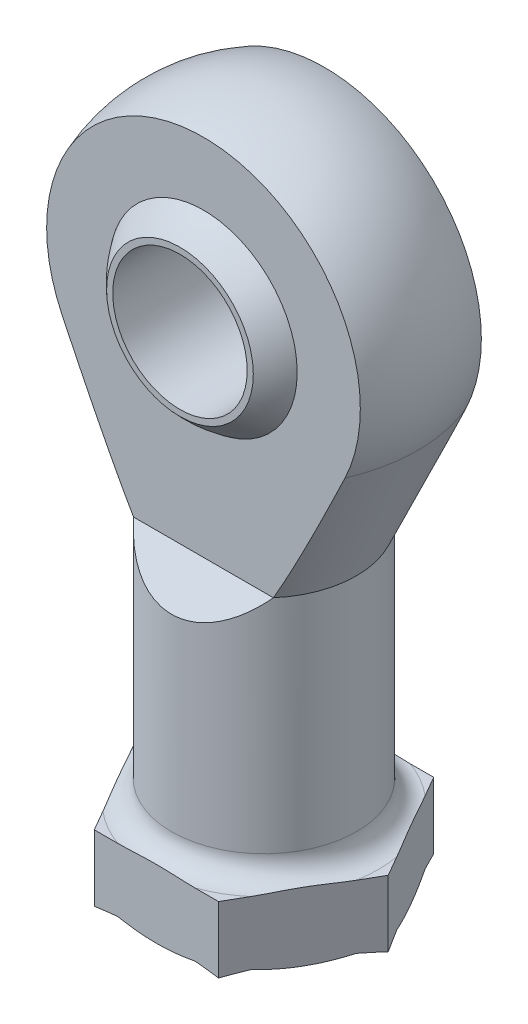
ISO-10303-21;
HEADER;
FILE_DESCRIPTION(('STEP AP214'),'2;1');
FILE_NAME('part.step','',(''),(''),'','','');
FILE_SCHEMA(('AUTOMOTIVE_DESIGN { 1 0 10303 214 1 1 1 1 }'));
ENDSEC;
DATA;
#1=APPLICATION_CONTEXT('core data for automotive mechanical design processes');
#2=APPLICATION_PROTOCOL_DEFINITION('international standard','automotive_design',2000,#1);
#3=PRODUCT_CONTEXT('',#1,'mechanical');
#4=PRODUCT('Part','Part','',(#3));
#5=PRODUCT_RELATED_PRODUCT_CATEGORY('part','',(#4));
#6=PRODUCT_DEFINITION_FORMATION('','',#4);
#7=PRODUCT_DEFINITION_CONTEXT('part definition',#1,'design');
#8=PRODUCT_DEFINITION('design','',#6,#7);
#9=PRODUCT_DEFINITION_SHAPE('','',#8);
#10=(LENGTH_UNIT() NAMED_UNIT(*) SI_UNIT(.MILLI.,.METRE.));
#11=(NAMED_UNIT(*) PLANE_ANGLE_UNIT() SI_UNIT($,.RADIAN.));
#12=(NAMED_UNIT(*) SI_UNIT($,.STERADIAN.) SOLID_ANGLE_UNIT());
#13=UNCERTAINTY_MEASURE_WITH_UNIT(LENGTH_MEASURE(1.E-05),#10,'distance_accuracy_value','');
#14=(GEOMETRIC_REPRESENTATION_CONTEXT(3) GLOBAL_UNCERTAINTY_ASSIGNED_CONTEXT((#13)) GLOBAL_UNIT_ASSIGNED_CONTEXT((#10,
#11,#12)) REPRESENTATION_CONTEXT('',''));
#15=CARTESIAN_POINT('',(0.,0.,0.));
#16=DIRECTION('',(0.,0.,1.));
#17=DIRECTION('',(1.,0.,0.));
#18=AXIS2_PLACEMENT_3D('',#15,#16,#17);
#19=CARTESIAN_POINT('',(0.,-35.75,0.));
#20=DIRECTION('',(0.,-1.,0.));
#21=DIRECTION('',(0.,0.,-1.));
#22=AXIS2_PLACEMENT_3D('',#19,#20,#21);
#23=CONICAL_SURFACE('',#22,7.5,1.0471975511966);
#24=CARTESIAN_POINT('',(0.,-32.8632486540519,0.));
#25=DIRECTION('',(0.,-1.,0.));
#26=DIRECTION('',(0.,0.,1.));
#27=AXIS2_PLACEMENT_3D('',#24,#25,#26);
#28=CIRCLE('',#27,2.5);
#29=CARTESIAN_POINT('',(0.,-32.8632486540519,-2.49999999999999));
#30=VERTEX_POINT('',#29);
#31=EDGE_CURVE('P0_E784',#30,#30,#28,.T.);
#32=CARTESIAN_POINT('',(0.,-35.75,0.));
#33=DIRECTION('',(0.,-1.,0.));
#34=DIRECTION('',(0.,0.,1.));
#35=AXIS2_PLACEMENT_3D('',#32,#33,#34);
#36=CIRCLE('',#35,7.5);
#37=CARTESIAN_POINT('',(0.,-35.75,-7.49999999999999));
#38=VERTEX_POINT('',#37);
#39=EDGE_CURVE('P0_E781',#38,#38,#36,.F.);
#40=CARTESIAN_POINT('',(0.,-32.8632486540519,-2.49999999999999));
#41=CARTESIAN_POINT('',(0.,-32.8933189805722,-2.55208333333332));
#42=CARTESIAN_POINT('',(0.,-32.9233893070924,-2.60416666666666));
#43=CARTESIAN_POINT('',(0.,-32.983529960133,-2.70833333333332));
#44=CARTESIAN_POINT('',(0.,-33.0136002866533,-2.76041666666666));
#45=CARTESIAN_POINT('',(0.,-33.0737409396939,-2.86458333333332));
#46=CARTESIAN_POINT('',(0.,-33.1038112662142,-2.91666666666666));
#47=CARTESIAN_POINT('',(0.,-33.1639519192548,-3.02083333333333));
#48=CARTESIAN_POINT('',(0.,-33.1940222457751,-3.07291666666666));
#49=CARTESIAN_POINT('',(0.,-33.2541628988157,-3.17708333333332));
#50=CARTESIAN_POINT('',(0.,-33.284233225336,-3.22916666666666));
#51=CARTESIAN_POINT('',(0.,-33.3443738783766,-3.33333333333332));
#52=CARTESIAN_POINT('',(0.,-33.3744442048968,-3.38541666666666));
#53=CARTESIAN_POINT('',(0.,-33.4345848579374,-3.48958333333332));
#54=CARTESIAN_POINT('',(0.,-33.4646551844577,-3.54166666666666));
#55=CARTESIAN_POINT('',(0.,-33.5247958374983,-3.64583333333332));
#56=CARTESIAN_POINT('',(0.,-33.5548661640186,-3.69791666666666));
#57=CARTESIAN_POINT('',(0.,-33.6150068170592,-3.80208333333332));
#58=CARTESIAN_POINT('',(0.,-33.6450771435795,-3.85416666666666));
#59=CARTESIAN_POINT('',(0.,-33.7052177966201,-3.95833333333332));
#60=CARTESIAN_POINT('',(0.,-33.7352881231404,-4.01041666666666));
#61=CARTESIAN_POINT('',(0.,-33.795428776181,-4.11458333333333));
#62=CARTESIAN_POINT('',(0.,-33.8254991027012,-4.16666666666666));
#63=CARTESIAN_POINT('',(0.,-33.8856397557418,-4.27083333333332));
#64=CARTESIAN_POINT('',(0.,-33.9157100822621,-4.32291666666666));
#65=CARTESIAN_POINT('',(0.,-33.9758507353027,-4.42708333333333));
#66=CARTESIAN_POINT('',(0.,-34.005921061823,-4.47916666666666));
#67=CARTESIAN_POINT('',(0.,-34.0660617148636,-4.58333333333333));
#68=CARTESIAN_POINT('',(0.,-34.0961320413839,-4.63541666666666));
#69=CARTESIAN_POINT('',(0.,-34.1562726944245,-4.73958333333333));
#70=CARTESIAN_POINT('',(0.,-34.1863430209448,-4.79166666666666));
#71=CARTESIAN_POINT('',(0.,-34.2464836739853,-4.89583333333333));
#72=CARTESIAN_POINT('',(0.,-34.2765540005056,-4.94791666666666));
#73=CARTESIAN_POINT('',(0.,-34.3366946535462,-5.05208333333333));
#74=CARTESIAN_POINT('',(0.,-34.3667649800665,-5.10416666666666));
#75=CARTESIAN_POINT('',(0.,-34.4269056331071,-5.20833333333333));
#76=CARTESIAN_POINT('',(0.,-34.4569759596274,-5.26041666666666));
#77=CARTESIAN_POINT('',(0.,-34.517116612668,-5.36458333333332));
#78=CARTESIAN_POINT('',(0.,-34.5471869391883,-5.41666666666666));
#79=CARTESIAN_POINT('',(0.,-34.6073275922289,-5.52083333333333));
#80=CARTESIAN_POINT('',(0.,-34.6373979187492,-5.57291666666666));
#81=CARTESIAN_POINT('',(0.,-34.6975385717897,-5.67708333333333));
#82=CARTESIAN_POINT('',(0.,-34.72760889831,-5.72916666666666));
#83=CARTESIAN_POINT('',(0.,-34.7877495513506,-5.83333333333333));
#84=CARTESIAN_POINT('',(0.,-34.8178198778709,-5.88541666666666));
#85=CARTESIAN_POINT('',(0.,-34.8779605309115,-5.98958333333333));
#86=CARTESIAN_POINT('',(0.,-34.9080308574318,-6.04166666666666));
#87=CARTESIAN_POINT('',(0.,-34.9681715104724,-6.14583333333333));
#88=CARTESIAN_POINT('',(0.,-34.9982418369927,-6.19791666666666));
#89=CARTESIAN_POINT('',(0.,-35.0583824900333,-6.30208333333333));
#90=CARTESIAN_POINT('',(0.,-35.0884528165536,-6.35416666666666));
#91=CARTESIAN_POINT('',(0.,-35.1485934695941,-6.45833333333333));
#92=CARTESIAN_POINT('',(0.,-35.1786637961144,-6.51041666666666));
#93=CARTESIAN_POINT('',(0.,-35.238804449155,-6.61458333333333));
#94=CARTESIAN_POINT('',(0.,-35.2688747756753,-6.66666666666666));
#95=CARTESIAN_POINT('',(0.,-35.3290154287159,-6.77083333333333));
#96=CARTESIAN_POINT('',(0.,-35.3590857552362,-6.82291666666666));
#97=CARTESIAN_POINT('',(0.,-35.4192264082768,-6.92708333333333));
#98=CARTESIAN_POINT('',(0.,-35.4492967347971,-6.97916666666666));
#99=CARTESIAN_POINT('',(0.,-35.5094373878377,-7.08333333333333));
#100=CARTESIAN_POINT('',(0.,-35.539507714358,-7.13541666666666));
#101=CARTESIAN_POINT('',(0.,-35.5996483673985,-7.23958333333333));
#102=CARTESIAN_POINT('',(0.,-35.6297186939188,-7.29166666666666));
#103=CARTESIAN_POINT('',(0.,-35.6898593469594,-7.39583333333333));
#104=CARTESIAN_POINT('',(0.,-35.7199296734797,-7.44791666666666));
#105=CARTESIAN_POINT('',(0.,-35.75,-7.49999999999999));
#106=B_SPLINE_CURVE_WITH_KNOTS('',3,(#40,#41,#42,#43,#44,#45,#46,#47,#48,#49,#50,#51,#52,#53,
#54,#55,#56,#57,#58,#59,#60,#61,#62,#63,#64,#65,#66,#67,#68,#69,#70,#71,#72,#73,#74,#75,#76,#77,
#78,#79,#80,#81,#82,#83,#84,#85,#86,#87,#88,#89,#90,#91,#92,#93,#94,#95,#96,#97,#98,#99,#100,
#101,#102,#103,#104,#105),.UNSPECIFIED.,.F.,.F.,(4,2,2,2,2,2,2,2,2,2,2,2,2,2,2,2,2,2,2,2,2,2,2,
2,2,2,2,2,2,2,2,2,4),(0.,0.180421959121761,0.360843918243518,0.541265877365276,
0.721687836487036,0.902109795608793,1.08253175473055,1.26295371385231,1.44337567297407,
1.62379763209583,1.80421959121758,1.98464155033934,2.1650635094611,2.34548546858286,
2.52590742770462,2.70632938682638,2.88675134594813,3.06717330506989,3.24759526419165,
3.42801722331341,3.60843918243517,3.78886114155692,3.96928310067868,4.14970505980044,
4.3301270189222,4.51054897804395,4.69097093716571,4.87139289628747,5.05181485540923,
5.23223681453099,5.41265877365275,5.5930807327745,5.77350269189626),.UNSPECIFIED.);
#107=EDGE_CURVE('P0_BSEAM16',#30,#38,#106,.T.);
#108=ORIENTED_EDGE('',*,*,#31,.F.);
#109=ORIENTED_EDGE('',*,*,#39,.F.);
#110=ORIENTED_EDGE('',*,*,#107,.T.);
#111=ORIENTED_EDGE('',*,*,#107,.F.);
#112=EDGE_LOOP('',(#108,#110,#109,#111));
#113=FACE_BOUND('',#112,.T.);
#114=ADVANCED_FACE('P0_F16',(#113),#23,.F.);
#115=CARTESIAN_POINT('',(0.,-35.75,0.));
#116=DIRECTION('',(0.,-1.,0.));
#117=DIRECTION('',(0.,0.,-1.));
#118=AXIS2_PLACEMENT_3D('',#115,#116,#117);
#119=CYLINDRICAL_SURFACE('',#118,7.5);
#120=CARTESIAN_POINT('',(0.,-77.,0.));
#121=DIRECTION('',(0.,-1.,0.));
#122=DIRECTION('',(0.,0.,-1.));
#123=AXIS2_PLACEMENT_3D('',#120,#121,#122);
#124=CIRCLE('',#123,7.5);
#125=CARTESIAN_POINT('',(0.,-77.,-7.5));
#126=VERTEX_POINT('',#125);
#127=EDGE_CURVE('P0_E153',#126,#126,#124,.F.);
#128=ORIENTED_EDGE('',*,*,#127,.F.);
#129=EDGE_LOOP('',(#128));
#130=FACE_BOUND('',#129,.T.);
#131=ORIENTED_EDGE('',*,*,#39,.T.);
#132=EDGE_LOOP('',(#131));
#133=FACE_BOUND('',#132,.T.);
#134=ADVANCED_FACE('P0_F975',(#130,#133),#119,.F.);
#135=CARTESIAN_POINT('',(0.,-16.3999196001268,0.));
#136=DIRECTION('',(0.,-1.,0.));
#137=DIRECTION('',(1.,0.,0.));
#138=AXIS2_PLACEMENT_3D('',#135,#136,#137);
#139=CYLINDRICAL_SURFACE('',#138,2.5);
#140=CARTESIAN_POINT('',(0.,-16.3999196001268,0.));
#141=DIRECTION('',(0.,-1.,0.));
#142=DIRECTION('',(1.,0.,0.));
#143=AXIS2_PLACEMENT_3D('',#140,#141,#142);
#144=CIRCLE('',#143,2.5);
#145=CARTESIAN_POINT('',(2.5,-16.3999196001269,0.));
#146=VERTEX_POINT('',#145);
#147=EDGE_CURVE('P0_E166',#146,#146,#144,.T.);
#148=ORIENTED_EDGE('',*,*,#147,.F.);
#149=EDGE_LOOP('',(#148));
#150=FACE_BOUND('',#149,.T.);
#151=ORIENTED_EDGE('',*,*,#31,.T.);
#152=EDGE_LOOP('',(#151));
#153=FACE_BOUND('',#152,.T.);
#154=ADVANCED_FACE('P0_F203',(#150,#153),#139,.F.);
#155=CARTESIAN_POINT('',(0.,-77.,0.));
#156=DIRECTION('',(0.,1.,0.));
#157=DIRECTION('',(-1.,0.,0.));
#158=AXIS2_PLACEMENT_3D('',#155,#156,#157);
#159=CONICAL_SURFACE('',#158,16.,1.0471975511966);
#160=CARTESIAN_POINT('',(16.7286881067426,-76.4226496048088,-3.02506225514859));
#161=CARTESIAN_POINT('',(16.6103252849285,-76.4688351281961,-3.23007267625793));
#162=CARTESIAN_POINT('',(16.4917259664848,-76.5125808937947,-3.43549272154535));
#163=CARTESIAN_POINT('',(16.2540745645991,-76.5949238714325,-3.84711702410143));
#164=CARTESIAN_POINT('',(16.1350224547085,-76.6335207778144,-4.05332132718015));
#165=CARTESIAN_POINT('',(15.7778207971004,-76.741001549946,-4.67201274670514));
#166=CARTESIAN_POINT('',(15.5390476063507,-76.8018036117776,-5.08558004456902));
#167=CARTESIAN_POINT('',(15.0602313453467,-76.8999597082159,-5.91491413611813));
#168=CARTESIAN_POINT('',(14.8201880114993,-76.9373086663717,-6.33068138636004));
#169=CARTESIAN_POINT('',(14.4593754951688,-76.97483627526,-6.95562699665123));
#170=CARTESIAN_POINT('',(14.3388337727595,-76.98426300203,-7.164411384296));
#171=CARTESIAN_POINT('',(14.0976653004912,-76.9968484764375,-7.58212743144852));
#172=CARTESIAN_POINT('',(13.9770385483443,-77.0000070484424,-7.79105909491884));
#173=CARTESIAN_POINT('',(13.856406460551,-77.,-8.));
#174=B_SPLINE_CURVE_WITH_KNOTS('',3,(#160,#161,#162,#163,#164,#165,#166,#167,#168,#169,#170,
#171,#172,#173),.UNSPECIFIED.,.F.,.F.,(4,2,2,2,2,2,4),(0.,0.723545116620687,1.44713316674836,
2.89077571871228,4.33473064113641,5.05846151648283,5.78221267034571),.UNSPECIFIED.);
#175=CARTESIAN_POINT('',(16.7286879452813,-76.4226496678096,-3.02506253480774));
#176=VERTEX_POINT('',#175);
#177=CARTESIAN_POINT('',(13.856406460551,-77.,-7.99999999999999));
#178=VERTEX_POINT('',#177);
#179=EDGE_CURVE('P0_E147',#176,#178,#174,.T.);
#180=ORIENTED_EDGE('',*,*,#179,.F.);
#181=CARTESIAN_POINT('',(0.,-76.4226497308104,0.));
#182=DIRECTION('',(0.,1.,0.));
#183=DIRECTION('',(0.,0.,1.));
#184=AXIS2_PLACEMENT_3D('',#181,#182,#183);
#185=CIRCLE('',#184,17.);
#186=CARTESIAN_POINT('',(16.7286875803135,-76.4226496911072,3.02506316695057));
#187=VERTEX_POINT('',#186);
#188=EDGE_CURVE('P0_E154',#187,#176,#185,.T.);
#189=ORIENTED_EDGE('',*,*,#188,.F.);
#190=CARTESIAN_POINT('',(13.856406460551,-77.,7.99999999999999));
#191=CARTESIAN_POINT('',(13.9770385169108,-77.000007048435,7.79105914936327));
#192=CARTESIAN_POINT('',(14.0976652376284,-76.9968484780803,7.58212754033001));
#193=CARTESIAN_POINT('',(14.3388336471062,-76.9842630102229,7.16441160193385));
#194=CARTESIAN_POINT('',(14.4593753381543,-76.9748362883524,6.9556272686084));
#195=CARTESIAN_POINT('',(14.8201877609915,-76.93730869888,6.33068182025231));
#196=CARTESIAN_POINT('',(15.0602310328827,-76.8999597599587,5.91491467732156));
#197=CARTESIAN_POINT('',(15.5390471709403,-76.8018037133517,5.08558079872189));
#198=CARTESIAN_POINT('',(15.7778203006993,-76.7410016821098,4.67201360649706));
#199=CARTESIAN_POINT('',(16.1350218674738,-76.633520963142,4.05332234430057));
#200=CARTESIAN_POINT('',(16.2540739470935,-76.594924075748,3.84711809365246));
#201=CARTESIAN_POINT('',(16.4917252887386,-76.5125811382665,3.43549389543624));
#202=CARTESIAN_POINT('',(16.6103245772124,-76.4688353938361,3.23007390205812));
#203=CARTESIAN_POINT('',(16.7286873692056,-76.4226498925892,3.02506353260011));
#204=B_SPLINE_CURVE_WITH_KNOTS('',3,(#190,#191,#192,#193,#194,#195,#196,#197,#198,#199,#200,
#201,#202,#203),.UNSPECIFIED.,.F.,.F.,(4,2,2,2,2,2,4),(0.,0.723750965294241,1.44748165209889,
2.89143619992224,4.33507837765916,5.05866623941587,5.78221116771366),.UNSPECIFIED.);
#205=CARTESIAN_POINT('',(13.856406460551,-77.,7.99999999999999));
#206=VERTEX_POINT('',#205);
#207=EDGE_CURVE('P0_E150',#206,#187,#204,.T.);
#208=ORIENTED_EDGE('',*,*,#207,.F.);
#209=CARTESIAN_POINT('',(0.,-77.,0.));
#210=DIRECTION('',(0.,1.,0.));
#211=DIRECTION('',(-1.,0.,0.));
#212=AXIS2_PLACEMENT_3D('',#209,#210,#211);
#213=CIRCLE('',#212,16.);
#214=EDGE_CURVE('P0_E143',#178,#206,#213,.F.);
#215=ORIENTED_EDGE('',*,*,#214,.F.);
#216=EDGE_LOOP('',(#180,#189,#208,#215));
#217=FACE_BOUND('',#216,.T.);
#218=ADVANCED_FACE('P0_F145',(#217),#159,.T.);
#219=CARTESIAN_POINT('',(0.,-76.8510609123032,0.));
#220=DIRECTION('',(0.,-1.,0.));
#221=DIRECTION('',(0.,0.,-1.));
#222=AXIS2_PLACEMENT_3D('',#219,#220,#221);
#223=CONICAL_SURFACE('',#222,18.4840598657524,1.28976142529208);
#224=ORIENTED_EDGE('',*,*,#188,.T.);
#225=CARTESIAN_POINT('',(18.475208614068,-76.8485057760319,0.));
#226=CARTESIAN_POINT('',(18.3300707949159,-76.8066088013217,-0.251386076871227));
#227=CARTESIAN_POINT('',(18.1848271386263,-76.7661609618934,-0.502955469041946));
#228=CARTESIAN_POINT('',(17.8941501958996,-76.6883978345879,-1.00642270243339));
#229=CARTESIAN_POINT('',(17.7487169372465,-76.6510821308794,-1.25832049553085));
#230=CARTESIAN_POINT('',(17.4576419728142,-76.5798057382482,-1.76247712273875));
#231=CARTESIAN_POINT('',(17.3120002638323,-76.5458451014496,-2.01473596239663));
#232=CARTESIAN_POINT('',(17.0204999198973,-76.4815036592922,-2.51962936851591));
#233=CARTESIAN_POINT('',(16.8746412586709,-76.4511233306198,-2.77226398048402));
#234=CARTESIAN_POINT('',(16.7286881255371,-76.4226497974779,-3.02506222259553));
#235=B_SPLINE_CURVE_WITH_KNOTS('',3,(#225,#226,#227,#228,#229,#230,#231,#232,#233,#234),
.UNSPECIFIED.,.F.,.F.,(4,2,2,2,4),(0.,0.879850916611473,1.75958483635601,2.63933242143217,
3.5191970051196),.UNSPECIFIED.);
#236=CARTESIAN_POINT('',(18.475208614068,-76.8485057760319,0.));
#237=VERTEX_POINT('',#236);
#238=EDGE_CURVE('P0_E179',#237,#176,#235,.T.);
#239=ORIENTED_EDGE('',*,*,#238,.F.);
#240=CARTESIAN_POINT('',(16.728687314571,-76.4226497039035,3.02506348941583));
#241=CARTESIAN_POINT('',(16.8746405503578,-76.4511232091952,2.77226515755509));
#242=CARTESIAN_POINT('',(17.0204992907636,-76.4815035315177,2.51963044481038));
#243=CARTESIAN_POINT('',(17.3119997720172,-76.5458449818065,2.01473682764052));
#244=CARTESIAN_POINT('',(17.4576415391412,-76.5798056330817,1.76247787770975));
#245=CARTESIAN_POINT('',(17.7487166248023,-76.6510820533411,1.25832103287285));
#246=CARTESIAN_POINT('',(17.8941499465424,-76.6883977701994,1.00642313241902));
#247=CARTESIAN_POINT('',(18.1848270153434,-76.7661609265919,0.502955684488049));
#248=CARTESIAN_POINT('',(18.3300707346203,-76.806608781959,0.251386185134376));
#249=CARTESIAN_POINT('',(18.475208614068,-76.8485057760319,0.));
#250=B_SPLINE_CURVE_WITH_KNOTS('',3,(#240,#241,#242,#243,#244,#245,#246,#247,#248,#249),
.UNSPECIFIED.,.F.,.F.,(4,2,2,2,4),(0.,0.879864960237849,1.75961292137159,2.63934721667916,
3.51919850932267),.UNSPECIFIED.);
#251=EDGE_CURVE('P0_E214',#187,#237,#250,.T.);
#252=ORIENTED_EDGE('',*,*,#251,.F.);
#253=EDGE_LOOP('',(#224,#239,#252));
#254=FACE_BOUND('',#253,.T.);
#255=ADVANCED_FACE('P0_F202',(#254),#223,.F.);
#256=CARTESIAN_POINT('',(16.1920033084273,-77.,-16.));
#257=DIRECTION('',(0.,-1.,0.));
#258=DIRECTION('',(0.,0.,1.));
#259=AXIS2_PLACEMENT_3D('',#256,#257,#258);
#260=PLANE('',#259);
#261=ORIENTED_EDGE('',*,*,#127,.T.);
#262=EDGE_LOOP('',(#261));
#263=FACE_BOUND('',#262,.T.);
#264=ORIENTED_EDGE('',*,*,#214,.T.);
#265=CARTESIAN_POINT('',(0.,-77.,0.));
#266=DIRECTION('',(0.,1.,0.));
#267=DIRECTION('',(0.,0.,1.));
#268=AXIS2_PLACEMENT_3D('',#265,#266,#267);
#269=CIRCLE('',#268,16.);
#270=CARTESIAN_POINT('',(0.,-77.,16.));
#271=VERTEX_POINT('',#270);
#272=EDGE_CURVE('P0_E258',#271,#206,#269,.T.);
#273=ORIENTED_EDGE('',*,*,#272,.F.);
#274=CARTESIAN_POINT('',(0.,-77.,0.));
#275=DIRECTION('',(0.,1.,0.));
#276=DIRECTION('',(0.,0.,1.));
#277=AXIS2_PLACEMENT_3D('',#274,#275,#276);
#278=CIRCLE('',#277,16.);
#279=CARTESIAN_POINT('',(-13.856406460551,-77.,7.99999999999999));
#280=VERTEX_POINT('',#279);
#281=EDGE_CURVE('P0_E616',#280,#271,#278,.T.);
#282=ORIENTED_EDGE('',*,*,#281,.F.);
#283=CARTESIAN_POINT('',(0.,-77.,0.));
#284=DIRECTION('',(0.,1.,0.));
#285=DIRECTION('',(-1.,0.,0.));
#286=AXIS2_PLACEMENT_3D('',#283,#284,#285);
#287=CIRCLE('',#286,16.);
#288=CARTESIAN_POINT('',(-13.856406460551,-77.,-7.99999999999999));
#289=VERTEX_POINT('',#288);
#290=EDGE_CURVE('P0_E654',#289,#280,#287,.T.);
#291=ORIENTED_EDGE('',*,*,#290,.F.);
#292=CARTESIAN_POINT('',(0.,-77.,0.));
#293=DIRECTION('',(0.,1.,0.));
#294=DIRECTION('',(0.,0.,1.));
#295=AXIS2_PLACEMENT_3D('',#292,#293,#294);
#296=CIRCLE('',#295,16.);
#297=CARTESIAN_POINT('',(0.,-77.,-16.));
#298=VERTEX_POINT('',#297);
#299=EDGE_CURVE('P0_E161',#298,#289,#296,.T.);
#300=ORIENTED_EDGE('',*,*,#299,.F.);
#301=CARTESIAN_POINT('',(0.,-77.,0.));
#302=DIRECTION('',(0.,1.,0.));
#303=DIRECTION('',(0.,0.,1.));
#304=AXIS2_PLACEMENT_3D('',#301,#302,#303);
#305=CIRCLE('',#304,16.);
#306=EDGE_CURVE('P0_E157',#178,#298,#305,.T.);
#307=ORIENTED_EDGE('',*,*,#306,.F.);
#308=EDGE_LOOP('',(#264,#273,#282,#291,#300,#307));
#309=FACE_BOUND('',#308,.T.);
#310=ADVANCED_FACE('P0_F159',(#263,#309),#260,.T.);
#311=CARTESIAN_POINT('',(0.,0.,0.));
#312=DIRECTION('',(0.,0.,1.));
#313=DIRECTION('',(-1.,0.,0.));
#314=AXIS2_PLACEMENT_3D('',#311,#312,#313);
#315=SPHERICAL_SURFACE('',#314,16.589375);
#316=CARTESIAN_POINT('',(0.,0.,-9.));
#317=DIRECTION('',(0.,0.,1.));
#318=DIRECTION('',(1.,0.,0.));
#319=AXIS2_PLACEMENT_3D('',#316,#317,#318);
#320=CIRCLE('',#319,13.9358301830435);
#321=CARTESIAN_POINT('',(13.9358301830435,0.,-9.));
#322=VERTEX_POINT('',#321);
#323=EDGE_CURVE('P0_E593',#322,#322,#320,.T.);
#324=ORIENTED_EDGE('',*,*,#323,.F.);
#325=EDGE_LOOP('',(#324));
#326=FACE_BOUND('',#325,.T.);
#327=CARTESIAN_POINT('',(0.,0.,9.));
#328=DIRECTION('',(0.,0.,1.));
#329=DIRECTION('',(1.,0.,0.));
#330=AXIS2_PLACEMENT_3D('',#327,#328,#329);
#331=CIRCLE('',#330,13.9358301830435);
#332=CARTESIAN_POINT('',(13.9358301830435,0.,9.));
#333=VERTEX_POINT('',#332);
#334=EDGE_CURVE('P0_E259',#333,#333,#331,.F.);
#335=ORIENTED_EDGE('',*,*,#334,.F.);
#336=EDGE_LOOP('',(#335));
#337=FACE_BOUND('',#336,.T.);
#338=ORIENTED_EDGE('',*,*,#147,.T.);
#339=EDGE_LOOP('',(#338));
#340=FACE_BOUND('',#339,.T.);
#341=ADVANCED_FACE('P0_F799',(#326,#337,#340),#315,.F.);
#342=CARTESIAN_POINT('',(18.4856877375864,-67.,3.0250628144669));
#343=DIRECTION('',(0.,1.,0.));
#344=DIRECTION('',(0.,0.,-1.));
#345=AXIS2_PLACEMENT_3D('',#342,#343,#344);
#346=PLANE('',#345);
#347=DIRECTION('',(0.499999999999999,0.,0.866025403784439));
#348=VECTOR('',#347,1.);
#349=CARTESIAN_POINT('',(13.856406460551,-67.,-8.));
#350=LINE('',#349,#348);
#351=CARTESIAN_POINT('',(16.72868778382,-67.,-3.0250628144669));
#352=VERTEX_POINT('',#351);
#353=CARTESIAN_POINT('',(18.475208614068,-67.,0.));
#354=VERTEX_POINT('',#353);
#355=EDGE_CURVE('P0_E662',#352,#354,#350,.T.);
#356=ORIENTED_EDGE('',*,*,#355,.F.);
#357=CARTESIAN_POINT('',(0.,-67.,0.));
#358=DIRECTION('',(0.,1.,0.));
#359=DIRECTION('',(0.984040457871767,0.,0.177944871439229));
#360=AXIS2_PLACEMENT_3D('',#357,#358,#359);
#361=CIRCLE('',#360,17.);
#362=CARTESIAN_POINT('',(16.72868778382,-67.,3.0250628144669));
#363=VERTEX_POINT('',#362);
#364=EDGE_CURVE('P0_E747',#363,#352,#361,.T.);
#365=ORIENTED_EDGE('',*,*,#364,.F.);
#366=DIRECTION('',(-0.5,0.,0.866025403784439));
#367=VECTOR('',#366,1.);
#368=CARTESIAN_POINT('',(13.856406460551,-67.,8.));
#369=LINE('',#368,#367);
#370=EDGE_CURVE('P0_E793',#354,#363,#369,.T.);
#371=ORIENTED_EDGE('',*,*,#370,.F.);
#372=EDGE_LOOP('',(#356,#365,#371));
#373=FACE_BOUND('',#372,.T.);
#374=ADVANCED_FACE('P0_F708',(#373),#346,.T.);
#375=CARTESIAN_POINT('',(0.,-76.8510609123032,0.));
#376=DIRECTION('',(0.,-1.,0.));
#377=DIRECTION('',(0.,0.,-1.));
#378=AXIS2_PLACEMENT_3D('',#375,#376,#377);
#379=CONICAL_SURFACE('',#378,18.4840598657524,1.28976142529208);
#380=CARTESIAN_POINT('',(0.,-76.4226497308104,0.));
#381=DIRECTION('',(0.,-1.,0.));
#382=DIRECTION('',(0.,0.,1.));
#383=AXIS2_PLACEMENT_3D('',#380,#381,#382);
#384=CIRCLE('',#383,17.);
#385=CARTESIAN_POINT('',(5.74456288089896,-76.4226496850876,-16.));
#386=VERTEX_POINT('',#385);
#387=CARTESIAN_POINT('',(10.9841252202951,-76.4226497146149,-12.9749370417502));
#388=VERTEX_POINT('',#387);
#389=EDGE_CURVE('P0_E165',#386,#388,#384,.T.);
#390=ORIENTED_EDGE('',*,*,#389,.F.);
#391=CARTESIAN_POINT('',(9.23760430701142,-76.8485057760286,-16.));
#392=CARTESIAN_POINT('',(8.94732865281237,-76.8066087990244,-16.));
#393=CARTESIAN_POINT('',(8.65684132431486,-76.7661609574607,-16.));
#394=CARTESIAN_POINT('',(8.07548740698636,-76.6883978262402,-16.));
#395=CARTESIAN_POINT('',(7.78462087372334,-76.651082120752,-16.));
#396=CARTESIAN_POINT('',(7.2024709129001,-76.5798057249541,-16.));
#397=CARTESIAN_POINT('',(6.91118747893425,-76.5458450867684,-16.));
#398=CARTESIAN_POINT('',(6.32818675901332,-76.4815036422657,-16.));
#399=CARTESIAN_POINT('',(6.0364694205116,-76.4511233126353,-16.));
#400=CARTESIAN_POINT('',(5.74456313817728,-76.4226497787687,-16.));
#401=B_SPLINE_CURVE_WITH_KNOTS('',3,(#391,#392,#393,#394,#395,#396,#397,#398,#399,#400),
.UNSPECIFIED.,.F.,.F.,(4,2,2,2,4),(0.,0.879850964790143,1.75958493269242,2.6393325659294,
3.51919719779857),.UNSPECIFIED.);
#402=CARTESIAN_POINT('',(9.23760430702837,-76.8485057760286,-15.9999999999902));
#403=VERTEX_POINT('',#402);
#404=EDGE_CURVE('P0_E713',#403,#386,#401,.T.);
#405=ORIENTED_EDGE('',*,*,#404,.F.);
#406=CARTESIAN_POINT('',(10.9841252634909,-76.4226497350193,-12.9749368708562));
#407=CARTESIAN_POINT('',(10.8381721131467,-76.4511232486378,-13.2277352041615));
#408=CARTESIAN_POINT('',(10.6923134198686,-76.4815035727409,-13.4803698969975));
#409=CARTESIAN_POINT('',(10.4008129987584,-76.5458450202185,-13.985263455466));
#410=CARTESIAN_POINT('',(10.2551712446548,-76.5798056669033,-14.2375223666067));
#411=CARTESIAN_POINT('',(9.96409619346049,-76.6510820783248,-14.7416791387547));
#412=CARTESIAN_POINT('',(9.81866289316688,-76.6883977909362,-14.9935770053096));
#413=CARTESIAN_POINT('',(9.52798586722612,-76.7661609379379,-15.4970443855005));
#414=CARTESIAN_POINT('',(9.38274216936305,-76.8066087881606,-15.748613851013));
#415=CARTESIAN_POINT('',(9.23760430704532,-76.8485057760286,-15.9999999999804));
#416=B_SPLINE_CURVE_WITH_KNOTS('',3,(#406,#407,#408,#409,#410,#411,#412,#413,#414,#415),
.UNSPECIFIED.,.F.,.F.,(4,2,2,2,4),(0.,0.87986483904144,1.75961267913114,2.6393468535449,
3.51919802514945),.UNSPECIFIED.);
#417=EDGE_CURVE('P0_E174',#388,#403,#416,.T.);
#418=ORIENTED_EDGE('',*,*,#417,.F.);
#419=EDGE_LOOP('',(#390,#405,#418));
#420=FACE_BOUND('',#419,.T.);
#421=ADVANCED_FACE('P0_F703',(#420),#379,.F.);
#422=CARTESIAN_POINT('',(0.,-77.,0.));
#423=DIRECTION('',(0.,1.,0.));
#424=DIRECTION('',(0.,0.,1.));
#425=AXIS2_PLACEMENT_3D('',#422,#423,#424);
#426=CONICAL_SURFACE('',#425,16.,1.0471975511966);
#427=CARTESIAN_POINT('',(5.74456311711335,-76.422649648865,-16.0000000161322));
#428=CARTESIAN_POINT('',(5.50783747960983,-76.468835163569,-16.0000000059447));
#429=CARTESIAN_POINT('',(5.2706388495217,-76.5125809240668,-16.000000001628));
#430=CARTESIAN_POINT('',(4.79533605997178,-76.5949238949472,-15.9999999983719));
#431=CARTESIAN_POINT('',(4.557231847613,-76.6335207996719,-15.9999999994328));
#432=CARTESIAN_POINT('',(3.84282855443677,-76.7410015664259,-16.0000000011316));
#433=CARTESIAN_POINT('',(3.36528218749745,-76.8018036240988,-16.0000000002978));
#434=CARTESIAN_POINT('',(2.40764969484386,-76.8999597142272,-15.9999999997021));
#435=CARTESIAN_POINT('',(1.9275630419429,-76.9373086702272,-15.9999999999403));
#436=CARTESIAN_POINT('',(1.20593803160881,-76.9748362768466,-16.0000000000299));
#437=CARTESIAN_POINT('',(0.964854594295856,-76.984263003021,-16.000000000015));
#438=CARTESIAN_POINT('',(0.482517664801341,-76.9968484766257,-15.999999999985));
#439=CARTESIAN_POINT('',(0.241264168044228,-77.0000070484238,-15.9999999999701));
#440=CARTESIAN_POINT('',(0.,-77.,-16.));
#441=B_SPLINE_CURVE_WITH_KNOTS('',3,(#427,#428,#429,#430,#431,#432,#433,#434,#435,#436,#437,
#438,#439,#440),.UNSPECIFIED.,.F.,.F.,(4,2,2,2,2,2,4),(0.,0.723545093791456,1.44713312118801,
2.89077562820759,4.33473050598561,5.05846135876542,5.78221249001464),.UNSPECIFIED.);
#442=EDGE_CURVE('P0_E519',#386,#298,#441,.T.);
#443=ORIENTED_EDGE('',*,*,#442,.F.);
#444=ORIENTED_EDGE('',*,*,#389,.T.);
#445=CARTESIAN_POINT('',(13.856406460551,-77.,-8.));
#446=CARTESIAN_POINT('',(13.7357743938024,-77.0000070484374,-8.20894086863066));
#447=CARTESIAN_POINT('',(13.6151476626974,-76.9968484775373,-8.41787249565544));
#448=CARTESIAN_POINT('',(13.3739792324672,-76.9842630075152,-8.83558846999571));
#449=CARTESIAN_POINT('',(13.2534375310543,-76.9748362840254,-9.04437282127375));
#450=CARTESIAN_POINT('',(12.8926250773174,-76.937308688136,-9.66931832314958));
#451=CARTESIAN_POINT('',(12.6525817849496,-76.8999597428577,-10.0850855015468));
#452=CARTESIAN_POINT('',(12.1737656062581,-76.8018036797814,-10.9144194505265));
#453=CARTESIAN_POINT('',(11.9349924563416,-76.7410016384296,-11.3279866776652));
#454=CARTESIAN_POINT('',(11.5777908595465,-76.6335209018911,-11.9466779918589));
#455=CARTESIAN_POINT('',(11.4587387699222,-76.5949240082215,-12.1528822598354));
#456=CARTESIAN_POINT('',(11.2210874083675,-76.5125810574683,-12.5645064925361));
#457=CARTESIAN_POINT('',(11.1024881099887,-76.4688353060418,-12.7699265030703));
#458=CARTESIAN_POINT('',(10.9841253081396,-76.4226497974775,-12.9749368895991));
#459=B_SPLINE_CURVE_WITH_KNOTS('',3,(#445,#446,#447,#448,#449,#450,#451,#452,#453,#454,#455,
#456,#457,#458),.UNSPECIFIED.,.F.,.F.,(4,2,2,2,2,2,4),(0.,0.723751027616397,1.44748177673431,
2.89143644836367,4.33507874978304,5.05866667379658,5.7822116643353),.UNSPECIFIED.);
#460=EDGE_CURVE('P0_E169',#178,#388,#459,.T.);
#461=ORIENTED_EDGE('',*,*,#460,.F.);
#462=ORIENTED_EDGE('',*,*,#306,.T.);
#463=EDGE_LOOP('',(#443,#444,#461,#462));
#464=FACE_BOUND('',#463,.T.);
#465=ADVANCED_FACE('P0_F170',(#464),#426,.T.);
#466=CARTESIAN_POINT('',(11.0155620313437,-67.,-12.9749371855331));
#467=DIRECTION('',(0.,1.,0.));
#468=DIRECTION('',(0.,0.,-1.));
#469=AXIS2_PLACEMENT_3D('',#466,#467,#468);
#470=PLANE('',#469);
#471=DIRECTION('',(1.,0.,0.));
#472=VECTOR('',#471,1.);
#473=CARTESIAN_POINT('',(0.,-67.,-16.));
#474=LINE('',#473,#472);
#475=CARTESIAN_POINT('',(5.74456264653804,-67.,-16.));
#476=VERTEX_POINT('',#475);
#477=CARTESIAN_POINT('',(9.23760430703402,-67.,-16.));
#478=VERTEX_POINT('',#477);
#479=EDGE_CURVE('P0_E669',#476,#478,#474,.T.);
#480=ORIENTED_EDGE('',*,*,#479,.F.);
#481=CARTESIAN_POINT('',(0.,-67.,0.));
#482=DIRECTION('',(0.,1.,0.));
#483=DIRECTION('',(0.646125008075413,0.,-0.763231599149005));
#484=AXIS2_PLACEMENT_3D('',#481,#482,#483);
#485=CIRCLE('',#484,17.);
#486=CARTESIAN_POINT('',(10.984125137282,-67.,-12.9749371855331));
#487=VERTEX_POINT('',#486);
#488=EDGE_CURVE('P0_E687',#487,#476,#485,.T.);
#489=ORIENTED_EDGE('',*,*,#488,.F.);
#490=DIRECTION('',(0.499999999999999,0.,0.866025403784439));
#491=VECTOR('',#490,1.);
#492=CARTESIAN_POINT('',(13.856406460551,-67.,-8.));
#493=LINE('',#492,#491);
#494=EDGE_CURVE('P0_E722',#478,#487,#493,.T.);
#495=ORIENTED_EDGE('',*,*,#494,.F.);
#496=EDGE_LOOP('',(#480,#489,#495));
#497=FACE_BOUND('',#496,.T.);
#498=ADVANCED_FACE('P0_F551',(#497),#470,.T.);
#499=CARTESIAN_POINT('',(18.475208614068,-77.0609460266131,0.));
#500=DIRECTION('',(0.866025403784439,0.,-0.5));
#501=DIRECTION('',(-0.5,0.,-0.866025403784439));
#502=AXIS2_PLACEMENT_3D('',#499,#500,#501);
#503=PLANE('',#502);
#504=ORIENTED_EDGE('',*,*,#355,.T.);
#505=DIRECTION('',(0.,1.,0.));
#506=VECTOR('',#505,1.);
#507=CARTESIAN_POINT('',(18.475208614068,-77.,0.));
#508=LINE('',#507,#506);
#509=EDGE_CURVE('P0_E790',#237,#354,#508,.T.);
#510=ORIENTED_EDGE('',*,*,#509,.F.);
#511=ORIENTED_EDGE('',*,*,#238,.T.);
#512=ORIENTED_EDGE('',*,*,#179,.T.);
#513=ORIENTED_EDGE('',*,*,#460,.T.);
#514=ORIENTED_EDGE('',*,*,#417,.T.);
#515=DIRECTION('',(0.,1.,0.));
#516=VECTOR('',#515,1.);
#517=CARTESIAN_POINT('',(9.23760430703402,-77.,-16.));
#518=LINE('',#517,#516);
#519=EDGE_CURVE('P0_E672',#478,#403,#518,.F.);
#520=ORIENTED_EDGE('',*,*,#519,.F.);
#521=ORIENTED_EDGE('',*,*,#494,.T.);
#522=CARTESIAN_POINT('',(16.72868778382,-67.,-3.0250628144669));
#523=CARTESIAN_POINT('',(16.6383723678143,-66.9999902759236,-3.18149370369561));
#524=CARTESIAN_POINT('',(16.548063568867,-66.9982805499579,-3.33791313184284));
#525=CARTESIAN_POINT('',(16.3674769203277,-66.9922502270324,-3.65069838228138));
#526=CARTESIAN_POINT('',(16.2771990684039,-66.9879299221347,-3.80706420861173));
#527=CARTESIAN_POINT('',(16.0966195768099,-66.9774641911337,-4.11983706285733));
#528=CARTESIAN_POINT('',(16.0063179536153,-66.9713177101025,-4.27624406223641));
#529=CARTESIAN_POINT('',(15.8257329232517,-66.9579198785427,-4.58902650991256));
#530=CARTESIAN_POINT('',(15.7354495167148,-66.9506684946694,-4.74540195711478));
#531=CARTESIAN_POINT('',(15.4645535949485,-66.9282805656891,-5.21460745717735));
#532=CARTESIAN_POINT('',(15.2839548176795,-66.9125146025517,-5.52741371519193));
#533=CARTESIAN_POINT('',(14.922844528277,-66.8840196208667,-6.15287508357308));
#534=CARTESIAN_POINT('',(14.7423330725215,-66.8712880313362,-6.46553009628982));
#535=CARTESIAN_POINT('',(14.4715328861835,-66.8569357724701,-6.93456977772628));
#536=CARTESIAN_POINT('',(14.3812764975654,-66.8529428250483,-7.09089842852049));
#537=CARTESIAN_POINT('',(14.2007484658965,-66.8467762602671,-7.40358215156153));
#538=CARTESIAN_POINT('',(14.110476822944,-66.8446026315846,-7.55993722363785));
#539=CARTESIAN_POINT('',(13.9299488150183,-66.8422208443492,-7.87262090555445));
#540=CARTESIAN_POINT('',(13.839692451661,-66.8420122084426,-8.02894951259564));
#541=CARTESIAN_POINT('',(13.6591843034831,-66.8435705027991,-8.34159879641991));
#542=CARTESIAN_POINT('',(13.5689325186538,-66.8453374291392,-8.4979194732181));
#543=CARTESIAN_POINT('',(13.3747653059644,-66.8511446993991,-8.83422695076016));
#544=CARTESIAN_POINT('',(13.2708521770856,-66.8554890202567,-9.01420976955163));
#545=CARTESIAN_POINT('',(13.0630357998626,-66.8662798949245,-9.37415829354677));
#546=CARTESIAN_POINT('',(12.9591325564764,-66.8727268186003,-9.55412399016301));
#547=CARTESIAN_POINT('',(12.7513353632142,-66.8871570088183,-9.91403928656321));
#548=CARTESIAN_POINT('',(12.6474414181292,-66.895140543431,-10.0939888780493));
#549=CARTESIAN_POINT('',(12.4396592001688,-66.9119131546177,-10.453878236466));
#550=CARTESIAN_POINT('',(12.3357709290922,-66.9207023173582,-10.6338180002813));
#551=CARTESIAN_POINT('',(12.1279276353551,-66.9382240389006,-10.9938131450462));
#552=CARTESIAN_POINT('',(12.0239726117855,-66.9469565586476,-11.1738685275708));
#553=CARTESIAN_POINT('',(11.8160534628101,-66.9633756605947,-11.5339950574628));
#554=CARTESIAN_POINT('',(11.7120893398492,-66.9710623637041,-11.7140662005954));
#555=CARTESIAN_POINT('',(11.5041403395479,-66.9843175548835,-12.0742444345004));
#556=CARTESIAN_POINT('',(11.4001554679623,-66.9898863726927,-12.2543515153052));
#557=CARTESIAN_POINT('',(11.1921591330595,-66.9977189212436,-12.6146117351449));
#558=CARTESIAN_POINT('',(11.08814767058,-66.9999827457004,-12.7947648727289));
#559=CARTESIAN_POINT('',(10.984125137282,-67.,-12.9749371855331));
#560=B_SPLINE_CURVE_WITH_KNOTS('',3,(#522,#523,#524,#525,#526,#527,#528,#529,#530,#531,#532,
#533,#534,#535,#536,#537,#538,#539,#540,#541,#542,#543,#544,#545,#546,#547,#548,#549,#550,#551,
#552,#553,#554,#555,#556,#557,#558,#559),.UNSPECIFIED.,.F.,.F.,(4,2,2,2,2,2,2,2,2,2,2,2,2,2,2,2,
2,2,4),(0.,0.541865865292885,1.0836711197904,1.62578996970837,2.16792518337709,3.25255248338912,
4.33625750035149,4.87791994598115,5.41957902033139,5.96110650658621,6.50263291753,
7.12623457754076,7.74994599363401,8.37376631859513,8.99765344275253,9.62193274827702,
10.2461398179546,10.8702496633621,11.4943418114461),.UNSPECIFIED.);
#561=EDGE_CURVE('P0_E746',#352,#487,#560,.T.);
#562=ORIENTED_EDGE('',*,*,#561,.F.);
#563=EDGE_LOOP('',(#504,#510,#511,#512,#513,#514,#520,#521,#562));
#564=FACE_BOUND('',#563,.T.);
#565=ADVANCED_FACE('P0_F177',(#564),#503,.T.);
#566=CARTESIAN_POINT('',(0.,-76.8510609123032,0.));
#567=DIRECTION('',(0.,-1.,0.));
#568=DIRECTION('',(1.,0.,0.));
#569=AXIS2_PLACEMENT_3D('',#566,#567,#568);
#570=CONICAL_SURFACE('',#569,18.4840598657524,1.28976142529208);
#571=CARTESIAN_POINT('',(-5.74456231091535,-76.4226497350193,-15.9999999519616));
#572=CARTESIAN_POINT('',(-6.03646866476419,-76.4511232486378,-15.9999999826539));
#573=CARTESIAN_POINT('',(-6.32818607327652,-76.4815035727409,-15.9999999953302));
#574=CARTESIAN_POINT('',(-6.9111869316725,-76.5458450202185,-16.0000000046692));
#575=CARTESIAN_POINT('',(-7.20247043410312,-76.5798056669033,-16.0000000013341));
#576=CARTESIAN_POINT('',(-7.78462053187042,-76.6510820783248,-15.999999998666));
#577=CARTESIAN_POINT('',(-8.0754871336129,-76.6883977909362,-15.9999999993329));
#578=CARTESIAN_POINT('',(-8.65684118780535,-76.7661609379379,-16.0000000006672));
#579=CARTESIAN_POINT('',(-8.9473285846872,-76.8066087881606,-16.0000000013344));
#580=CARTESIAN_POINT('',(-9.23760430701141,-76.8485057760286,-16.));
#581=B_SPLINE_CURVE_WITH_KNOTS('',3,(#571,#572,#573,#574,#575,#576,#577,#578,#579,#580),
.UNSPECIFIED.,.F.,.F.,(4,2,2,2,4),(0.,0.87986483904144,1.75961267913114,2.63934685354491,
3.51919802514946),.UNSPECIFIED.);
#582=CARTESIAN_POINT('',(-5.7445624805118,-76.4226497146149,-16.));
#583=VERTEX_POINT('',#582);
#584=CARTESIAN_POINT('',(-9.23760430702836,-76.8485057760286,-15.9999999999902));
#585=VERTEX_POINT('',#584);
#586=EDGE_CURVE('P0_E528',#583,#585,#581,.T.);
#587=ORIENTED_EDGE('',*,*,#586,.F.);
#588=CARTESIAN_POINT('',(0.,-76.4226497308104,0.));
#589=DIRECTION('',(0.,-1.,0.));
#590=DIRECTION('',(0.,0.,1.));
#591=AXIS2_PLACEMENT_3D('',#588,#589,#590);
#592=CIRCLE('',#591,17.);
#593=CARTESIAN_POINT('',(-10.9841250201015,-76.4226496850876,-12.9749373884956));
#594=VERTEX_POINT('',#593);
#595=EDGE_CURVE('P0_E660',#594,#583,#592,.T.);
#596=ORIENTED_EDGE('',*,*,#595,.F.);
#597=CARTESIAN_POINT('',(-9.2376043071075,-76.8485057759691,-16.0000000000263));
#598=CARTESIAN_POINT('',(-9.38274213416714,-76.8066087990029,-15.7486139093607));
#599=CARTESIAN_POINT('',(-9.52798579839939,-76.766160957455,-15.4970445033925));
#600=CARTESIAN_POINT('',(-9.81866275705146,-76.688397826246,-14.9935772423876));
#601=CARTESIAN_POINT('',(-9.9640960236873,-76.6510821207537,-14.7416794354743));
#602=CARTESIAN_POINT('',(-10.2551710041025,-76.5798057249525,-14.2375227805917));
#603=CARTESIAN_POINT('',(-10.4008127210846,-76.5458450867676,-13.9852639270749));
#604=CARTESIAN_POINT('',(-10.6923130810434,-76.4815036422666,-13.4803704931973));
#605=CARTESIAN_POINT('',(-10.8381717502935,-76.4511233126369,-13.2277358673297));
#606=CARTESIAN_POINT('',(-10.9841248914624,-76.4226497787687,-12.9749376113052));
#607=B_SPLINE_CURVE_WITH_KNOTS('',3,(#597,#598,#599,#600,#601,#602,#603,#604,#605,#606),
.UNSPECIFIED.,.F.,.F.,(4,2,2,2,4),(0.,0.87985096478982,1.75958493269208,2.63933256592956,
3.51919719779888),.UNSPECIFIED.);
#608=EDGE_CURVE('P0_E481',#585,#594,#607,.T.);
#609=ORIENTED_EDGE('',*,*,#608,.F.);
#610=EDGE_LOOP('',(#587,#596,#609));
#611=FACE_BOUND('',#610,.T.);
#612=ADVANCED_FACE('P0_F540',(#611),#570,.F.);
#613=CARTESIAN_POINT('',(0.,-77.,0.));
#614=DIRECTION('',(0.,1.,0.));
#615=DIRECTION('',(0.,0.,1.));
#616=AXIS2_PLACEMENT_3D('',#613,#614,#615);
#617=CONICAL_SURFACE('',#616,16.,1.0471975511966);
#618=CARTESIAN_POINT('',(0.,-77.,-16.));
#619=CARTESIAN_POINT('',(-0.241264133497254,-77.0000070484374,-16.));
#620=CARTESIAN_POINT('',(-0.482517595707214,-76.9968484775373,-16.));
#621=CARTESIAN_POINT('',(-0.964854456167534,-76.9842630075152,-16.));
#622=CARTESIAN_POINT('',(-1.20593785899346,-76.9748362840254,-16.));
#623=CARTESIAN_POINT('',(-1.92756276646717,-76.937308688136,-16.));
#624=CARTESIAN_POINT('',(-2.40764935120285,-76.8999597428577,-16.));
#625=CARTESIAN_POINT('',(-3.3652817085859,-76.8018036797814,-16.));
#626=CARTESIAN_POINT('',(-3.84282800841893,-76.7410016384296,-16.));
#627=CARTESIAN_POINT('',(-4.55723120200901,-76.6335209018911,-16.));
#628=CARTESIAN_POINT('',(-4.79533538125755,-76.5949240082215,-16.));
#629=CARTESIAN_POINT('',(-5.27063810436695,-76.5125810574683,-16.));
#630=CARTESIAN_POINT('',(-5.50783670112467,-76.4688353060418,-16.));
#631=CARTESIAN_POINT('',(-5.74456230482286,-76.4226497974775,-16.));
#632=B_SPLINE_CURVE_WITH_KNOTS('',3,(#618,#619,#620,#621,#622,#623,#624,#625,#626,#627,#628,
#629,#630,#631),.UNSPECIFIED.,.F.,.F.,(4,2,2,2,2,2,4),(0.,0.723751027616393,1.44748177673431,
2.89143644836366,4.33507874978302,5.05866667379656,5.78221166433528),.UNSPECIFIED.);
#633=EDGE_CURVE('P0_E532',#298,#583,#632,.T.);
#634=ORIENTED_EDGE('',*,*,#633,.F.);
#635=ORIENTED_EDGE('',*,*,#299,.T.);
#636=CARTESIAN_POINT('',(-10.9841249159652,-76.422649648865,-12.9749376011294));
#637=CARTESIAN_POINT('',(-11.1024877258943,-76.468835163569,-12.7699271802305));
#638=CARTESIAN_POINT('',(-11.2210870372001,-76.5125809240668,-12.564507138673));
#639=CARTESIAN_POINT('',(-11.4587384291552,-76.5949238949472,-12.1528828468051));
#640=CARTESIAN_POINT('',(-11.5777905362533,-76.6335207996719,-11.9466785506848));
#641=CARTESIAN_POINT('',(-11.9349921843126,-76.7410015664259,-11.3279871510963));
#642=CARTESIAN_POINT('',(-12.1737653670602,-76.8018036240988,-10.914419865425));
#643=CARTESIAN_POINT('',(-12.6525816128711,-76.8999597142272,-10.0850857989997));
#644=CARTESIAN_POINT('',(-12.8926249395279,-76.9373086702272,-9.66931856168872));
#645=CARTESIAN_POINT('',(-13.2534374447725,-76.9748362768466,-9.04437297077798));
#646=CARTESIAN_POINT('',(-13.373979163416,-76.984263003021,-8.83558858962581));
#647=CARTESIAN_POINT('',(-13.6151476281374,-76.9968484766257,-8.41787255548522));
#648=CARTESIAN_POINT('',(-13.735774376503,-77.0000070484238,-8.20894089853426));
#649=CARTESIAN_POINT('',(-13.856406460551,-77.,-7.99999999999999));
#650=B_SPLINE_CURVE_WITH_KNOTS('',3,(#636,#637,#638,#639,#640,#641,#642,#643,#644,#645,#646,
#647,#648,#649),.UNSPECIFIED.,.F.,.F.,(4,2,2,2,2,2,4),(0.,0.723545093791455,1.44713312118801,
2.89077562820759,4.33473050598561,5.05846135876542,5.78221249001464),.UNSPECIFIED.);
#651=EDGE_CURVE('P0_E461',#594,#289,#650,.T.);
#652=ORIENTED_EDGE('',*,*,#651,.F.);
#653=ORIENTED_EDGE('',*,*,#595,.T.);
#654=EDGE_LOOP('',(#634,#635,#652,#653));
#655=FACE_BOUND('',#654,.T.);
#656=ADVANCED_FACE('P0_F537',(#655),#617,.T.);
#657=CARTESIAN_POINT('',(0.,-76.8510609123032,0.));
#658=DIRECTION('',(0.,-1.,0.));
#659=DIRECTION('',(0.,0.,-1.));
#660=AXIS2_PLACEMENT_3D('',#657,#658,#659);
#661=CONICAL_SURFACE('',#660,18.4840598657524,1.28976142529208);
#662=CARTESIAN_POINT('',(-16.7286881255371,-76.4226497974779,-3.02506222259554));
#663=CARTESIAN_POINT('',(-16.87464125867,-76.4511233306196,-2.77226398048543));
#664=CARTESIAN_POINT('',(-17.0204999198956,-76.4815036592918,-2.51962936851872));
#665=CARTESIAN_POINT('',(-17.3120002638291,-76.5458451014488,-2.01473596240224));
#666=CARTESIAN_POINT('',(-17.4576419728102,-76.5798057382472,-1.76247712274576));
#667=CARTESIAN_POINT('',(-17.7487169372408,-76.651082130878,-1.25832049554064));
#668=CARTESIAN_POINT('',(-17.8941501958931,-76.6883978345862,-1.00642270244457));
#669=CARTESIAN_POINT('',(-18.1848271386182,-76.7661609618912,-0.502955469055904));
#670=CARTESIAN_POINT('',(-18.330070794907,-76.8066088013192,-0.251386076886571));
#671=CARTESIAN_POINT('',(-18.4752086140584,-76.8485057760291,-1.67340537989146E-11));
#672=B_SPLINE_CURVE_WITH_KNOTS('',3,(#662,#663,#664,#665,#666,#667,#668,#669,#670,#671),
.UNSPECIFIED.,.F.,.F.,(4,2,2,2,4),(0.,0.879864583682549,1.75961216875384,2.6393460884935,
3.5191970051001),.UNSPECIFIED.);
#673=CARTESIAN_POINT('',(-16.7286879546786,-76.4226497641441,-3.02506251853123));
#674=VERTEX_POINT('',#673);
#675=CARTESIAN_POINT('',(-18.475208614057,-76.8485057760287,0.));
#676=VERTEX_POINT('',#675);
#677=EDGE_CURVE('P0_E996',#674,#676,#672,.T.);
#678=ORIENTED_EDGE('',*,*,#677,.F.);
#679=CARTESIAN_POINT('',(0.,-76.4226497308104,0.));
#680=DIRECTION('',(0.,-1.,0.));
#681=DIRECTION('',(0.,0.,1.));
#682=AXIS2_PLACEMENT_3D('',#679,#680,#681);
#683=CIRCLE('',#682,17.);
#684=CARTESIAN_POINT('',(-16.7286879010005,-76.4226496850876,3.02506261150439));
#685=VERTEX_POINT('',#684);
#686=EDGE_CURVE('P0_E651',#685,#674,#683,.T.);
#687=ORIENTED_EDGE('',*,*,#686,.F.);
#688=CARTESIAN_POINT('',(-18.4752086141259,-76.8485057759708,4.91694913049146E-11));
#689=CARTESIAN_POINT('',(-18.3300707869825,-76.8066087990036,0.251386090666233));
#690=CARTESIAN_POINT('',(-18.1848271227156,-76.7661609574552,0.502955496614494));
#691=CARTESIAN_POINT('',(-17.894150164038,-76.6883978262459,1.00642275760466));
#692=CARTESIAN_POINT('',(-17.7487168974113,-76.6510821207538,1.2583205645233));
#693=CARTESIAN_POINT('',(-17.4576419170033,-76.5798057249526,1.76247721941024));
#694=CARTESIAN_POINT('',(-17.3120002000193,-76.5458450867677,2.014736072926));
#695=CARTESIAN_POINT('',(-17.0204998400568,-76.4815036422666,2.51962950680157));
#696=CARTESIAN_POINT('',(-16.8746411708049,-76.4511233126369,2.7722641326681));
#697=CARTESIAN_POINT('',(-16.7286880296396,-76.4226497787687,3.02506238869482));
#698=B_SPLINE_CURVE_WITH_KNOTS('',3,(#688,#689,#690,#691,#692,#693,#694,#695,#696,#697),
.UNSPECIFIED.,.F.,.F.,(4,2,2,2,4),(0.,0.879850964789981,1.75958493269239,2.63933256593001,
3.51919719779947),.UNSPECIFIED.);
#699=EDGE_CURVE('P0_E422',#676,#685,#698,.T.);
#700=ORIENTED_EDGE('',*,*,#699,.F.);
#701=EDGE_LOOP('',(#678,#687,#700));
#702=FACE_BOUND('',#701,.T.);
#703=ADVANCED_FACE('P0_F447',(#702),#661,.F.);
#704=CARTESIAN_POINT('',(0.,-77.,0.));
#705=DIRECTION('',(0.,1.,0.));
#706=DIRECTION('',(-1.,0.,0.));
#707=AXIS2_PLACEMENT_3D('',#704,#705,#706);
#708=CONICAL_SURFACE('',#707,16.,1.0471975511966);
#709=CARTESIAN_POINT('',(-13.856406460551,-77.,-7.99999999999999));
#710=CARTESIAN_POINT('',(-13.9770385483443,-77.0000070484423,-7.79105909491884));
#711=CARTESIAN_POINT('',(-14.0976653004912,-76.9968484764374,-7.58212743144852));
#712=CARTESIAN_POINT('',(-14.3388337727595,-76.98426300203,-7.164411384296));
#713=CARTESIAN_POINT('',(-14.4593754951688,-76.97483627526,-6.95562699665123));
#714=CARTESIAN_POINT('',(-14.8201880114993,-76.9373086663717,-6.33068138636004));
#715=CARTESIAN_POINT('',(-15.0602313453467,-76.8999597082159,-5.91491413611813));
#716=CARTESIAN_POINT('',(-15.5390476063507,-76.8018036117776,-5.08558004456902));
#717=CARTESIAN_POINT('',(-15.7778207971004,-76.741001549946,-4.67201274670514));
#718=CARTESIAN_POINT('',(-16.1350224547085,-76.6335207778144,-4.05332132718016));
#719=CARTESIAN_POINT('',(-16.2540745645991,-76.5949238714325,-3.84711702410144));
#720=CARTESIAN_POINT('',(-16.4917259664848,-76.5125808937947,-3.43549272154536));
#721=CARTESIAN_POINT('',(-16.6103252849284,-76.4688351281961,-3.23007267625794));
#722=CARTESIAN_POINT('',(-16.7286881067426,-76.4226496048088,-3.02506225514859));
#723=B_SPLINE_CURVE_WITH_KNOTS('',3,(#709,#710,#711,#712,#713,#714,#715,#716,#717,#718,#719,
#720,#721,#722),.UNSPECIFIED.,.F.,.F.,(4,2,2,2,2,2,4),(0.,0.723751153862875,1.44748202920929,
2.89143695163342,4.33507950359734,5.05866755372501,5.7822126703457),.UNSPECIFIED.);
#724=EDGE_CURVE('P0_E453',#289,#674,#723,.T.);
#725=ORIENTED_EDGE('',*,*,#724,.F.);
#726=ORIENTED_EDGE('',*,*,#290,.T.);
#727=CARTESIAN_POINT('',(-16.7286880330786,-76.422649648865,3.02506241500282));
#728=CARTESIAN_POINT('',(-16.6103252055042,-76.468835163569,3.23007282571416));
#729=CARTESIAN_POINT('',(-16.4917258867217,-76.5125809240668,3.43549286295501));
#730=CARTESIAN_POINT('',(-16.2540744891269,-76.5949238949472,3.84711715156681));
#731=CARTESIAN_POINT('',(-16.1350223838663,-76.6335207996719,4.05332144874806));
#732=CARTESIAN_POINT('',(-15.7778207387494,-76.7410015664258,4.67201285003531));
#733=CARTESIAN_POINT('',(-15.5390475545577,-76.8018036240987,5.08558013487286));
#734=CARTESIAN_POINT('',(-15.060231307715,-76.8999597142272,5.91491420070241));
#735=CARTESIAN_POINT('',(-14.8201879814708,-76.9373086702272,6.3306814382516));
#736=CARTESIAN_POINT('',(-14.4593754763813,-76.9748362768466,6.95562702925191));
#737=CARTESIAN_POINT('',(-14.3388337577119,-76.984263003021,7.16441141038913));
#738=CARTESIAN_POINT('',(-14.0976652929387,-76.9968484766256,7.58212744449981));
#739=CARTESIAN_POINT('',(-13.9770385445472,-77.0000070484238,7.79105910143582));
#740=CARTESIAN_POINT('',(-13.856406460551,-77.,7.99999999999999));
#741=B_SPLINE_CURVE_WITH_KNOTS('',3,(#727,#728,#729,#730,#731,#732,#733,#734,#735,#736,#737,
#738,#739,#740),.UNSPECIFIED.,.F.,.F.,(4,2,2,2,2,2,4),(0.,0.723545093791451,1.44713312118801,
2.89077562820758,4.3347305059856,5.05846135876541,5.78221249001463),.UNSPECIFIED.);
#742=EDGE_CURVE('P0_E439',#685,#280,#741,.T.);
#743=ORIENTED_EDGE('',*,*,#742,.F.);
#744=ORIENTED_EDGE('',*,*,#686,.T.);
#745=EDGE_LOOP('',(#725,#726,#743,#744));
#746=FACE_BOUND('',#745,.T.);
#747=ADVANCED_FACE('P0_F444',(#746),#708,.T.);
#748=CARTESIAN_POINT('',(0.,-76.8510609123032,0.));
#749=DIRECTION('',(0.,-1.,0.));
#750=DIRECTION('',(1.,0.,0.));
#751=AXIS2_PLACEMENT_3D('',#748,#749,#750);
#752=CONICAL_SURFACE('',#751,18.4840598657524,1.28976142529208);
#753=CARTESIAN_POINT('',(0.,-76.4226497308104,0.));
#754=DIRECTION('',(0.,-1.,0.));
#755=DIRECTION('',(0.,0.,1.));
#756=AXIS2_PLACEMENT_3D('',#753,#754,#755);
#757=CIRCLE('',#756,17.);
#758=CARTESIAN_POINT('',(10.9841249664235,-76.4226497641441,12.9749374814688));
#759=VERTEX_POINT('',#758);
#760=CARTESIAN_POINT('',(5.74456289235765,-76.4226497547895,16.));
#761=VERTEX_POINT('',#760);
#762=EDGE_CURVE('P0_E257',#759,#761,#757,.T.);
#763=ORIENTED_EDGE('',*,*,#762,.F.);
#764=CARTESIAN_POINT('',(9.23760430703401,-76.8485057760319,16.));
#765=CARTESIAN_POINT('',(9.38274212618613,-76.8066088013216,15.7486139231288));
#766=CARTESIAN_POINT('',(9.52798578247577,-76.7661609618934,15.4970445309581));
#767=CARTESIAN_POINT('',(9.81866272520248,-76.6883978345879,14.9935772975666));
#768=CARTESIAN_POINT('',(9.96409598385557,-76.6510821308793,14.7416795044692));
#769=CARTESIAN_POINT('',(10.2551709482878,-76.5798057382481,14.2375228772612));
#770=CARTESIAN_POINT('',(10.4008126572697,-76.5458451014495,13.9852640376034));
#771=CARTESIAN_POINT('',(10.6923130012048,-76.4815036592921,13.4803706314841));
#772=CARTESIAN_POINT('',(10.8381716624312,-76.4511233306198,13.227736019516));
#773=CARTESIAN_POINT('',(10.9841247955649,-76.4226497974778,12.9749377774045));
#774=B_SPLINE_CURVE_WITH_KNOTS('',3,(#764,#765,#766,#767,#768,#769,#770,#771,#772,#773),
.UNSPECIFIED.,.F.,.F.,(4,2,2,2,4),(0.,0.879850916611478,1.75958483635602,2.63933242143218,
3.51919700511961),.UNSPECIFIED.);
#775=CARTESIAN_POINT('',(9.23760430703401,-76.8485057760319,16.));
#776=VERTEX_POINT('',#775);
#777=EDGE_CURVE('P0_E215',#776,#759,#774,.T.);
#778=ORIENTED_EDGE('',*,*,#777,.F.);
#779=CARTESIAN_POINT('',(5.74456313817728,-76.4226497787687,16.));
#780=CARTESIAN_POINT('',(6.0364694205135,-76.4511233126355,16.));
#781=CARTESIAN_POINT('',(6.3281867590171,-76.4815036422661,16.));
#782=CARTESIAN_POINT('',(6.9111874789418,-76.5458450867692,16.));
#783=CARTESIAN_POINT('',(7.20247091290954,-76.5798057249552,16.));
#784=CARTESIAN_POINT('',(7.78462087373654,-76.6510821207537,16.));
#785=CARTESIAN_POINT('',(8.07548740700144,-76.6883978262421,16.));
#786=CARTESIAN_POINT('',(8.6568413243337,-76.7661609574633,16.));
#787=CARTESIAN_POINT('',(8.94732865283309,-76.8066087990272,16.));
#788=CARTESIAN_POINT('',(9.23760430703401,-76.8485057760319,16.));
#789=B_SPLINE_CURVE_WITH_KNOTS('',3,(#779,#780,#781,#782,#783,#784,#785,#786,#787,#788),
.UNSPECIFIED.,.F.,.F.,(4,2,2,2,4),(0.,0.879864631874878,1.75961226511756,2.63934623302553,
3.51919719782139),.UNSPECIFIED.);
#790=EDGE_CURVE('P0_E310',#761,#776,#789,.T.);
#791=ORIENTED_EDGE('',*,*,#790,.F.);
#792=EDGE_LOOP('',(#763,#778,#791));
#793=FACE_BOUND('',#792,.T.);
#794=ADVANCED_FACE('P0_F230',(#793),#752,.F.);
#795=CARTESIAN_POINT('',(9.23760430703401,-77.0609460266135,16.));
#796=DIRECTION('',(0.866025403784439,0.,0.5));
#797=DIRECTION('',(0.5,0.,-0.866025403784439));
#798=AXIS2_PLACEMENT_3D('',#795,#796,#797);
#799=PLANE('',#798);
#800=CARTESIAN_POINT('',(9.23760430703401,-67.,16.));
#801=CARTESIAN_POINT('',(9.31037600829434,-67.,15.8739557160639));
#802=CARTESIAN_POINT('',(9.38314770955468,-67.,15.7479114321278));
#803=CARTESIAN_POINT('',(9.52869111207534,-67.,15.4958228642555));
#804=CARTESIAN_POINT('',(9.60146281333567,-67.,15.3697785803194));
#805=CARTESIAN_POINT('',(9.74700621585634,-67.,15.1176900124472));
#806=CARTESIAN_POINT('',(9.81977791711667,-67.,14.991645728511));
#807=CARTESIAN_POINT('',(9.96532131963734,-67.,14.7395571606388));
#808=CARTESIAN_POINT('',(10.0380930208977,-67.,14.6135128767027));
#809=CARTESIAN_POINT('',(10.1836364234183,-67.,14.3614243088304));
#810=CARTESIAN_POINT('',(10.2564081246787,-67.,14.2353800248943));
#811=CARTESIAN_POINT('',(10.4019515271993,-67.,13.9832914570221));
#812=CARTESIAN_POINT('',(10.4747232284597,-67.,13.8572471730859));
#813=CARTESIAN_POINT('',(10.6202666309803,-67.,13.6051586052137));
#814=CARTESIAN_POINT('',(10.6930383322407,-67.,13.4791143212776));
#815=CARTESIAN_POINT('',(10.8385817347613,-67.,13.2270257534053));
#816=CARTESIAN_POINT('',(10.9113534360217,-67.,13.1009814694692));
#817=CARTESIAN_POINT('',(10.984125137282,-67.,12.9749371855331));
#818=B_SPLINE_CURVE_WITH_KNOTS('',3,(#800,#801,#802,#803,#804,#805,#806,#807,#808,#809,#810,
#811,#812,#813,#814,#815,#816,#817),.UNSPECIFIED.,.F.,.F.,(4,2,2,2,2,2,2,2,4),(0.,
0.436630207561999,0.873260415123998,1.309890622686,1.746520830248,2.18315103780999,
2.61978124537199,3.05641145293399,3.49304166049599),.UNSPECIFIED.);
#819=CARTESIAN_POINT('',(9.23760430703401,-67.,16.));
#820=VERTEX_POINT('',#819);
#821=CARTESIAN_POINT('',(10.9841250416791,-67.,12.9749373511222));
#822=VERTEX_POINT('',#821);
#823=EDGE_CURVE('P0_E617',#820,#822,#818,.T.);
#824=ORIENTED_EDGE('',*,*,#823,.F.);
#825=DIRECTION('',(0.,1.,0.));
#826=VECTOR('',#825,1.);
#827=CARTESIAN_POINT('',(9.23760430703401,-77.,16.));
#828=LINE('',#827,#826);
#829=EDGE_CURVE('P0_E625',#776,#820,#828,.T.);
#830=ORIENTED_EDGE('',*,*,#829,.F.);
#831=ORIENTED_EDGE('',*,*,#777,.T.);
#832=CARTESIAN_POINT('',(13.856406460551,-77.,7.99999999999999));
#833=CARTESIAN_POINT('',(13.7357743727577,-77.0000070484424,8.20894090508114));
#834=CARTESIAN_POINT('',(13.6151476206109,-76.9968484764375,8.41787256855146));
#835=CARTESIAN_POINT('',(13.3739791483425,-76.98426300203,8.83558861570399));
#836=CARTESIAN_POINT('',(13.2534374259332,-76.97483627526,9.04437300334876));
#837=CARTESIAN_POINT('',(12.8926249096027,-76.9373086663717,9.66931861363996));
#838=CARTESIAN_POINT('',(12.6525815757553,-76.899959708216,10.0850858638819));
#839=CARTESIAN_POINT('',(12.1737653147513,-76.8018036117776,10.914419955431));
#840=CARTESIAN_POINT('',(11.9349921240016,-76.7410015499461,11.3279872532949));
#841=CARTESIAN_POINT('',(11.5777904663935,-76.6335207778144,11.9466786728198));
#842=CARTESIAN_POINT('',(11.458738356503,-76.5949238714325,12.1528829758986));
#843=CARTESIAN_POINT('',(11.2210869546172,-76.5125808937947,12.5645072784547));
#844=CARTESIAN_POINT('',(11.1024876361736,-76.4688351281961,12.7699273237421));
#845=CARTESIAN_POINT('',(10.9841248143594,-76.4226496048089,12.9749377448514));
#846=B_SPLINE_CURVE_WITH_KNOTS('',3,(#832,#833,#834,#835,#836,#837,#838,#839,#840,#841,#842,
#843,#844,#845),.UNSPECIFIED.,.F.,.F.,(4,2,2,2,2,2,4),(0.,0.723751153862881,1.4474820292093,
2.89143695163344,4.33507950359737,5.05866755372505,5.78221267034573),.UNSPECIFIED.);
#847=EDGE_CURVE('P0_E249',#206,#759,#846,.T.);
#848=ORIENTED_EDGE('',*,*,#847,.F.);
#849=ORIENTED_EDGE('',*,*,#207,.T.);
#850=ORIENTED_EDGE('',*,*,#251,.T.);
#851=ORIENTED_EDGE('',*,*,#509,.T.);
#852=ORIENTED_EDGE('',*,*,#370,.T.);
#853=CARTESIAN_POINT('',(10.9841250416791,-67.,12.9749373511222));
#854=CARTESIAN_POINT('',(11.074440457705,-66.9999902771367,12.8185064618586));
#855=CARTESIAN_POINT('',(11.1647492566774,-66.998280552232,12.6620870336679));
#856=CARTESIAN_POINT('',(11.3453359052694,-66.9922502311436,12.349301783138));
#857=CARTESIAN_POINT('',(11.435613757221,-66.9879299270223,12.1929359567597));
#858=CARTESIAN_POINT('',(11.616193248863,-66.9774641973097,11.8801631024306));
#859=CARTESIAN_POINT('',(11.7064948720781,-66.9713177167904,11.7237561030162));
#860=CARTESIAN_POINT('',(11.8870799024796,-66.9579198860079,11.4109736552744));
#861=CARTESIAN_POINT('',(11.9773633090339,-66.9506685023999,11.254598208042));
#862=CARTESIAN_POINT('',(12.2482592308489,-66.9282805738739,10.7853927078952));
#863=CARTESIAN_POINT('',(12.4288580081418,-66.9125146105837,10.4725864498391));
#864=CARTESIAN_POINT('',(12.7899682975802,-66.8840196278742,9.84712508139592));
#865=CARTESIAN_POINT('',(12.9704797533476,-66.8712880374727,9.53447006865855));
#866=CARTESIAN_POINT('',(13.2412799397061,-66.8569357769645,9.06543038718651));
#867=CARTESIAN_POINT('',(13.3315363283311,-66.8529428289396,8.90910173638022));
#868=CARTESIAN_POINT('',(13.5120643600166,-66.8467762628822,8.59641801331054));
#869=CARTESIAN_POINT('',(13.6023360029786,-66.8446026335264,8.44006294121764));
#870=CARTESIAN_POINT('',(13.7828640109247,-66.8422208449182,8.12737925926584));
#871=CARTESIAN_POINT('',(13.8731203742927,-66.8420122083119,7.97105065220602));
#872=CARTESIAN_POINT('',(14.0536285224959,-66.8435705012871,7.658401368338));
#873=CARTESIAN_POINT('',(14.1438803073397,-66.8453374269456,7.50208069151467));
#874=CARTESIAN_POINT('',(14.338047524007,-66.8511446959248,7.16577320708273));
#875=CARTESIAN_POINT('',(14.4419606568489,-66.8554890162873,6.98579038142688));
#876=CARTESIAN_POINT('',(14.6497770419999,-66.8662798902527,6.62584184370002));
#877=CARTESIAN_POINT('',(14.7536802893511,-66.8727268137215,6.44587614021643));
#878=CARTESIAN_POINT('',(14.9614774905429,-66.8871570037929,6.0859608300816));
#879=CARTESIAN_POINT('',(15.0653714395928,-66.8951405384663,5.90601123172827));
#880=CARTESIAN_POINT('',(15.2731536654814,-66.9119131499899,5.54612185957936));
#881=CARTESIAN_POINT('',(15.3770419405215,-66.9207023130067,5.36618208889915));
#882=CARTESIAN_POINT('',(15.5848852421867,-66.9382240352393,5.00618693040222));
#883=CARTESIAN_POINT('',(15.688840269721,-66.9469565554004,4.82613154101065));
#884=CARTESIAN_POINT('',(15.896759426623,-66.963375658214,4.46600499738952));
#885=CARTESIAN_POINT('',(16.0007235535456,-66.9710623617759,4.2859338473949));
#886=CARTESIAN_POINT('',(16.2086725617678,-66.9843175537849,3.9257555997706));
#887=CARTESIAN_POINT('',(16.3126574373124,-66.9898863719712,3.74564851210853));
#888=CARTESIAN_POINT('',(16.5206537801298,-66.9977189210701,3.38538827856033));
#889=CARTESIAN_POINT('',(16.6246652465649,-66.9999827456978,3.20523513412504));
#890=CARTESIAN_POINT('',(16.72868778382,-67.,3.0250628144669));
#891=B_SPLINE_CURVE_WITH_KNOTS('',3,(#853,#854,#855,#856,#857,#858,#859,#860,#861,#862,#863,
#864,#865,#866,#867,#868,#869,#870,#871,#872,#873,#874,#875,#876,#877,#878,#879,#880,#881,#882,
#883,#884,#885,#886,#887,#888,#889,#890),.UNSPECIFIED.,.F.,.F.,(4,2,2,2,2,2,2,2,2,2,2,2,2,2,2,2,
2,2,4),(0.,0.541865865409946,1.08367112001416,1.6257899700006,2.16792518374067,3.25255248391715,
4.33625750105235,4.87791994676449,5.41957902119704,5.96110650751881,6.5026329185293,
7.12623460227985,7.74994604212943,8.37376639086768,8.99765353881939,9.62193286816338,
10.2461399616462,10.8702498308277,11.4943420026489),.UNSPECIFIED.);
#892=EDGE_CURVE('P0_E750',#822,#363,#891,.T.);
#893=ORIENTED_EDGE('',*,*,#892,.F.);
#894=EDGE_LOOP('',(#824,#830,#831,#848,#849,#850,#851,#852,#893));
#895=FACE_BOUND('',#894,.T.);
#896=ADVANCED_FACE('P0_F225',(#895),#799,.T.);
#897=CARTESIAN_POINT('',(11.0155620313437,-67.,16.));
#898=DIRECTION('',(0.,1.,0.));
#899=DIRECTION('',(0.,0.,-1.));
#900=AXIS2_PLACEMENT_3D('',#897,#898,#899);
#901=PLANE('',#900);
#902=CARTESIAN_POINT('',(0.,-67.,0.));
#903=DIRECTION('',(0.,1.,0.));
#904=DIRECTION('',(0.337915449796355,0.,0.941176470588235));
#905=AXIS2_PLACEMENT_3D('',#902,#903,#904);
#906=CIRCLE('',#905,17.);
#907=CARTESIAN_POINT('',(5.74456264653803,-67.,16.));
#908=VERTEX_POINT('',#907);
#909=EDGE_CURVE('P0_E757',#908,#822,#906,.T.);
#910=ORIENTED_EDGE('',*,*,#909,.F.);
#911=DIRECTION('',(-1.,0.,0.));
#912=VECTOR('',#911,1.);
#913=CARTESIAN_POINT('',(0.,-67.,16.));
#914=LINE('',#913,#912);
#915=EDGE_CURVE('P0_E357',#820,#908,#914,.T.);
#916=ORIENTED_EDGE('',*,*,#915,.F.);
#917=ORIENTED_EDGE('',*,*,#823,.T.);
#918=EDGE_LOOP('',(#910,#916,#917));
#919=FACE_BOUND('',#918,.T.);
#920=ADVANCED_FACE('P0_F229',(#919),#901,.T.);
#921=CARTESIAN_POINT('',(0.,-76.8510609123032,0.));
#922=DIRECTION('',(0.,-1.,0.));
#923=DIRECTION('',(0.,0.,-1.));
#924=AXIS2_PLACEMENT_3D('',#921,#922,#923);
#925=CONICAL_SURFACE('',#924,18.4840598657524,1.28976142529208);
#926=CARTESIAN_POINT('',(-10.9841247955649,-76.4226497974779,12.9749377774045));
#927=CARTESIAN_POINT('',(-10.838171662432,-76.4511233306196,13.2277360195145));
#928=CARTESIAN_POINT('',(-10.6923130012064,-76.4815036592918,13.4803706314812));
#929=CARTESIAN_POINT('',(-10.4008126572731,-76.5458451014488,13.9852640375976));
#930=CARTESIAN_POINT('',(-10.2551709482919,-76.5798057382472,14.2375228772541));
#931=CARTESIAN_POINT('',(-9.96409598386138,-76.6510821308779,14.7416795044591));
#932=CARTESIAN_POINT('',(-9.81866272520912,-76.6883978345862,14.9935772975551));
#933=CARTESIAN_POINT('',(-9.52798578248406,-76.7661609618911,15.4970445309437));
#934=CARTESIAN_POINT('',(-9.38274212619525,-76.8066088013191,15.748613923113));
#935=CARTESIAN_POINT('',(-9.23760430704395,-76.848505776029,15.9999999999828));
#936=B_SPLINE_CURVE_WITH_KNOTS('',3,(#926,#927,#928,#929,#930,#931,#932,#933,#934,#935),
.UNSPECIFIED.,.F.,.F.,(4,2,2,2,4),(0.,0.879864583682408,1.75961216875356,2.63934608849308,
3.51919700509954),.UNSPECIFIED.);
#937=CARTESIAN_POINT('',(-10.9841249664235,-76.4226497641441,12.9749374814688));
#938=VERTEX_POINT('',#937);
#939=CARTESIAN_POINT('',(-9.23760430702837,-76.8485057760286,15.9999999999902));
#940=VERTEX_POINT('',#939);
#941=EDGE_CURVE('P0_E462',#938,#940,#936,.T.);
#942=ORIENTED_EDGE('',*,*,#941,.F.);
#943=CARTESIAN_POINT('',(0.,-76.4226497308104,0.));
#944=DIRECTION('',(0.,-1.,0.));
#945=DIRECTION('',(0.,0.,1.));
#946=AXIS2_PLACEMENT_3D('',#943,#944,#945);
#947=CIRCLE('',#946,17.);
#948=CARTESIAN_POINT('',(-5.74456288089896,-76.4226496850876,16.));
#949=VERTEX_POINT('',#948);
#950=EDGE_CURVE('P0_E613',#949,#938,#947,.T.);
#951=ORIENTED_EDGE('',*,*,#950,.F.);
#952=CARTESIAN_POINT('',(-9.23760430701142,-76.8485057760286,16.));
#953=CARTESIAN_POINT('',(-8.94732865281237,-76.8066087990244,16.));
#954=CARTESIAN_POINT('',(-8.65684132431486,-76.7661609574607,16.));
#955=CARTESIAN_POINT('',(-8.07548740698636,-76.6883978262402,16.));
#956=CARTESIAN_POINT('',(-7.78462087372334,-76.651082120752,16.));
#957=CARTESIAN_POINT('',(-7.2024709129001,-76.5798057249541,16.));
#958=CARTESIAN_POINT('',(-6.91118747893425,-76.5458450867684,16.));
#959=CARTESIAN_POINT('',(-6.32818675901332,-76.4815036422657,16.));
#960=CARTESIAN_POINT('',(-6.0364694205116,-76.4511233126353,16.));
#961=CARTESIAN_POINT('',(-5.74456313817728,-76.4226497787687,16.));
#962=B_SPLINE_CURVE_WITH_KNOTS('',3,(#952,#953,#954,#955,#956,#957,#958,#959,#960,#961),
.UNSPECIFIED.,.F.,.F.,(4,2,2,2,4),(0.,0.879850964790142,1.75958493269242,2.6393325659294,
3.51919719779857),.UNSPECIFIED.);
#963=EDGE_CURVE('P0_E620',#940,#949,#962,.T.);
#964=ORIENTED_EDGE('',*,*,#963,.F.);
#965=EDGE_LOOP('',(#942,#951,#964));
#966=FACE_BOUND('',#965,.T.);
#967=ADVANCED_FACE('P0_F637',(#966),#925,.F.);
#968=CARTESIAN_POINT('',(0.,-77.,0.));
#969=DIRECTION('',(0.,1.,0.));
#970=DIRECTION('',(0.,0.,1.));
#971=AXIS2_PLACEMENT_3D('',#968,#969,#970);
#972=CONICAL_SURFACE('',#971,16.,1.0471975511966);
#973=CARTESIAN_POINT('',(-13.856406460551,-77.,7.99999999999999));
#974=CARTESIAN_POINT('',(-13.7357743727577,-77.0000070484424,8.20894090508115));
#975=CARTESIAN_POINT('',(-13.6151476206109,-76.9968484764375,8.41787256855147));
#976=CARTESIAN_POINT('',(-13.3739791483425,-76.98426300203,8.83558861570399));
#977=CARTESIAN_POINT('',(-13.2534374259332,-76.97483627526,9.04437300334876));
#978=CARTESIAN_POINT('',(-12.8926249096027,-76.9373086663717,9.66931861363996));
#979=CARTESIAN_POINT('',(-12.6525815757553,-76.899959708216,10.0850858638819));
#980=CARTESIAN_POINT('',(-12.1737653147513,-76.8018036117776,10.914419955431));
#981=CARTESIAN_POINT('',(-11.9349921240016,-76.741001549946,11.3279872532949));
#982=CARTESIAN_POINT('',(-11.5777904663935,-76.6335207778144,11.9466786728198));
#983=CARTESIAN_POINT('',(-11.458738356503,-76.5949238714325,12.1528829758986));
#984=CARTESIAN_POINT('',(-11.2210869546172,-76.5125808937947,12.5645072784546));
#985=CARTESIAN_POINT('',(-11.1024876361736,-76.4688351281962,12.7699273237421));
#986=CARTESIAN_POINT('',(-10.9841248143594,-76.4226496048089,12.9749377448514));
#987=B_SPLINE_CURVE_WITH_KNOTS('',3,(#973,#974,#975,#976,#977,#978,#979,#980,#981,#982,#983,
#984,#985,#986),.UNSPECIFIED.,.F.,.F.,(4,2,2,2,2,2,4),(0.,0.723751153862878,1.4474820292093,
2.89143695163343,4.33507950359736,5.05866755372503,5.78221267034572),.UNSPECIFIED.);
#988=EDGE_CURVE('P0_E384',#280,#938,#987,.T.);
#989=ORIENTED_EDGE('',*,*,#988,.F.);
#990=ORIENTED_EDGE('',*,*,#281,.T.);
#991=CARTESIAN_POINT('',(-5.74456311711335,-76.422649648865,16.0000000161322));
#992=CARTESIAN_POINT('',(-5.50783747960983,-76.468835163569,16.0000000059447));
#993=CARTESIAN_POINT('',(-5.2706388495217,-76.5125809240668,16.000000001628));
#994=CARTESIAN_POINT('',(-4.79533605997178,-76.5949238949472,15.9999999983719));
#995=CARTESIAN_POINT('',(-4.557231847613,-76.6335207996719,15.9999999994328));
#996=CARTESIAN_POINT('',(-3.84282855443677,-76.7410015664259,16.0000000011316));
#997=CARTESIAN_POINT('',(-3.36528218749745,-76.8018036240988,16.0000000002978));
#998=CARTESIAN_POINT('',(-2.40764969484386,-76.8999597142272,15.9999999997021));
#999=CARTESIAN_POINT('',(-1.9275630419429,-76.9373086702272,15.9999999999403));
#1000=CARTESIAN_POINT('',(-1.20593803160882,-76.9748362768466,16.0000000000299));
#1001=CARTESIAN_POINT('',(-0.964854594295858,-76.984263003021,16.000000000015));
#1002=CARTESIAN_POINT('',(-0.482517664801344,-76.9968484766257,15.999999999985));
#1003=CARTESIAN_POINT('',(-0.241264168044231,-77.0000070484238,15.9999999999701));
#1004=CARTESIAN_POINT('',(0.,-77.,16.));
#1005=B_SPLINE_CURVE_WITH_KNOTS('',3,(#991,#992,#993,#994,#995,#996,#997,#998,#999,#1000,#1001,
#1002,#1003,#1004),.UNSPECIFIED.,.F.,.F.,(4,2,2,2,2,2,4),(0.,0.723545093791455,1.44713312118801,
2.89077562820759,4.33473050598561,5.05846135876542,5.78221249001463),.UNSPECIFIED.);
#1006=EDGE_CURVE('P0_E285',#949,#271,#1005,.T.);
#1007=ORIENTED_EDGE('',*,*,#1006,.F.);
#1008=ORIENTED_EDGE('',*,*,#950,.T.);
#1009=EDGE_LOOP('',(#989,#990,#1007,#1008));
#1010=FACE_BOUND('',#1009,.T.);
#1011=ADVANCED_FACE('P0_F267',(#1010),#972,.T.);
#1012=CARTESIAN_POINT('',(0.,-77.,0.));
#1013=DIRECTION('',(0.,1.,0.));
#1014=DIRECTION('',(0.,0.,1.));
#1015=AXIS2_PLACEMENT_3D('',#1012,#1013,#1014);
#1016=CONICAL_SURFACE('',#1015,16.,1.0471975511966);
#1017=ORIENTED_EDGE('',*,*,#847,.T.);
#1018=ORIENTED_EDGE('',*,*,#762,.T.);
#1019=CARTESIAN_POINT('',(0.,-77.,16.));
#1020=CARTESIAN_POINT('',(0.241264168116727,-77.0000070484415,16.));
#1021=CARTESIAN_POINT('',(0.482517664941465,-76.9968484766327,16.));
#1022=CARTESIAN_POINT('',(0.964854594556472,-76.9842630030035,16.));
#1023=CARTESIAN_POINT('',(1.20593803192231,-76.9748362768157,16.));
#1024=CARTESIAN_POINT('',(1.92756304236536,-76.9373086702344,16.));
#1025=CARTESIAN_POINT('',(2.40764969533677,-76.8999597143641,16.));
#1026=CARTESIAN_POINT('',(3.36528218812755,-76.8018036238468,16.));
#1027=CARTESIAN_POINT('',(3.84282855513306,-76.7410015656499,16.));
#1028=CARTESIAN_POINT('',(4.55723184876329,-76.6335207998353,16.));
#1029=CARTESIAN_POINT('',(4.79533606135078,-76.5949238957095,16.));
#1030=CARTESIAN_POINT('',(5.27063885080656,-76.5125809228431,16.));
#1031=CARTESIAN_POINT('',(5.50783748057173,-76.4688351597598,16.));
#1032=CARTESIAN_POINT('',(5.74456311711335,-76.4226496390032,16.));
#1033=B_SPLINE_CURVE_WITH_KNOTS('',3,(#1019,#1020,#1021,#1022,#1023,#1024,#1025,#1026,#1027,
#1028,#1029,#1030,#1031,#1032),.UNSPECIFIED.,.F.,.F.,(4,2,2,2,2,2,4),(0.,0.723751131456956,
1.44748198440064,2.89143686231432,4.3350793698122,5.05866739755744,5.7822124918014),.UNSPECIFIED.);
#1034=EDGE_CURVE('P0_E276',#271,#761,#1033,.T.);
#1035=ORIENTED_EDGE('',*,*,#1034,.F.);
#1036=ORIENTED_EDGE('',*,*,#272,.T.);
#1037=EDGE_LOOP('',(#1017,#1018,#1035,#1036));
#1038=FACE_BOUND('',#1037,.T.);
#1039=ADVANCED_FACE('P0_F261',(#1038),#1016,.T.);
#1040=CARTESIAN_POINT('',(23.3238075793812,-30.8,9.));
#1041=CARTESIAN_POINT('',(23.3238075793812,23.3238075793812,9.));
#1042=CARTESIAN_POINT('',(23.3238075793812,23.865045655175,9.));
#1043=B_SPLINE_CURVE_WITH_KNOTS('',1,(#1040,#1041,#1042),.UNSPECIFIED.,.F.,.F.,(2,1,2),(0.,1.,
1.01),.UNSPECIFIED.);
#1044=DIRECTION('',(-1.,0.,0.));
#1045=VECTOR('',#1044,1.);
#1046=SURFACE_OF_LINEAR_EXTRUSION('',#1043,#1045);
#1047=ORIENTED_EDGE('',*,*,#334,.T.);
#1048=EDGE_LOOP('',(#1047));
#1049=FACE_BOUND('',#1048,.T.);
#1050=CARTESIAN_POINT('',(21.0338076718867,-10.0786375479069,9.));
#1051=CARTESIAN_POINT('',(20.7540817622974,-10.6624023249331,9.));
#1052=CARTESIAN_POINT('',(20.4736643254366,-11.2458364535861,9.));
#1053=CARTESIAN_POINT('',(19.9112828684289,-12.4118673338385,9.));
#1054=CARTESIAN_POINT('',(19.6293190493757,-12.9944641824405,9.));
#1055=CARTESIAN_POINT('',(19.0636444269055,-14.1587226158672,9.));
#1056=CARTESIAN_POINT('',(18.7799338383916,-14.7403843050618,9.));
#1057=CARTESIAN_POINT('',(18.2105175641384,-15.9026507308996,9.));
#1058=CARTESIAN_POINT('',(17.9248121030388,-16.4832555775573,9.));
#1059=CARTESIAN_POINT('',(17.3511106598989,-17.643263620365,9.));
#1060=CARTESIAN_POINT('',(17.0631149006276,-18.2226669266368,9.));
#1061=CARTESIAN_POINT('',(16.4844736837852,-19.3800960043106,9.));
#1062=CARTESIAN_POINT('',(16.1938284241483,-19.9581218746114,9.));
#1063=CARTESIAN_POINT('',(15.6093853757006,-21.1127032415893,9.));
#1064=CARTESIAN_POINT('',(15.3155870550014,-21.6892584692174,9.));
#1065=CARTESIAN_POINT('',(14.7243538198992,-22.8404997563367,9.));
#1066=CARTESIAN_POINT('',(14.4269189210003,-23.4151858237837,9.));
#1067=CARTESIAN_POINT('',(13.8277332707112,-24.5623260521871,9.));
#1068=CARTESIAN_POINT('',(13.5259824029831,-25.1347801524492,9.));
#1069=CARTESIAN_POINT('',(12.9172922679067,-26.2769896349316,9.));
#1070=CARTESIAN_POINT('',(12.6103525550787,-26.8467447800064,9.));
#1071=CARTESIAN_POINT('',(11.9901437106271,-27.982952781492,9.));
#1072=CARTESIAN_POINT('',(11.6768733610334,-28.5494049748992,9.));
#1073=CARTESIAN_POINT('',(11.2010959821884,-29.3959265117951,9.));
#1074=CARTESIAN_POINT('',(11.041493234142,-29.6776287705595,9.));
#1075=CARTESIAN_POINT('',(10.7201022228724,-30.2397886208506,9.));
#1076=CARTESIAN_POINT('',(10.5583139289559,-30.5202461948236,9.));
#1077=CARTESIAN_POINT('',(10.3953114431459,-30.8,9.));
#1078=B_SPLINE_CURVE_WITH_KNOTS('',3,(#1050,#1051,#1052,#1053,#1054,#1055,#1056,#1057,#1058,
#1059,#1060,#1061,#1062,#1063,#1064,#1065,#1066,#1067,#1068,#1069,#1070,#1071,#1072,#1073,#1074,
#1075,#1076,#1077),.UNSPECIFIED.,.F.,.F.,(4,2,2,2,2,2,2,2,2,2,2,2,2,4),(0.,1.94197143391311,
3.88369605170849,5.82518637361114,7.76646148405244,9.70755002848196,11.6484947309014,
13.5897721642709,15.5310413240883,17.472362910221,19.4138520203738,21.3557182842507,
22.3270297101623,23.2983547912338),.UNSPECIFIED.);
#1079=CARTESIAN_POINT('',(21.0338076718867,-10.0786375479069,9.));
#1080=VERTEX_POINT('',#1079);
#1081=CARTESIAN_POINT('',(10.3953114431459,-30.8,9.));
#1082=VERTEX_POINT('',#1081);
#1083=EDGE_CURVE('P0_E761',#1080,#1082,#1078,.T.);
#1084=ORIENTED_EDGE('',*,*,#1083,.F.);
#1085=CARTESIAN_POINT('',(0.,0.,9.));
#1086=DIRECTION('',(0.,0.,1.));
#1087=DIRECTION('',(1.,0.,0.));
#1088=AXIS2_PLACEMENT_3D('',#1085,#1086,#1087);
#1089=CIRCLE('',#1088,23.3238075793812);
#1090=CARTESIAN_POINT('',(-21.0338076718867,-10.0786375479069,9.));
#1091=VERTEX_POINT('',#1090);
#1092=EDGE_CURVE('P0_E598',#1091,#1080,#1089,.F.);
#1093=ORIENTED_EDGE('',*,*,#1092,.F.);
#1094=CARTESIAN_POINT('',(-10.3953114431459,-30.8,9.));
#1095=CARTESIAN_POINT('',(-10.6012616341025,-30.4465123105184,9.));
#1096=CARTESIAN_POINT('',(-10.805289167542,-30.0919113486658,9.));
#1097=CARTESIAN_POINT('',(-11.2099541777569,-29.3807907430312,9.));
#1098=CARTESIAN_POINT('',(-11.4105917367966,-29.0242711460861,9.));
#1099=CARTESIAN_POINT('',(-11.8088784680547,-28.3097179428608,9.));
#1100=CARTESIAN_POINT('',(-12.0065285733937,-27.9516848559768,9.));
#1101=CARTESIAN_POINT('',(-12.3992619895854,-27.2342115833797,9.));
#1102=CARTESIAN_POINT('',(-12.5943452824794,-26.8747713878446,9.));
#1103=CARTESIAN_POINT('',(-13.1761716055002,-25.7947086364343,9.));
#1104=CARTESIAN_POINT('',(-13.5595350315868,-25.0722647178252,9.));
#1105=CARTESIAN_POINT('',(-14.319139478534,-23.6236589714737,9.));
#1106=CARTESIAN_POINT('',(-14.6953805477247,-22.8974971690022,9.));
#1107=CARTESIAN_POINT('',(-15.4419734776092,-21.4424986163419,9.));
#1108=CARTESIAN_POINT('',(-15.8123274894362,-20.7136629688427,9.));
#1109=CARTESIAN_POINT('',(-16.5483438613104,-19.2535815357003,9.));
#1110=CARTESIAN_POINT('',(-16.9140059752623,-18.5223356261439,9.));
#1111=CARTESIAN_POINT('',(-17.6414224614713,-17.0578785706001,9.));
#1112=CARTESIAN_POINT('',(-18.0031767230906,-16.3246673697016,9.));
#1113=CARTESIAN_POINT('',(-18.7233847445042,-14.8566374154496,9.));
#1114=CARTESIAN_POINT('',(-19.0818385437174,-14.1218186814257,9.));
#1115=CARTESIAN_POINT('',(-19.5725258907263,-13.1110403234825,9.));
#1116=CARTESIAN_POINT('',(-19.7059653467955,-12.8356653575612,9.));
#1117=CARTESIAN_POINT('',(-19.9724711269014,-12.284739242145,9.));
#1118=CARTESIAN_POINT('',(-20.1055374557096,-12.0091880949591,9.));
#1119=CARTESIAN_POINT('',(-20.371328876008,-11.4578977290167,9.));
#1120=CARTESIAN_POINT('',(-20.5040539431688,-11.1821584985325,9.));
#1121=CARTESIAN_POINT('',(-20.7691740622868,-10.630517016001,9.));
#1122=CARTESIAN_POINT('',(-20.9015691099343,-10.3546147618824,9.));
#1123=CARTESIAN_POINT('',(-21.0338076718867,-10.0786375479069,9.));
#1124=B_SPLINE_CURVE_WITH_KNOTS('',3,(#1094,#1095,#1096,#1097,#1098,#1099,#1100,#1101,#1102,
#1103,#1104,#1105,#1106,#1107,#1108,#1109,#1110,#1111,#1112,#1113,#1114,#1115,#1116,#1117,#1118,
#1119,#1120,#1121,#1122,#1123),.UNSPECIFIED.,.F.,.F.,(4,2,2,2,2,2,2,2,2,2,2,2,2,2,4),(0.,
1.22730807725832,2.45458632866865,3.68147297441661,4.90836819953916,7.36188694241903,
9.81538903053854,12.2679729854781,14.7206850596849,17.1734663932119,19.6262183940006,
20.5442253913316,21.4622205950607,22.3802795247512,23.2983503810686),.UNSPECIFIED.);
#1125=CARTESIAN_POINT('',(-10.3953114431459,-30.8,9.));
#1126=VERTEX_POINT('',#1125);
#1127=EDGE_CURVE('P0_E286',#1126,#1091,#1124,.T.);
#1128=ORIENTED_EDGE('',*,*,#1127,.F.);
#1129=DIRECTION('',(-1.,0.,0.));
#1130=VECTOR('',#1129,1.);
#1131=CARTESIAN_POINT('',(10.3953114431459,-30.8,9.));
#1132=LINE('',#1131,#1130);
#1133=EDGE_CURVE('P0_E284',#1082,#1126,#1132,.T.);
#1134=ORIENTED_EDGE('',*,*,#1133,.F.);
#1135=EDGE_LOOP('',(#1084,#1093,#1128,#1134));
#1136=FACE_BOUND('',#1135,.T.);
#1137=ADVANCED_FACE('P0_F266',(#1049,#1136),#1046,.T.);
#1138=CARTESIAN_POINT('',(0.,0.,0.));
#1139=DIRECTION('',(0.,0.,1.));
#1140=DIRECTION('',(1.,0.,0.));
#1141=AXIS2_PLACEMENT_3D('',#1138,#1139,#1140);
#1142=SPHERICAL_SURFACE('',#1141,25.);
#1143=CARTESIAN_POINT('',(0.,-10.0786375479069,0.));
#1144=DIRECTION('',(0.,1.,0.));
#1145=DIRECTION('',(0.,0.,1.));
#1146=AXIS2_PLACEMENT_3D('',#1143,#1144,#1145);
#1147=CIRCLE('',#1146,22.8783973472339);
#1148=CARTESIAN_POINT('',(-21.0338076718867,-10.0786375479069,-9.));
#1149=VERTEX_POINT('',#1148);
#1150=EDGE_CURVE('P0_E773',#1091,#1149,#1147,.F.);
#1151=ORIENTED_EDGE('',*,*,#1150,.F.);
#1152=ORIENTED_EDGE('',*,*,#1092,.T.);
#1153=CARTESIAN_POINT('',(0.,-10.0786375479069,0.));
#1154=DIRECTION('',(0.,1.,0.));
#1155=DIRECTION('',(0.,0.,1.));
#1156=AXIS2_PLACEMENT_3D('',#1153,#1154,#1155);
#1157=CIRCLE('',#1156,22.8783973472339);
#1158=CARTESIAN_POINT('',(21.0338076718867,-10.0786375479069,-9.));
#1159=VERTEX_POINT('',#1158);
#1160=EDGE_CURVE('P0_E592',#1159,#1080,#1157,.F.);
#1161=ORIENTED_EDGE('',*,*,#1160,.F.);
#1162=CARTESIAN_POINT('',(0.,0.,-9.));
#1163=DIRECTION('',(0.,0.,1.));
#1164=DIRECTION('',(1.,0.,0.));
#1165=AXIS2_PLACEMENT_3D('',#1162,#1163,#1164);
#1166=CIRCLE('',#1165,23.3238075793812);
#1167=EDGE_CURVE('P0_E596',#1149,#1159,#1166,.F.);
#1168=ORIENTED_EDGE('',*,*,#1167,.F.);
#1169=EDGE_LOOP('',(#1151,#1152,#1161,#1168));
#1170=FACE_BOUND('',#1169,.T.);
#1171=ADVANCED_FACE('P0_F581',(#1170),#1142,.T.);
#1172=CARTESIAN_POINT('',(23.3238075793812,23.865045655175,-9.));
#1173=CARTESIAN_POINT('',(23.3238075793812,23.3238075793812,-9.));
#1174=CARTESIAN_POINT('',(23.3238075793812,-30.8,-9.));
#1175=B_SPLINE_CURVE_WITH_KNOTS('',1,(#1172,#1173,#1174),.UNSPECIFIED.,.F.,.F.,(2,1,2),(-0.01,
0.,1.),.UNSPECIFIED.);
#1176=DIRECTION('',(-1.,0.,0.));
#1177=VECTOR('',#1176,1.);
#1178=SURFACE_OF_LINEAR_EXTRUSION('',#1175,#1177);
#1179=ORIENTED_EDGE('',*,*,#323,.T.);
#1180=EDGE_LOOP('',(#1179));
#1181=FACE_BOUND('',#1180,.T.);
#1182=CARTESIAN_POINT('',(-21.0338076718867,-10.0786375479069,-9.));
#1183=CARTESIAN_POINT('',(-20.7540817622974,-10.6624023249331,-9.));
#1184=CARTESIAN_POINT('',(-20.4736643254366,-11.2458364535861,-9.));
#1185=CARTESIAN_POINT('',(-19.9112828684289,-12.4118673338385,-9.));
#1186=CARTESIAN_POINT('',(-19.6293190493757,-12.9944641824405,-9.));
#1187=CARTESIAN_POINT('',(-19.0636444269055,-14.1587226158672,-9.));
#1188=CARTESIAN_POINT('',(-18.7799338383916,-14.7403843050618,-9.));
#1189=CARTESIAN_POINT('',(-18.2105175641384,-15.9026507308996,-9.));
#1190=CARTESIAN_POINT('',(-17.9248121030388,-16.4832555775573,-9.));
#1191=CARTESIAN_POINT('',(-17.3511106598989,-17.643263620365,-9.));
#1192=CARTESIAN_POINT('',(-17.0631149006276,-18.2226669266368,-9.));
#1193=CARTESIAN_POINT('',(-16.4844736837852,-19.3800960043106,-9.));
#1194=CARTESIAN_POINT('',(-16.1938284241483,-19.9581218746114,-9.));
#1195=CARTESIAN_POINT('',(-15.6093853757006,-21.1127032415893,-9.));
#1196=CARTESIAN_POINT('',(-15.3155870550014,-21.6892584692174,-9.));
#1197=CARTESIAN_POINT('',(-14.7243538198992,-22.8404997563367,-9.));
#1198=CARTESIAN_POINT('',(-14.4269189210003,-23.4151858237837,-9.));
#1199=CARTESIAN_POINT('',(-13.8277332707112,-24.5623260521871,-9.));
#1200=CARTESIAN_POINT('',(-13.5259824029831,-25.1347801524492,-9.));
#1201=CARTESIAN_POINT('',(-12.9172922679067,-26.2769896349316,-9.));
#1202=CARTESIAN_POINT('',(-12.6103525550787,-26.8467447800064,-9.));
#1203=CARTESIAN_POINT('',(-11.9901437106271,-27.982952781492,-9.));
#1204=CARTESIAN_POINT('',(-11.6768733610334,-28.5494049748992,-9.));
#1205=CARTESIAN_POINT('',(-11.2010959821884,-29.3959265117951,-9.));
#1206=CARTESIAN_POINT('',(-11.041493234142,-29.6776287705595,-9.));
#1207=CARTESIAN_POINT('',(-10.7201022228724,-30.2397886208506,-9.));
#1208=CARTESIAN_POINT('',(-10.5583139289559,-30.5202461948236,-9.));
#1209=CARTESIAN_POINT('',(-10.3953114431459,-30.8,-9.));
#1210=B_SPLINE_CURVE_WITH_KNOTS('',3,(#1182,#1183,#1184,#1185,#1186,#1187,#1188,#1189,#1190,
#1191,#1192,#1193,#1194,#1195,#1196,#1197,#1198,#1199,#1200,#1201,#1202,#1203,#1204,#1205,#1206,
#1207,#1208,#1209),.UNSPECIFIED.,.F.,.F.,(4,2,2,2,2,2,2,2,2,2,2,2,2,4),(0.,1.94197143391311,
3.88369605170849,5.82518637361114,7.76646148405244,9.70755002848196,11.6484947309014,
13.5897721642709,15.5310413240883,17.472362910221,19.4138520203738,21.3557182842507,
22.3270297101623,23.2983547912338),.UNSPECIFIED.);
#1211=CARTESIAN_POINT('',(-10.3953114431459,-30.8,-9.));
#1212=VERTEX_POINT('',#1211);
#1213=EDGE_CURVE('P0_E346',#1149,#1212,#1210,.T.);
#1214=ORIENTED_EDGE('',*,*,#1213,.F.);
#1215=ORIENTED_EDGE('',*,*,#1167,.T.);
#1216=CARTESIAN_POINT('',(10.3953114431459,-30.8,-9.));
#1217=CARTESIAN_POINT('',(10.6012616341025,-30.4465123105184,-9.));
#1218=CARTESIAN_POINT('',(10.805289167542,-30.0919113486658,-9.));
#1219=CARTESIAN_POINT('',(11.2099541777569,-29.3807907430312,-9.));
#1220=CARTESIAN_POINT('',(11.4105917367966,-29.0242711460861,-9.));
#1221=CARTESIAN_POINT('',(11.8088784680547,-28.3097179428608,-9.));
#1222=CARTESIAN_POINT('',(12.0065285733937,-27.9516848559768,-9.));
#1223=CARTESIAN_POINT('',(12.3992619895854,-27.2342115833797,-9.));
#1224=CARTESIAN_POINT('',(12.5943452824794,-26.8747713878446,-9.));
#1225=CARTESIAN_POINT('',(13.1761716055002,-25.7947086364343,-9.));
#1226=CARTESIAN_POINT('',(13.5595350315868,-25.0722647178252,-9.));
#1227=CARTESIAN_POINT('',(14.319139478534,-23.6236589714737,-9.));
#1228=CARTESIAN_POINT('',(14.6953805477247,-22.8974971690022,-9.));
#1229=CARTESIAN_POINT('',(15.4419734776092,-21.4424986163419,-9.));
#1230=CARTESIAN_POINT('',(15.8123274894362,-20.7136629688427,-9.));
#1231=CARTESIAN_POINT('',(16.5483438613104,-19.2535815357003,-9.));
#1232=CARTESIAN_POINT('',(16.9140059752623,-18.5223356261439,-9.));
#1233=CARTESIAN_POINT('',(17.6414224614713,-17.0578785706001,-9.));
#1234=CARTESIAN_POINT('',(18.0031767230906,-16.3246673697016,-9.));
#1235=CARTESIAN_POINT('',(18.7233847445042,-14.8566374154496,-9.));
#1236=CARTESIAN_POINT('',(19.0818385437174,-14.1218186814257,-9.));
#1237=CARTESIAN_POINT('',(19.5725258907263,-13.1110403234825,-9.));
#1238=CARTESIAN_POINT('',(19.7059653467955,-12.8356653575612,-9.));
#1239=CARTESIAN_POINT('',(19.9724711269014,-12.284739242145,-9.));
#1240=CARTESIAN_POINT('',(20.1055374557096,-12.0091880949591,-9.));
#1241=CARTESIAN_POINT('',(20.371328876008,-11.4578977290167,-9.));
#1242=CARTESIAN_POINT('',(20.5040539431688,-11.1821584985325,-9.));
#1243=CARTESIAN_POINT('',(20.7691740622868,-10.630517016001,-9.));
#1244=CARTESIAN_POINT('',(20.9015691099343,-10.3546147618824,-9.));
#1245=CARTESIAN_POINT('',(21.0338076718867,-10.0786375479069,-9.));
#1246=B_SPLINE_CURVE_WITH_KNOTS('',3,(#1216,#1217,#1218,#1219,#1220,#1221,#1222,#1223,#1224,
#1225,#1226,#1227,#1228,#1229,#1230,#1231,#1232,#1233,#1234,#1235,#1236,#1237,#1238,#1239,#1240,
#1241,#1242,#1243,#1244,#1245),.UNSPECIFIED.,.F.,.F.,(4,2,2,2,2,2,2,2,2,2,2,2,2,2,4),(0.,
1.22730807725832,2.45458632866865,3.6814729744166,4.90836819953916,7.36188694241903,
9.81538903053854,12.2679729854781,14.7206850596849,17.1734663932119,19.6262183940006,
20.5442253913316,21.4622205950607,22.3802795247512,23.2983503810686),.UNSPECIFIED.);
#1247=CARTESIAN_POINT('',(10.3953114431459,-30.8,-9.));
#1248=VERTEX_POINT('',#1247);
#1249=EDGE_CURVE('P0_E586',#1248,#1159,#1246,.T.);
#1250=ORIENTED_EDGE('',*,*,#1249,.F.);
#1251=DIRECTION('',(-1.,0.,0.));
#1252=VECTOR('',#1251,1.);
#1253=CARTESIAN_POINT('',(10.3953114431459,-30.8,-8.99999999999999));
#1254=LINE('',#1253,#1252);
#1255=EDGE_CURVE('P0_E342',#1212,#1248,#1254,.F.);
#1256=ORIENTED_EDGE('',*,*,#1255,.F.);
#1257=EDGE_LOOP('',(#1214,#1215,#1250,#1256));
#1258=FACE_BOUND('',#1257,.T.);
#1259=ADVANCED_FACE('P0_F578',(#1181,#1258),#1178,.T.);
#1260=CARTESIAN_POINT('',(0.,-30.8,0.));
#1261=DIRECTION('',(0.,1.,0.));
#1262=DIRECTION('',(0.,0.,1.));
#1263=AXIS2_PLACEMENT_3D('',#1260,#1261,#1262);
#1264=CONICAL_SURFACE('',#1263,13.75,0.414951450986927);
#1265=ORIENTED_EDGE('',*,*,#1083,.T.);
#1266=CARTESIAN_POINT('',(0.,-30.8,0.));
#1267=DIRECTION('',(0.,-1.,0.));
#1268=DIRECTION('',(0.,0.,1.));
#1269=AXIS2_PLACEMENT_3D('',#1266,#1267,#1268);
#1270=CIRCLE('',#1269,13.75);
#1271=EDGE_CURVE('P0_E345',#1248,#1082,#1270,.T.);
#1272=ORIENTED_EDGE('',*,*,#1271,.F.);
#1273=ORIENTED_EDGE('',*,*,#1249,.T.);
#1274=ORIENTED_EDGE('',*,*,#1160,.T.);
#1275=EDGE_LOOP('',(#1265,#1272,#1273,#1274));
#1276=FACE_BOUND('',#1275,.T.);
#1277=ADVANCED_FACE('P0_F511',(#1276),#1264,.T.);
#1278=CARTESIAN_POINT('',(9.23760430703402,-77.0609460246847,-16.));
#1279=DIRECTION('',(0.,0.,-1.));
#1280=DIRECTION('',(-1.,0.,0.));
#1281=AXIS2_PLACEMENT_3D('',#1278,#1279,#1280);
#1282=PLANE('',#1281);
#1283=ORIENTED_EDGE('',*,*,#479,.T.);
#1284=ORIENTED_EDGE('',*,*,#519,.T.);
#1285=ORIENTED_EDGE('',*,*,#404,.T.);
#1286=ORIENTED_EDGE('',*,*,#442,.T.);
#1287=ORIENTED_EDGE('',*,*,#633,.T.);
#1288=ORIENTED_EDGE('',*,*,#586,.T.);
#1289=DIRECTION('',(0.,1.,0.));
#1290=VECTOR('',#1289,1.);
#1291=CARTESIAN_POINT('',(-9.23760430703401,-77.,-16.));
#1292=LINE('',#1291,#1290);
#1293=CARTESIAN_POINT('',(-9.23760430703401,-67.,-16.));
#1294=VERTEX_POINT('',#1293);
#1295=EDGE_CURVE('P0_E663',#1294,#585,#1292,.F.);
#1296=ORIENTED_EDGE('',*,*,#1295,.F.);
#1297=DIRECTION('',(-1.,0.,0.));
#1298=VECTOR('',#1297,1.);
#1299=CARTESIAN_POINT('',(-5.74456264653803,-67.,-16.));
#1300=LINE('',#1299,#1298);
#1301=CARTESIAN_POINT('',(-5.74456264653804,-67.,-16.));
#1302=VERTEX_POINT('',#1301);
#1303=EDGE_CURVE('P0_E678',#1302,#1294,#1300,.T.);
#1304=ORIENTED_EDGE('',*,*,#1303,.F.);
#1305=CARTESIAN_POINT('',(5.74456264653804,-67.,-16.));
#1306=CARTESIAN_POINT('',(5.50507068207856,-66.9999700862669,-16.));
#1307=CARTESIAN_POINT('',(5.26561536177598,-66.9969772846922,-16.));
#1308=CARTESIAN_POINT('',(4.78673362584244,-66.9868500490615,-16.));
#1309=CARTESIAN_POINT('',(4.54730722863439,-66.9797146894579,-16.));
#1310=CARTESIAN_POINT('',(4.0684742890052,-66.96308559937,-16.));
#1311=CARTESIAN_POINT('',(3.82906777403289,-66.9535911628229,-16.));
#1312=CARTESIAN_POINT('',(3.35024772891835,-66.9338259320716,-16.));
#1313=CARTESIAN_POINT('',(3.11083420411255,-66.9235550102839,-16.));
#1314=CARTESIAN_POINT('',(2.63216430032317,-66.9036602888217,-16.));
#1315=CARTESIAN_POINT('',(2.39290794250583,-66.8940359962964,-16.));
#1316=CARTESIAN_POINT('',(1.91437130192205,-66.8766143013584,-16.));
#1317=CARTESIAN_POINT('',(1.67509103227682,-66.8688165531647,-16.));
#1318=CARTESIAN_POINT('',(1.19651113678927,-66.8559575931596,-16.));
#1319=CARTESIAN_POINT('',(0.957211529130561,-66.8508957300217,-16.));
#1320=CARTESIAN_POINT('',(0.478607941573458,-66.8440818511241,-16.));
#1321=CARTESIAN_POINT('',(0.23930397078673,-66.8423292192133,-16.));
#1322=CARTESIAN_POINT('',(-0.239303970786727,-66.8423292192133,-16.));
#1323=CARTESIAN_POINT('',(-0.478607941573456,-66.8440818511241,-16.));
#1324=CARTESIAN_POINT('',(-0.95721152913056,-66.8508957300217,-16.));
#1325=CARTESIAN_POINT('',(-1.19651113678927,-66.8559575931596,-16.));
#1326=CARTESIAN_POINT('',(-1.67509103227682,-66.8688165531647,-16.));
#1327=CARTESIAN_POINT('',(-1.91437130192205,-66.8766143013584,-16.));
#1328=CARTESIAN_POINT('',(-2.39290794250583,-66.8940359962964,-16.));
#1329=CARTESIAN_POINT('',(-2.63216430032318,-66.9036602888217,-16.));
#1330=CARTESIAN_POINT('',(-3.11083420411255,-66.9235550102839,-16.));
#1331=CARTESIAN_POINT('',(-3.35024772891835,-66.9338259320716,-16.));
#1332=CARTESIAN_POINT('',(-3.8290677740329,-66.9535911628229,-16.));
#1333=CARTESIAN_POINT('',(-4.0684742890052,-66.96308559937,-16.));
#1334=CARTESIAN_POINT('',(-4.5473072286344,-66.9797146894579,-16.));
#1335=CARTESIAN_POINT('',(-4.78673362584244,-66.9868500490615,-16.));
#1336=CARTESIAN_POINT('',(-5.26561536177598,-66.9969772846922,-16.));
#1337=CARTESIAN_POINT('',(-5.50507068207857,-66.9999700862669,-16.));
#1338=CARTESIAN_POINT('',(-5.74456264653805,-67.,-16.));
#1339=B_SPLINE_CURVE_WITH_KNOTS('',3,(#1305,#1306,#1307,#1308,#1309,#1310,#1311,#1312,#1313,
#1314,#1315,#1316,#1317,#1318,#1319,#1320,#1321,#1322,#1323,#1324,#1325,#1326,#1327,#1328,#1329,
#1330,#1331,#1332,#1333,#1334,#1335,#1336,#1337,#1338),.UNSPECIFIED.,.F.,.F.,(4,2,2,2,2,2,2,2,2,
2,2,2,2,2,2,2,4),(0.,0.718406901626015,1.43697437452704,2.15575717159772,2.87465832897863,
3.59300518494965,4.31121594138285,5.02925563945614,5.74716163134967,6.4650676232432,
7.1831073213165,7.90131807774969,8.61966493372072,9.33856609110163,10.0573488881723,
10.7759163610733,11.4943232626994),.UNSPECIFIED.);
#1340=EDGE_CURVE('P0_E495',#476,#1302,#1339,.T.);
#1341=ORIENTED_EDGE('',*,*,#1340,.F.);
#1342=EDGE_LOOP('',(#1283,#1284,#1285,#1286,#1287,#1288,#1296,#1304,#1341));
#1343=FACE_BOUND('',#1342,.T.);
#1344=ADVANCED_FACE('P0_F508',(#1343),#1282,.T.);
#1345=CARTESIAN_POINT('',(-5.71312527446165,-67.,-12.9749371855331));
#1346=DIRECTION('',(0.,1.,0.));
#1347=DIRECTION('',(0.,0.,-1.));
#1348=AXIS2_PLACEMENT_3D('',#1345,#1346,#1347);
#1349=PLANE('',#1348);
#1350=DIRECTION('',(0.5,0.,-0.866025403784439));
#1351=VECTOR('',#1350,1.);
#1352=CARTESIAN_POINT('',(-13.856406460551,-67.,-8.));
#1353=LINE('',#1352,#1351);
#1354=CARTESIAN_POINT('',(-10.984125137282,-67.,-12.9749371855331));
#1355=VERTEX_POINT('',#1354);
#1356=EDGE_CURVE('P0_E666',#1355,#1294,#1353,.T.);
#1357=ORIENTED_EDGE('',*,*,#1356,.F.);
#1358=CARTESIAN_POINT('',(0.,-67.,0.));
#1359=DIRECTION('',(0.,1.,0.));
#1360=DIRECTION('',(-0.337915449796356,0.,-0.941176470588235));
#1361=AXIS2_PLACEMENT_3D('',#1358,#1359,#1360);
#1362=CIRCLE('',#1361,17.);
#1363=EDGE_CURVE('P0_E498',#1302,#1355,#1362,.T.);
#1364=ORIENTED_EDGE('',*,*,#1363,.F.);
#1365=ORIENTED_EDGE('',*,*,#1303,.T.);
#1366=EDGE_LOOP('',(#1357,#1364,#1365));
#1367=FACE_BOUND('',#1366,.T.);
#1368=ADVANCED_FACE('P0_F474',(#1367),#1349,.T.);
#1369=CARTESIAN_POINT('',(-9.23760430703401,-77.0609460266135,-16.));
#1370=DIRECTION('',(-0.866025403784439,0.,-0.5));
#1371=DIRECTION('',(-0.5,0.,0.866025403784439));
#1372=AXIS2_PLACEMENT_3D('',#1369,#1370,#1371);
#1373=PLANE('',#1372);
#1374=ORIENTED_EDGE('',*,*,#651,.T.);
#1375=ORIENTED_EDGE('',*,*,#724,.T.);
#1376=ORIENTED_EDGE('',*,*,#677,.T.);
#1377=DIRECTION('',(0.,1.,0.));
#1378=VECTOR('',#1377,1.);
#1379=CARTESIAN_POINT('',(-18.475208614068,-77.,0.));
#1380=LINE('',#1379,#1378);
#1381=CARTESIAN_POINT('',(-18.475208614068,-67.,0.));
#1382=VERTEX_POINT('',#1381);
#1383=EDGE_CURVE('P0_E655',#1382,#676,#1380,.F.);
#1384=ORIENTED_EDGE('',*,*,#1383,.F.);
#1385=CARTESIAN_POINT('',(-16.72868778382,-67.,-3.0250628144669));
#1386=CARTESIAN_POINT('',(-16.8014594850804,-67.,-2.89901853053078));
#1387=CARTESIAN_POINT('',(-16.8742311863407,-67.,-2.77297424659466));
#1388=CARTESIAN_POINT('',(-17.0197745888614,-67.,-2.52088567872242));
#1389=CARTESIAN_POINT('',(-17.0925462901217,-67.,-2.3948413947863));
#1390=CARTESIAN_POINT('',(-17.2380896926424,-67.,-2.14275282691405));
#1391=CARTESIAN_POINT('',(-17.3108613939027,-67.,-2.01670854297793));
#1392=CARTESIAN_POINT('',(-17.4564047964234,-67.,-1.76461997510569));
#1393=CARTESIAN_POINT('',(-17.5291764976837,-67.,-1.63857569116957));
#1394=CARTESIAN_POINT('',(-17.6747199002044,-67.,-1.38648712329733));
#1395=CARTESIAN_POINT('',(-17.7474916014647,-67.,-1.26044283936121));
#1396=CARTESIAN_POINT('',(-17.8930350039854,-67.,-1.00835427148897));
#1397=CARTESIAN_POINT('',(-17.9658067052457,-67.,-0.882309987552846));
#1398=CARTESIAN_POINT('',(-18.1113501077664,-67.,-0.630221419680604));
#1399=CARTESIAN_POINT('',(-18.1841218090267,-67.,-0.504177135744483));
#1400=CARTESIAN_POINT('',(-18.3296652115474,-67.,-0.252088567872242));
#1401=CARTESIAN_POINT('',(-18.4024369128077,-67.,-0.126044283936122));
#1402=CARTESIAN_POINT('',(-18.475208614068,-67.,0.));
#1403=B_SPLINE_CURVE_WITH_KNOTS('',3,(#1385,#1386,#1387,#1388,#1389,#1390,#1391,#1392,#1393,
#1394,#1395,#1396,#1397,#1398,#1399,#1400,#1401,#1402),.UNSPECIFIED.,.F.,.F.,(4,2,2,2,2,2,2,2,
4),(0.,0.436630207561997,0.873260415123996,1.30989062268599,1.74652083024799,2.18315103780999,
2.61978124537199,3.05641145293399,3.49304166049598),.UNSPECIFIED.);
#1404=CARTESIAN_POINT('',(-16.7286879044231,-67.,-3.02506260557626));
#1405=VERTEX_POINT('',#1404);
#1406=EDGE_CURVE('P0_E460',#1405,#1382,#1403,.T.);
#1407=ORIENTED_EDGE('',*,*,#1406,.F.);
#1408=CARTESIAN_POINT('',(-10.984125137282,-67.,-12.9749371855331));
#1409=CARTESIAN_POINT('',(-11.0744405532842,-66.9999902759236,-12.8185062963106));
#1410=CARTESIAN_POINT('',(-11.1647493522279,-66.9982805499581,-12.6620868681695));
#1411=CARTESIAN_POINT('',(-11.34533600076,-66.9922502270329,-12.3493016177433));
#1412=CARTESIAN_POINT('',(-11.4356138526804,-66.9879299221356,-12.1929357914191));
#1413=CARTESIAN_POINT('',(-11.6161933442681,-66.9774641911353,-11.8801629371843));
#1414=CARTESIAN_POINT('',(-11.7064949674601,-66.9713177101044,-11.7237559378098));
#1415=CARTESIAN_POINT('',(-11.8870799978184,-66.9579198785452,-11.4109734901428));
#1416=CARTESIAN_POINT('',(-11.9773634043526,-66.9506684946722,-11.2545980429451));
#1417=CARTESIAN_POINT('',(-12.248259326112,-66.9282805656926,-10.7853925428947));
#1418=CARTESIAN_POINT('',(-12.4288581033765,-66.9125146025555,-10.4725862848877));
#1419=CARTESIAN_POINT('',(-12.7899683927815,-66.8840196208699,-9.84712491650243));
#1420=CARTESIAN_POINT('',(-12.9704798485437,-66.8712880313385,-9.53446990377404));
#1421=CARTESIAN_POINT('',(-13.2412800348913,-66.8569357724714,-9.06543022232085));
#1422=CARTESIAN_POINT('',(-13.3315364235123,-66.8529428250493,-8.90910157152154));
#1423=CARTESIAN_POINT('',(-13.5120644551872,-66.8467762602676,-8.59641784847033));
#1424=CARTESIAN_POINT('',(-13.6023360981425,-66.8446026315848,-8.44006277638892));
#1425=CARTESIAN_POINT('',(-13.7828641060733,-66.8422208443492,-8.12737909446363));
#1426=CARTESIAN_POINT('',(-13.8731204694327,-66.8420122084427,-7.97105048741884));
#1427=CARTESIAN_POINT('',(-14.0536286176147,-66.8435705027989,-7.65840120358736));
#1428=CARTESIAN_POINT('',(-14.1438804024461,-66.8453374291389,-7.50208052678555));
#1429=CARTESIAN_POINT('',(-14.3380476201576,-66.8511446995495,-7.16577304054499));
#1430=CARTESIAN_POINT('',(-14.4419607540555,-66.8554890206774,-6.98579021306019));
#1431=CARTESIAN_POINT('',(-14.6497771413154,-66.8662798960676,-6.62584167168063));
#1432=CARTESIAN_POINT('',(-14.7536803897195,-66.8727268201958,-6.44587596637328));
#1433=CARTESIAN_POINT('',(-14.9614775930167,-66.887157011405,-6.08596065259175));
#1434=CARTESIAN_POINT('',(-15.065371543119,-66.8951405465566,-5.90601105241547));
#1435=CARTESIAN_POINT('',(-15.2731537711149,-66.9119131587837,-5.54612167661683));
#1436=CARTESIAN_POINT('',(-15.3770420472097,-66.9207023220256,-5.36618190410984));
#1437=CARTESIAN_POINT('',(-15.5848853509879,-66.9382240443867,-5.00618674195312));
#1438=CARTESIAN_POINT('',(-15.6888403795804,-66.9469565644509,-4.82613135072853));
#1439=CARTESIAN_POINT('',(-15.8967595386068,-66.963375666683,-4.46600480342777));
#1440=CARTESIAN_POINT('',(-16.0007236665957,-66.9710623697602,-4.28593365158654));
#1441=CARTESIAN_POINT('',(-16.2086726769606,-66.9843175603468,-3.92575540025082));
#1442=CARTESIAN_POINT('',(-16.3126575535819,-66.9898863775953,-3.74564831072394));
#1443=CARTESIAN_POINT('',(-16.520653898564,-66.9977189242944,-3.38538807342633));
#1444=CARTESIAN_POINT('',(-16.6246653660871,-66.9999827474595,-3.20523492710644));
#1445=CARTESIAN_POINT('',(-16.7286879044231,-67.,-3.02506260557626));
#1446=B_SPLINE_CURVE_WITH_KNOTS('',3,(#1408,#1409,#1410,#1411,#1412,#1413,#1414,#1415,#1416,
#1417,#1418,#1419,#1420,#1421,#1422,#1423,#1424,#1425,#1426,#1427,#1428,#1429,#1430,#1431,#1432,
#1433,#1434,#1435,#1436,#1437,#1438,#1439,#1440,#1441,#1442,#1443,#1444,#1445),.UNSPECIFIED.,
.F.,.F.,(4,2,2,2,2,2,2,2,2,2,2,2,2,2,2,2,2,2,4),(0.,0.541865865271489,1.08367111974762,
1.62578996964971,2.16792518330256,3.25255248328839,4.33625750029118,4.87791994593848,
5.41957902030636,5.96110650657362,6.50263291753,7.12623460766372,7.74994605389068,
8.37376640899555,8.99765356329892,9.62193289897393,10.2461399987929,10.8702498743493,
11.4943420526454),.UNSPECIFIED.);
#1447=EDGE_CURVE('P0_E494',#1355,#1405,#1446,.T.);
#1448=ORIENTED_EDGE('',*,*,#1447,.F.);
#1449=ORIENTED_EDGE('',*,*,#1356,.T.);
#1450=ORIENTED_EDGE('',*,*,#1295,.T.);
#1451=ORIENTED_EDGE('',*,*,#608,.T.);
#1452=EDGE_LOOP('',(#1374,#1375,#1376,#1384,#1407,#1448,#1449,#1450,#1451));
#1453=FACE_BOUND('',#1452,.T.);
#1454=ADVANCED_FACE('P0_F470',(#1453),#1373,.T.);
#1455=CARTESIAN_POINT('',(-16.7182088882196,-67.,3.0250628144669));
#1456=DIRECTION('',(0.,1.,0.));
#1457=DIRECTION('',(0.,0.,-1.));
#1458=AXIS2_PLACEMENT_3D('',#1455,#1456,#1457);
#1459=PLANE('',#1458);
#1460=CARTESIAN_POINT('',(0.,-67.,0.));
#1461=DIRECTION('',(0.,1.,0.));
#1462=DIRECTION('',(-0.984040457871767,0.,-0.177944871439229));
#1463=AXIS2_PLACEMENT_3D('',#1460,#1461,#1462);
#1464=CIRCLE('',#1463,17.);
#1465=CARTESIAN_POINT('',(-16.72868778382,-67.,3.0250628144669));
#1466=VERTEX_POINT('',#1465);
#1467=EDGE_CURVE('P0_E1022',#1405,#1466,#1464,.T.);
#1468=ORIENTED_EDGE('',*,*,#1467,.F.);
#1469=ORIENTED_EDGE('',*,*,#1406,.T.);
#1470=DIRECTION('',(-0.499999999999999,0.,-0.866025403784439));
#1471=VECTOR('',#1470,1.);
#1472=CARTESIAN_POINT('',(-13.856406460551,-67.,8.));
#1473=LINE('',#1472,#1471);
#1474=EDGE_CURVE('P0_E400',#1466,#1382,#1473,.T.);
#1475=ORIENTED_EDGE('',*,*,#1474,.F.);
#1476=EDGE_LOOP('',(#1468,#1469,#1475));
#1477=FACE_BOUND('',#1476,.T.);
#1478=ADVANCED_FACE('P0_F414',(#1477),#1459,.T.);
#1479=CARTESIAN_POINT('',(-18.475208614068,-77.0609460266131,0.));
#1480=DIRECTION('',(-0.866025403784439,0.,0.5));
#1481=DIRECTION('',(0.5,0.,0.866025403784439));
#1482=AXIS2_PLACEMENT_3D('',#1479,#1480,#1481);
#1483=PLANE('',#1482);
#1484=ORIENTED_EDGE('',*,*,#742,.T.);
#1485=ORIENTED_EDGE('',*,*,#988,.T.);
#1486=ORIENTED_EDGE('',*,*,#941,.T.);
#1487=DIRECTION('',(0.,1.,0.));
#1488=VECTOR('',#1487,1.);
#1489=CARTESIAN_POINT('',(-9.23760430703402,-77.,16.));
#1490=LINE('',#1489,#1488);
#1491=CARTESIAN_POINT('',(-9.23760430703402,-67.,16.));
#1492=VERTEX_POINT('',#1491);
#1493=EDGE_CURVE('P0_E356',#1492,#940,#1490,.F.);
#1494=ORIENTED_EDGE('',*,*,#1493,.F.);
#1495=CARTESIAN_POINT('',(-10.984125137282,-67.,12.9749371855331));
#1496=CARTESIAN_POINT('',(-10.9113534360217,-67.,13.1009814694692));
#1497=CARTESIAN_POINT('',(-10.8385817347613,-67.,13.2270257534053));
#1498=CARTESIAN_POINT('',(-10.6930383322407,-67.,13.4791143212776));
#1499=CARTESIAN_POINT('',(-10.6202666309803,-67.,13.6051586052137));
#1500=CARTESIAN_POINT('',(-10.4747232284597,-67.,13.8572471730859));
#1501=CARTESIAN_POINT('',(-10.4019515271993,-67.,13.9832914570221));
#1502=CARTESIAN_POINT('',(-10.2564081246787,-67.,14.2353800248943));
#1503=CARTESIAN_POINT('',(-10.1836364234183,-67.,14.3614243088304));
#1504=CARTESIAN_POINT('',(-10.0380930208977,-67.,14.6135128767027));
#1505=CARTESIAN_POINT('',(-9.96532131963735,-67.,14.7395571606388));
#1506=CARTESIAN_POINT('',(-9.81977791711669,-67.,14.991645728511));
#1507=CARTESIAN_POINT('',(-9.74700621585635,-67.,15.1176900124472));
#1508=CARTESIAN_POINT('',(-9.60146281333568,-67.,15.3697785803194));
#1509=CARTESIAN_POINT('',(-9.52869111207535,-67.,15.4958228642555));
#1510=CARTESIAN_POINT('',(-9.38314770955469,-67.,15.7479114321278));
#1511=CARTESIAN_POINT('',(-9.31037600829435,-67.,15.8739557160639));
#1512=CARTESIAN_POINT('',(-9.23760430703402,-67.,16.));
#1513=B_SPLINE_CURVE_WITH_KNOTS('',3,(#1495,#1496,#1497,#1498,#1499,#1500,#1501,#1502,#1503,
#1504,#1505,#1506,#1507,#1508,#1509,#1510,#1511,#1512),.UNSPECIFIED.,.F.,.F.,(4,2,2,2,2,2,2,2,
4),(0.,0.436630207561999,0.873260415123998,1.309890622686,1.746520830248,2.18315103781,
2.61978124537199,3.05641145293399,3.49304166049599),.UNSPECIFIED.);
#1514=CARTESIAN_POINT('',(-10.9841250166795,-67.,12.9749373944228));
#1515=VERTEX_POINT('',#1514);
#1516=EDGE_CURVE('P0_E376',#1515,#1492,#1513,.T.);
#1517=ORIENTED_EDGE('',*,*,#1516,.F.);
#1518=CARTESIAN_POINT('',(-16.72868778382,-67.,3.0250628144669));
#1519=CARTESIAN_POINT('',(-16.6383723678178,-66.9999902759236,3.18149370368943));
#1520=CARTESIAN_POINT('',(-16.5480635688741,-66.9982805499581,3.33791313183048));
#1521=CARTESIAN_POINT('',(-16.367476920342,-66.9922502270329,3.65069838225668));
#1522=CARTESIAN_POINT('',(-16.2771990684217,-66.9879299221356,3.80706420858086));
#1523=CARTESIAN_POINT('',(-16.096619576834,-66.9774641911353,4.11983706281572));
#1524=CARTESIAN_POINT('',(-16.006317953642,-66.9713177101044,4.27624406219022));
#1525=CARTESIAN_POINT('',(-15.8257329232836,-66.9579198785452,4.58902650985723));
#1526=CARTESIAN_POINT('',(-15.7354495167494,-66.9506684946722,4.74540195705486));
#1527=CARTESIAN_POINT('',(-15.46455359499,-66.9282805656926,5.21460745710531));
#1528=CARTESIAN_POINT('',(-15.2839548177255,-66.9125146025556,5.52741371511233));
#1529=CARTESIAN_POINT('',(-14.9228445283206,-66.8840196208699,6.15287508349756));
#1530=CARTESIAN_POINT('',(-14.7423330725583,-66.8712880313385,6.46553009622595));
#1531=CARTESIAN_POINT('',(-14.4715328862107,-66.8569357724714,6.93456977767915));
#1532=CARTESIAN_POINT('',(-14.3812764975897,-66.8529428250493,7.09089842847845));
#1533=CARTESIAN_POINT('',(-14.2007484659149,-66.8467762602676,7.40358215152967));
#1534=CARTESIAN_POINT('',(-14.1104768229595,-66.8446026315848,7.55993722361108));
#1535=CARTESIAN_POINT('',(-13.9299488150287,-66.8422208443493,7.87262090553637));
#1536=CARTESIAN_POINT('',(-13.8396924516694,-66.8420122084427,8.02894951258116));
#1537=CARTESIAN_POINT('',(-13.6591843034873,-66.8435705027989,8.34159879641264));
#1538=CARTESIAN_POINT('',(-13.5689325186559,-66.8453374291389,8.49791947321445));
#1539=CARTESIAN_POINT('',(-13.3747653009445,-66.8511446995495,8.83422695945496));
#1540=CARTESIAN_POINT('',(-13.2708521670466,-66.8554890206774,9.01420978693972));
#1541=CARTESIAN_POINT('',(-13.0630357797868,-66.8662798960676,9.37415832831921));
#1542=CARTESIAN_POINT('',(-12.9591325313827,-66.8727268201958,9.55412403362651));
#1543=CARTESIAN_POINT('',(-12.7513353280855,-66.887157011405,9.91403934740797));
#1544=CARTESIAN_POINT('',(-12.6474413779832,-66.8951405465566,10.0939889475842));
#1545=CARTESIAN_POINT('',(-12.4396591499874,-66.9119131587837,10.4538783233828));
#1546=CARTESIAN_POINT('',(-12.3357708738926,-66.9207023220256,10.6338180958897));
#1547=CARTESIAN_POINT('',(-12.1279275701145,-66.9382240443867,10.9938132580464));
#1548=CARTESIAN_POINT('',(-12.0239725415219,-66.9469565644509,11.1738686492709));
#1549=CARTESIAN_POINT('',(-11.8160533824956,-66.963375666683,11.5339951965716));
#1550=CARTESIAN_POINT('',(-11.7120892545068,-66.9710623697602,11.7140663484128));
#1551=CARTESIAN_POINT('',(-11.5041402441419,-66.9843175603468,12.0742445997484));
#1552=CARTESIAN_POINT('',(-11.4001553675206,-66.9898863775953,12.2543516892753));
#1553=CARTESIAN_POINT('',(-11.1921590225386,-66.9977189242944,12.6146119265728));
#1554=CARTESIAN_POINT('',(-11.0881475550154,-66.9999827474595,12.7947650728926));
#1555=CARTESIAN_POINT('',(-10.9841250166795,-67.,12.9749373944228));
#1556=B_SPLINE_CURVE_WITH_KNOTS('',3,(#1518,#1519,#1520,#1521,#1522,#1523,#1524,#1525,#1526,
#1527,#1528,#1529,#1530,#1531,#1532,#1533,#1534,#1535,#1536,#1537,#1538,#1539,#1540,#1541,#1542,
#1543,#1544,#1545,#1546,#1547,#1548,#1549,#1550,#1551,#1552,#1553,#1554,#1555),.UNSPECIFIED.,
.F.,.F.,(4,2,2,2,2,2,2,2,2,2,2,2,2,2,2,2,2,2,4),(0.,0.541865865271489,1.08367111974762,
1.62578996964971,2.16792518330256,3.25255248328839,4.33625750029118,4.87791994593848,
5.41957902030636,5.96110650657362,6.50263291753,7.12623460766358,7.7499460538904,
8.37376640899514,8.99765356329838,9.62193289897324,10.246139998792,10.8702498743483,
11.4943420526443),.UNSPECIFIED.);
#1557=EDGE_CURVE('P0_E326',#1466,#1515,#1556,.T.);
#1558=ORIENTED_EDGE('',*,*,#1557,.F.);
#1559=ORIENTED_EDGE('',*,*,#1474,.T.);
#1560=ORIENTED_EDGE('',*,*,#1383,.T.);
#1561=ORIENTED_EDGE('',*,*,#699,.T.);
#1562=EDGE_LOOP('',(#1484,#1485,#1486,#1494,#1517,#1558,#1559,#1560,#1561));
#1563=FACE_BOUND('',#1562,.T.);
#1564=ADVANCED_FACE('P0_F410',(#1563),#1483,.T.);
#1565=CARTESIAN_POINT('',(-5.71312527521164,-67.,16.));
#1566=DIRECTION('',(0.,1.,0.));
#1567=DIRECTION('',(0.,0.,-1.));
#1568=AXIS2_PLACEMENT_3D('',#1565,#1566,#1567);
#1569=PLANE('',#1568);
#1570=CARTESIAN_POINT('',(0.,-67.,0.));
#1571=DIRECTION('',(0.,1.,0.));
#1572=DIRECTION('',(-0.646125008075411,0.,0.763231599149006));
#1573=AXIS2_PLACEMENT_3D('',#1570,#1571,#1572);
#1574=CIRCLE('',#1573,17.);
#1575=CARTESIAN_POINT('',(-5.74456264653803,-67.,16.));
#1576=VERTEX_POINT('',#1575);
#1577=EDGE_CURVE('P0_E372',#1515,#1576,#1574,.T.);
#1578=ORIENTED_EDGE('',*,*,#1577,.F.);
#1579=ORIENTED_EDGE('',*,*,#1516,.T.);
#1580=DIRECTION('',(-1.,0.,0.));
#1581=VECTOR('',#1580,1.);
#1582=CARTESIAN_POINT('',(0.,-67.,16.));
#1583=LINE('',#1582,#1581);
#1584=EDGE_CURVE('P0_E353',#1576,#1492,#1583,.T.);
#1585=ORIENTED_EDGE('',*,*,#1584,.F.);
#1586=EDGE_LOOP('',(#1578,#1579,#1585));
#1587=FACE_BOUND('',#1586,.T.);
#1588=ADVANCED_FACE('P0_F302',(#1587),#1569,.T.);
#1589=CARTESIAN_POINT('',(-9.23760430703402,-77.0609460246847,16.));
#1590=DIRECTION('',(0.,0.,1.));
#1591=DIRECTION('',(1.,0.,0.));
#1592=AXIS2_PLACEMENT_3D('',#1589,#1590,#1591);
#1593=PLANE('',#1592);
#1594=ORIENTED_EDGE('',*,*,#1006,.T.);
#1595=ORIENTED_EDGE('',*,*,#1034,.T.);
#1596=ORIENTED_EDGE('',*,*,#790,.T.);
#1597=ORIENTED_EDGE('',*,*,#829,.T.);
#1598=ORIENTED_EDGE('',*,*,#915,.T.);
#1599=CARTESIAN_POINT('',(-5.74456264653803,-67.,16.));
#1600=CARTESIAN_POINT('',(-5.50507068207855,-66.9999700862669,16.));
#1601=CARTESIAN_POINT('',(-5.26561536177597,-66.9969772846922,16.));
#1602=CARTESIAN_POINT('',(-4.78673362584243,-66.9868500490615,16.));
#1603=CARTESIAN_POINT('',(-4.54730722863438,-66.9797146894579,16.));
#1604=CARTESIAN_POINT('',(-4.06847428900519,-66.96308559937,16.));
#1605=CARTESIAN_POINT('',(-3.82906777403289,-66.9535911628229,16.));
#1606=CARTESIAN_POINT('',(-3.35024772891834,-66.9338259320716,16.));
#1607=CARTESIAN_POINT('',(-3.11083420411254,-66.9235550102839,16.));
#1608=CARTESIAN_POINT('',(-2.63216430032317,-66.9036602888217,16.));
#1609=CARTESIAN_POINT('',(-2.39290794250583,-66.8940359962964,16.));
#1610=CARTESIAN_POINT('',(-1.91437130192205,-66.8766143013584,16.));
#1611=CARTESIAN_POINT('',(-1.67509103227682,-66.8688165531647,16.));
#1612=CARTESIAN_POINT('',(-1.19651113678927,-66.8559575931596,16.));
#1613=CARTESIAN_POINT('',(-0.957211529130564,-66.8508957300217,16.));
#1614=CARTESIAN_POINT('',(-0.478607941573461,-66.8440818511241,16.));
#1615=CARTESIAN_POINT('',(-0.239303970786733,-66.8423292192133,16.));
#1616=CARTESIAN_POINT('',(0.239303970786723,-66.8423292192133,16.));
#1617=CARTESIAN_POINT('',(0.478607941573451,-66.8440818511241,16.));
#1618=CARTESIAN_POINT('',(0.957211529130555,-66.8508957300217,16.));
#1619=CARTESIAN_POINT('',(1.19651113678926,-66.8559575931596,16.));
#1620=CARTESIAN_POINT('',(1.67509103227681,-66.8688165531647,16.));
#1621=CARTESIAN_POINT('',(1.91437130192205,-66.8766143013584,16.));
#1622=CARTESIAN_POINT('',(2.39290794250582,-66.8940359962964,16.));
#1623=CARTESIAN_POINT('',(2.63216430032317,-66.9036602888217,16.));
#1624=CARTESIAN_POINT('',(3.11083420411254,-66.9235550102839,16.));
#1625=CARTESIAN_POINT('',(3.35024772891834,-66.9338259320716,16.));
#1626=CARTESIAN_POINT('',(3.82906777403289,-66.9535911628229,16.));
#1627=CARTESIAN_POINT('',(4.06847428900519,-66.96308559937,16.));
#1628=CARTESIAN_POINT('',(4.54730722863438,-66.9797146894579,16.));
#1629=CARTESIAN_POINT('',(4.78673362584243,-66.9868500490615,16.));
#1630=CARTESIAN_POINT('',(5.26561536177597,-66.9969772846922,16.));
#1631=CARTESIAN_POINT('',(5.50507068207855,-66.9999700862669,16.));
#1632=CARTESIAN_POINT('',(5.74456264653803,-67.,16.));
#1633=B_SPLINE_CURVE_WITH_KNOTS('',3,(#1599,#1600,#1601,#1602,#1603,#1604,#1605,#1606,#1607,
#1608,#1609,#1610,#1611,#1612,#1613,#1614,#1615,#1616,#1617,#1618,#1619,#1620,#1621,#1622,#1623,
#1624,#1625,#1626,#1627,#1628,#1629,#1630,#1631,#1632),.UNSPECIFIED.,.F.,.F.,(4,2,2,2,2,2,2,2,2,
2,2,2,2,2,2,2,4),(0.,0.718406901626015,1.43697437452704,2.15575717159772,2.87465832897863,
3.59300518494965,4.31121594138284,5.02925563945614,5.74716163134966,6.46506762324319,
7.18310732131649,7.90131807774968,8.6196649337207,9.33856609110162,10.0573488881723,
10.7759163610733,11.4943232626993),.UNSPECIFIED.);
#1634=EDGE_CURVE('P0_E324',#1576,#908,#1633,.T.);
#1635=ORIENTED_EDGE('',*,*,#1634,.F.);
#1636=ORIENTED_EDGE('',*,*,#1584,.T.);
#1637=ORIENTED_EDGE('',*,*,#1493,.T.);
#1638=ORIENTED_EDGE('',*,*,#963,.T.);
#1639=EDGE_LOOP('',(#1594,#1595,#1596,#1597,#1598,#1635,#1636,#1637,#1638));
#1640=FACE_BOUND('',#1639,.T.);
#1641=ADVANCED_FACE('P0_F296',(#1640),#1593,.T.);
#1642=CARTESIAN_POINT('',(10.5200551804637,-35.75,13.75));
#1643=DIRECTION('',(0.,0.692380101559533,0.721532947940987));
#1644=DIRECTION('',(0.,0.721532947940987,-0.692380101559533));
#1645=AXIS2_PLACEMENT_3D('',#1642,#1643,#1644);
#1646=PLANE('',#1645);
#1647=ORIENTED_EDGE('',*,*,#1133,.T.);
#1648=CARTESIAN_POINT('',(0.,-21.4210526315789,0.));
#1649=DIRECTION('',(0.,0.692380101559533,0.721532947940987));
#1650=DIRECTION('',(0.,-0.721532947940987,0.692380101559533));
#1651=AXIS2_PLACEMENT_3D('',#1648,#1649,#1650);
#1652=ELLIPSE('',#1651,19.8590340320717,13.75);
#1653=EDGE_CURVE('P0_E348',#1082,#1126,#1652,.F.);
#1654=ORIENTED_EDGE('',*,*,#1653,.F.);
#1655=EDGE_LOOP('',(#1647,#1654));
#1656=FACE_BOUND('',#1655,.T.);
#1657=ADVANCED_FACE('P0_F301',(#1656),#1646,.T.);
#1658=CARTESIAN_POINT('',(0.,-30.8,0.));
#1659=DIRECTION('',(0.,1.,0.));
#1660=DIRECTION('',(0.,0.,1.));
#1661=AXIS2_PLACEMENT_3D('',#1658,#1659,#1660);
#1662=CONICAL_SURFACE('',#1661,13.75,0.414951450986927);
#1663=ORIENTED_EDGE('',*,*,#1213,.T.);
#1664=CARTESIAN_POINT('',(0.,-30.8,0.));
#1665=DIRECTION('',(0.,-1.,0.));
#1666=DIRECTION('',(0.,0.,1.));
#1667=AXIS2_PLACEMENT_3D('',#1664,#1665,#1666);
#1668=CIRCLE('',#1667,13.75);
#1669=EDGE_CURVE('P0_E36',#1126,#1212,#1668,.T.);
#1670=ORIENTED_EDGE('',*,*,#1669,.F.);
#1671=ORIENTED_EDGE('',*,*,#1127,.T.);
#1672=ORIENTED_EDGE('',*,*,#1150,.T.);
#1673=EDGE_LOOP('',(#1663,#1670,#1671,#1672));
#1674=FACE_BOUND('',#1673,.T.);
#1675=ADVANCED_FACE('P0_F775',(#1674),#1662,.T.);
#1676=CARTESIAN_POINT('',(10.5200551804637,-30.8,-8.99999999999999));
#1677=DIRECTION('',(0.,0.692380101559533,-0.721532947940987));
#1678=DIRECTION('',(0.,-0.721532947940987,-0.692380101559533));
#1679=AXIS2_PLACEMENT_3D('',#1676,#1677,#1678);
#1680=PLANE('',#1679);
#1681=ORIENTED_EDGE('',*,*,#1255,.T.);
#1682=CARTESIAN_POINT('',(0.,-21.421052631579,0.));
#1683=DIRECTION('',(0.,0.692380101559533,-0.721532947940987));
#1684=DIRECTION('',(0.,-0.721532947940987,-0.692380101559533));
#1685=AXIS2_PLACEMENT_3D('',#1682,#1683,#1684);
#1686=ELLIPSE('',#1685,19.8590340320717,13.75);
#1687=EDGE_CURVE('P0_E27',#1212,#1248,#1686,.F.);
#1688=ORIENTED_EDGE('',*,*,#1687,.F.);
#1689=EDGE_LOOP('',(#1681,#1688));
#1690=FACE_BOUND('',#1689,.T.);
#1691=ADVANCED_FACE('P0_F335',(#1690),#1680,.T.);
#1692=CARTESIAN_POINT('',(0.,-63.75,0.));
#1693=DIRECTION('',(0.,-1.,0.));
#1694=DIRECTION('',(0.,0.,-1.));
#1695=AXIS2_PLACEMENT_3D('',#1692,#1693,#1694);
#1696=TOROIDAL_SURFACE('',#1695,17.,3.24999999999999);
#1697=CARTESIAN_POINT('',(0.,-63.75,0.));
#1698=DIRECTION('',(0.,-1.,0.));
#1699=DIRECTION('',(0.,0.,1.));
#1700=AXIS2_PLACEMENT_3D('',#1697,#1698,#1699);
#1701=CIRCLE('',#1700,13.75);
#1702=CARTESIAN_POINT('',(0.,-63.75,13.75));
#1703=VERTEX_POINT('',#1702);
#1704=EDGE_CURVE('P0_E10',#1703,#1703,#1701,.F.);
#1705=ORIENTED_EDGE('',*,*,#1704,.F.);
#1706=EDGE_LOOP('',(#1705));
#1707=FACE_BOUND('',#1706,.T.);
#1708=ORIENTED_EDGE('',*,*,#1577,.T.);
#1709=ORIENTED_EDGE('',*,*,#1634,.T.);
#1710=ORIENTED_EDGE('',*,*,#909,.T.);
#1711=ORIENTED_EDGE('',*,*,#892,.T.);
#1712=ORIENTED_EDGE('',*,*,#364,.T.);
#1713=ORIENTED_EDGE('',*,*,#561,.T.);
#1714=ORIENTED_EDGE('',*,*,#488,.T.);
#1715=ORIENTED_EDGE('',*,*,#1340,.T.);
#1716=ORIENTED_EDGE('',*,*,#1363,.T.);
#1717=ORIENTED_EDGE('',*,*,#1447,.T.);
#1718=ORIENTED_EDGE('',*,*,#1467,.T.);
#1719=ORIENTED_EDGE('',*,*,#1557,.T.);
#1720=EDGE_LOOP('',(#1708,#1709,#1710,#1711,#1712,#1713,#1714,#1715,#1716,#1717,#1718,#1719));
#1721=FACE_BOUND('',#1720,.T.);
#1722=ADVANCED_FACE('P0_F328',(#1707,#1721),#1696,.F.);
#1723=CARTESIAN_POINT('',(0.,-63.75,0.));
#1724=DIRECTION('',(0.,-1.,0.));
#1725=DIRECTION('',(0.,0.,-1.));
#1726=AXIS2_PLACEMENT_3D('',#1723,#1724,#1725);
#1727=CYLINDRICAL_SURFACE('',#1726,13.75);
#1728=ORIENTED_EDGE('',*,*,#1271,.T.);
#1729=ORIENTED_EDGE('',*,*,#1653,.T.);
#1730=ORIENTED_EDGE('',*,*,#1669,.T.);
#1731=ORIENTED_EDGE('',*,*,#1687,.T.);
#1732=EDGE_LOOP('',(#1728,#1729,#1730,#1731));
#1733=FACE_BOUND('',#1732,.T.);
#1734=ORIENTED_EDGE('',*,*,#1704,.T.);
#1735=EDGE_LOOP('',(#1734));
#1736=FACE_BOUND('',#1735,.T.);
#1737=ADVANCED_FACE('P0_F334',(#1733,#1736),#1727,.T.);
#1738=CLOSED_SHELL('',(#114,#134,#154,#218,#255,#310,#341,#374,#421,#465,#498,#565,#612,#656,
#703,#747,#794,#896,#920,#967,#1011,#1039,#1137,#1171,#1259,#1277,#1344,#1368,#1454,#1478,#1564,
#1588,#1641,#1657,#1675,#1691,#1722,#1737));
#1739=MANIFOLD_SOLID_BREP('P0_B1',#1738);
#1740=CARTESIAN_POINT('',(0.,0.,-12.5));
#1741=DIRECTION('',(0.,0.,1.));
#1742=DIRECTION('',(1.,0.,0.));
#1743=AXIS2_PLACEMENT_3D('',#1740,#1741,#1742);
#1744=CYLINDRICAL_SURFACE('',#1743,10.);
#1745=CARTESIAN_POINT('',(0.,0.,12.5));
#1746=DIRECTION('',(0.,0.,1.));
#1747=DIRECTION('',(1.,0.,0.));
#1748=AXIS2_PLACEMENT_3D('',#1745,#1746,#1747);
#1749=CIRCLE('',#1748,10.);
#1750=CARTESIAN_POINT('',(10.,0.,12.5));
#1751=VERTEX_POINT('',#1750);
#1752=EDGE_CURVE('P1_E19',#1751,#1751,#1749,.F.);
#1753=ORIENTED_EDGE('',*,*,#1752,.F.);
#1754=EDGE_LOOP('',(#1753));
#1755=FACE_BOUND('',#1754,.T.);
#1756=CARTESIAN_POINT('',(0.,0.,-12.5));
#1757=DIRECTION('',(0.,0.,1.));
#1758=DIRECTION('',(1.,0.,0.));
#1759=AXIS2_PLACEMENT_3D('',#1756,#1757,#1758);
#1760=CIRCLE('',#1759,10.);
#1761=CARTESIAN_POINT('',(10.,0.,-12.5));
#1762=VERTEX_POINT('',#1761);
#1763=EDGE_CURVE('P1_E71',#1762,#1762,#1760,.T.);
#1764=ORIENTED_EDGE('',*,*,#1763,.F.);
#1765=EDGE_LOOP('',(#1764));
#1766=FACE_BOUND('',#1765,.T.);
#1767=ADVANCED_FACE('P1_F16',(#1755,#1766),#1744,.F.);
#1768=CARTESIAN_POINT('',(-10.9067576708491,11.1270741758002,12.5));
#1769=CARTESIAN_POINT('',(-10.9067576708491,10.9067576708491,12.5));
#1770=CARTESIAN_POINT('',(-10.9067576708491,-10.9067576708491,12.5));
#1771=CARTESIAN_POINT('',(-10.9067576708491,-11.124892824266,12.5));
#1772=B_SPLINE_CURVE_WITH_KNOTS('',1,(#1768,#1769,#1770,#1771),.UNSPECIFIED.,.F.,.F.,(2,1,1,2),
(-0.0101,0.,1.,1.01),.UNSPECIFIED.);
#1773=DIRECTION('',(1.,0.,0.));
#1774=VECTOR('',#1773,1.);
#1775=SURFACE_OF_LINEAR_EXTRUSION('',#1772,#1774);
#1776=ORIENTED_EDGE('',*,*,#1752,.T.);
#1777=EDGE_LOOP('',(#1776));
#1778=FACE_BOUND('',#1777,.T.);
#1779=CARTESIAN_POINT('',(10.9067576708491,0.,12.5));
#1780=CARTESIAN_POINT('',(10.9067559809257,-0.306196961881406,12.5));
#1781=CARTESIAN_POINT('',(10.8938525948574,-0.612449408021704,12.5));
#1782=CARTESIAN_POINT('',(10.842313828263,-1.22290364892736,12.5));
#1783=CARTESIAN_POINT('',(10.803665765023,-1.52710435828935,12.5));
#1784=CARTESIAN_POINT('',(10.7008036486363,-2.13175435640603,12.5));
#1785=CARTESIAN_POINT('',(10.6365412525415,-2.4321954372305,12.5));
#1786=CARTESIAN_POINT('',(10.482908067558,-3.02658757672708,12.5));
#1787=CARTESIAN_POINT('',(10.3935371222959,-3.32053859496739,12.5));
#1788=CARTESIAN_POINT('',(10.1904106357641,-3.89961004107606,12.5));
#1789=CARTESIAN_POINT('',(10.0766759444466,-4.18473778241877,12.5));
#1790=CARTESIAN_POINT('',(9.82558204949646,-4.7444042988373,12.5));
#1791=CARTESIAN_POINT('',(9.68822213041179,-5.01894275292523,12.5));
#1792=CARTESIAN_POINT('',(9.39092947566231,-5.55533857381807,12.5));
#1793=CARTESIAN_POINT('',(9.23100772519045,-5.81720202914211,12.5));
#1794=CARTESIAN_POINT('',(8.88967888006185,-6.32652756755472,12.5));
#1795=CARTESIAN_POINT('',(8.70827194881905,-6.57398976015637,12.5));
#1796=CARTESIAN_POINT('',(8.32522313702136,-7.05280357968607,12.5));
#1797=CARTESIAN_POINT('',(8.12357728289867,-7.28415202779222,12.5));
#1798=CARTESIAN_POINT('',(7.7015134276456,-7.72904068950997,12.5));
#1799=CARTESIAN_POINT('',(7.48109538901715,-7.94258086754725,12.5));
#1800=CARTESIAN_POINT('',(7.02303481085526,-8.35035191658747,12.5));
#1801=CARTESIAN_POINT('',(6.78539080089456,-8.54458113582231,12.5));
#1802=CARTESIAN_POINT('',(6.29458468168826,-8.91232846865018,12.5));
#1803=CARTESIAN_POINT('',(6.04142257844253,-9.0858465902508,12.5));
#1804=CARTESIAN_POINT('',(5.52138995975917,-9.41093198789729,12.5));
#1805=CARTESIAN_POINT('',(5.25451996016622,-9.56250008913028,12.5));
#1806=CARTESIAN_POINT('',(4.70896008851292,-9.84261565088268,12.5));
#1807=CARTESIAN_POINT('',(4.43027021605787,-9.97116311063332,12.5));
#1808=CARTESIAN_POINT('',(3.86305499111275,-10.2043222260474,12.5));
#1809=CARTESIAN_POINT('',(3.57452974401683,-10.3089341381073,12.5));
#1810=CARTESIAN_POINT('',(2.98969216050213,-10.4934802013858,12.5));
#1811=CARTESIAN_POINT('',(2.69337982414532,-10.5734143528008,12.5));
#1812=CARTESIAN_POINT('',(2.09507303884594,-10.7080369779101,12.5));
#1813=CARTESIAN_POINT('',(1.79307855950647,-10.7627253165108,12.5));
#1814=CARTESIAN_POINT('',(1.1855560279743,-10.8464668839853,12.5));
#1815=CARTESIAN_POINT('',(0.880027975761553,-10.8755201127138,12.5));
#1816=CARTESIAN_POINT('',(0.267610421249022,-10.9077849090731,12.5));
#1817=CARTESIAN_POINT('',(-0.0392790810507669,-10.9109964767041,12.5));
#1818=CARTESIAN_POINT('',(-0.652237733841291,-10.891555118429,12.5));
#1819=CARTESIAN_POINT('',(-0.958306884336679,-10.8689021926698,12.5));
#1820=CARTESIAN_POINT('',(-1.56744723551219,-10.7978930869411,12.5));
#1821=CARTESIAN_POINT('',(-1.87051845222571,-10.7495370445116,12.5));
#1822=CARTESIAN_POINT('',(-2.47150996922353,-10.6274655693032,12.5));
#1823=CARTESIAN_POINT('',(-2.76943026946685,-10.5537501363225,12.5));
#1824=CARTESIAN_POINT('',(-3.35800509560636,-10.381483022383,12.5));
#1825=CARTESIAN_POINT('',(-3.64865954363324,-10.2829310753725,12.5));
#1826=CARTESIAN_POINT('',(-4.22063293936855,-10.0616919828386,12.5));
#1827=CARTESIAN_POINT('',(-4.50195188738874,-9.93900483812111,12.5));
#1828=CARTESIAN_POINT('',(-5.05326464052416,-9.67036253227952,12.5));
#1829=CARTESIAN_POINT('',(-5.32325801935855,-9.52440649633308,12.5));
#1830=CARTESIAN_POINT('',(-5.8499888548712,-9.21026739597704,12.5));
#1831=CARTESIAN_POINT('',(-6.10672630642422,-9.04208432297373,12.5));
#1832=CARTESIAN_POINT('',(-6.60509844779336,-8.6847022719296,12.5));
#1833=CARTESIAN_POINT('',(-6.84673442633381,-8.49550509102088,12.5));
#1834=CARTESIAN_POINT('',(-7.31320932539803,-8.09742848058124,12.5));
#1835=CARTESIAN_POINT('',(-7.53804827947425,-7.88854909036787,12.5));
#1836=CARTESIAN_POINT('',(-7.96928887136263,-7.45263554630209,12.5));
#1837=CARTESIAN_POINT('',(-8.17569412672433,-7.22560497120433,12.5));
#1838=CARTESIAN_POINT('',(-8.56865178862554,-6.75496481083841,12.5));
#1839=CARTESIAN_POINT('',(-8.75520404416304,-6.51135509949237,12.5));
#1840=CARTESIAN_POINT('',(-9.1072137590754,-6.00916732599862,12.5));
#1841=CARTESIAN_POINT('',(-9.27266093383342,-5.7505820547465,12.5));
#1842=CARTESIAN_POINT('',(-9.5811728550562,-5.22039798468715,12.5));
#1843=CARTESIAN_POINT('',(-9.72423827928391,-4.94879958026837,12.5));
#1844=CARTESIAN_POINT('',(-9.98708734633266,-4.39427773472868,12.5));
#1845=CARTESIAN_POINT('',(-10.1068510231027,-4.11134482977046,12.5));
#1846=CARTESIAN_POINT('',(-10.3220906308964,-3.53638649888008,12.5));
#1847=CARTESIAN_POINT('',(-10.4175667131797,-3.24436112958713,12.5));
#1848=CARTESIAN_POINT('',(-10.5833941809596,-2.65386685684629,12.5));
#1849=CARTESIAN_POINT('',(-10.653792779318,-2.35541119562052,12.5));
#1850=CARTESIAN_POINT('',(-10.7691909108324,-1.75375191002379,12.5));
#1851=CARTESIAN_POINT('',(-10.814202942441,-1.45055069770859,12.5));
#1852=CARTESIAN_POINT('',(-10.8664891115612,-0.955732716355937,12.5));
#1853=CARTESIAN_POINT('',(-10.8815851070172,-0.764908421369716,12.5));
#1854=CARTESIAN_POINT('',(-10.9017199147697,-0.382729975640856,12.5));
#1855=CARTESIAN_POINT('',(-10.9067587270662,-0.191375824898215,12.5));
#1856=CARTESIAN_POINT('',(-10.9067559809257,0.306196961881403,12.5));
#1857=CARTESIAN_POINT('',(-10.8938525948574,0.612449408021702,12.5));
#1858=CARTESIAN_POINT('',(-10.842313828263,1.22290364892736,12.5));
#1859=CARTESIAN_POINT('',(-10.803665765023,1.52710435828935,12.5));
#1860=CARTESIAN_POINT('',(-10.7008036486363,2.13175435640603,12.5));
#1861=CARTESIAN_POINT('',(-10.6365412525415,2.43219543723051,12.5));
#1862=CARTESIAN_POINT('',(-10.482908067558,3.02658757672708,12.5));
#1863=CARTESIAN_POINT('',(-10.3935371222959,3.32053859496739,12.5));
#1864=CARTESIAN_POINT('',(-10.1904106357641,3.89961004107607,12.5));
#1865=CARTESIAN_POINT('',(-10.0766759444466,4.18473778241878,12.5));
#1866=CARTESIAN_POINT('',(-9.82558204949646,4.74440429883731,12.5));
#1867=CARTESIAN_POINT('',(-9.68822213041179,5.01894275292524,12.5));
#1868=CARTESIAN_POINT('',(-9.3909294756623,5.55533857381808,12.5));
#1869=CARTESIAN_POINT('',(-9.23100772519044,5.81720202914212,12.5));
#1870=CARTESIAN_POINT('',(-8.88967888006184,6.32652756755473,12.5));
#1871=CARTESIAN_POINT('',(-8.70827194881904,6.57398976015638,12.5));
#1872=CARTESIAN_POINT('',(-8.32522313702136,7.05280357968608,12.5));
#1873=CARTESIAN_POINT('',(-8.12357728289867,7.28415202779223,12.5));
#1874=CARTESIAN_POINT('',(-7.7015134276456,7.72904068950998,12.5));
#1875=CARTESIAN_POINT('',(-7.48109538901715,7.94258086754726,12.5));
#1876=CARTESIAN_POINT('',(-7.02303481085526,8.35035191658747,12.5));
#1877=CARTESIAN_POINT('',(-6.78539080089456,8.54458113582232,12.5));
#1878=CARTESIAN_POINT('',(-6.29458468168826,8.91232846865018,12.5));
#1879=CARTESIAN_POINT('',(-6.04142257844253,9.0858465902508,12.5));
#1880=CARTESIAN_POINT('',(-5.52138995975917,9.41093198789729,12.5));
#1881=CARTESIAN_POINT('',(-5.25451996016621,9.56250008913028,12.5));
#1882=CARTESIAN_POINT('',(-4.70896008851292,9.84261565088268,12.5));
#1883=CARTESIAN_POINT('',(-4.43027021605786,9.97116311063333,12.5));
#1884=CARTESIAN_POINT('',(-3.86305499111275,10.2043222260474,12.5));
#1885=CARTESIAN_POINT('',(-3.57452974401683,10.3089341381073,12.5));
#1886=CARTESIAN_POINT('',(-2.98969216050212,10.4934802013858,12.5));
#1887=CARTESIAN_POINT('',(-2.69337982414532,10.5734143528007,12.5));
#1888=CARTESIAN_POINT('',(-2.09507303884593,10.7080369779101,12.5));
#1889=CARTESIAN_POINT('',(-1.79307855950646,10.7627253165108,12.5));
#1890=CARTESIAN_POINT('',(-1.18555602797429,10.8464668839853,12.5));
#1891=CARTESIAN_POINT('',(-0.880027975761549,10.8755201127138,12.5));
#1892=CARTESIAN_POINT('',(-0.267610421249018,10.9077849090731,12.5));
#1893=CARTESIAN_POINT('',(0.0392790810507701,10.9109964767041,12.5));
#1894=CARTESIAN_POINT('',(0.652237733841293,10.891555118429,12.5));
#1895=CARTESIAN_POINT('',(0.958306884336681,10.8689021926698,12.5));
#1896=CARTESIAN_POINT('',(1.5674472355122,10.7978930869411,12.5));
#1897=CARTESIAN_POINT('',(1.87051845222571,10.7495370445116,12.5));
#1898=CARTESIAN_POINT('',(2.47150996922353,10.6274655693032,12.5));
#1899=CARTESIAN_POINT('',(2.76943026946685,10.5537501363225,12.5));
#1900=CARTESIAN_POINT('',(3.35800509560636,10.381483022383,12.5));
#1901=CARTESIAN_POINT('',(3.64865954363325,10.2829310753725,12.5));
#1902=CARTESIAN_POINT('',(4.22063293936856,10.0616919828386,12.5));
#1903=CARTESIAN_POINT('',(4.50195188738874,9.93900483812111,12.5));
#1904=CARTESIAN_POINT('',(5.05326464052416,9.67036253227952,12.5));
#1905=CARTESIAN_POINT('',(5.32325801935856,9.52440649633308,12.5));
#1906=CARTESIAN_POINT('',(5.84998885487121,9.21026739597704,12.5));
#1907=CARTESIAN_POINT('',(6.10672630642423,9.04208432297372,12.5));
#1908=CARTESIAN_POINT('',(6.60509844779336,8.68470227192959,12.5));
#1909=CARTESIAN_POINT('',(6.84673442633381,8.49550509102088,12.5));
#1910=CARTESIAN_POINT('',(7.31320932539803,8.09742848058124,12.5));
#1911=CARTESIAN_POINT('',(7.53804827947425,7.88854909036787,12.5));
#1912=CARTESIAN_POINT('',(7.96928887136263,7.45263554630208,12.5));
#1913=CARTESIAN_POINT('',(8.17569412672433,7.22560497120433,12.5));
#1914=CARTESIAN_POINT('',(8.56865178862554,6.75496481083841,12.5));
#1915=CARTESIAN_POINT('',(8.75520404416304,6.51135509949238,12.5));
#1916=CARTESIAN_POINT('',(9.1072137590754,6.00916732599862,12.5));
#1917=CARTESIAN_POINT('',(9.27266093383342,5.7505820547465,12.5));
#1918=CARTESIAN_POINT('',(9.58117285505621,5.22039798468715,12.5));
#1919=CARTESIAN_POINT('',(9.72423827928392,4.94879958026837,12.5));
#1920=CARTESIAN_POINT('',(9.98708734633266,4.39427773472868,12.5));
#1921=CARTESIAN_POINT('',(10.1068510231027,4.11134482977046,12.5));
#1922=CARTESIAN_POINT('',(10.3220906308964,3.53638649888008,12.5));
#1923=CARTESIAN_POINT('',(10.4175667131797,3.24436112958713,12.5));
#1924=CARTESIAN_POINT('',(10.5833941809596,2.65386685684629,12.5));
#1925=CARTESIAN_POINT('',(10.653792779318,2.35541119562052,12.5));
#1926=CARTESIAN_POINT('',(10.7691909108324,1.7537519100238,12.5));
#1927=CARTESIAN_POINT('',(10.8142029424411,1.4505506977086,12.5));
#1928=CARTESIAN_POINT('',(10.8664891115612,0.955732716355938,12.5));
#1929=CARTESIAN_POINT('',(10.8815851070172,0.764908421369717,12.5));
#1930=CARTESIAN_POINT('',(10.9017199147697,0.382729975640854,12.5));
#1931=CARTESIAN_POINT('',(10.9067587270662,0.191375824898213,12.5));
#1932=CARTESIAN_POINT('',(10.9067576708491,0.,12.5));
#1933=B_SPLINE_CURVE_WITH_KNOTS('',3,(#1779,#1780,#1781,#1782,#1783,#1784,#1785,#1786,#1787,
#1788,#1789,#1790,#1791,#1792,#1793,#1794,#1795,#1796,#1797,#1798,#1799,#1800,#1801,#1802,#1803,
#1804,#1805,#1806,#1807,#1808,#1809,#1810,#1811,#1812,#1813,#1814,#1815,#1816,#1817,#1818,#1819,
#1820,#1821,#1822,#1823,#1824,#1825,#1826,#1827,#1828,#1829,#1830,#1831,#1832,#1833,#1834,#1835,
#1836,#1837,#1838,#1839,#1840,#1841,#1842,#1843,#1844,#1845,#1846,#1847,#1848,#1849,#1850,#1851,
#1852,#1853,#1854,#1855,#1856,#1857,#1858,#1859,#1860,#1861,#1862,#1863,#1864,#1865,#1866,#1867,
#1868,#1869,#1870,#1871,#1872,#1873,#1874,#1875,#1876,#1877,#1878,#1879,#1880,#1881,#1882,#1883,
#1884,#1885,#1886,#1887,#1888,#1889,#1890,#1891,#1892,#1893,#1894,#1895,#1896,#1897,#1898,#1899,
#1900,#1901,#1902,#1903,#1904,#1905,#1906,#1907,#1908,#1909,#1910,#1911,#1912,#1913,#1914,#1915,
#1916,#1917,#1918,#1919,#1920,#1921,#1922,#1923,#1924,#1925,#1926,#1927,#1928,#1929,#1930,#1931,
#1932),.UNSPECIFIED.,.T.,.F.,(4,2,2,2,2,2,2,2,2,2,2,2,2,2,2,2,2,2,2,2,2,2,2,2,2,2,2,2,2,2,2,2,2,
2,2,2,2,2,2,2,2,2,2,2,2,2,2,2,2,2,2,2,2,2,2,2,2,2,2,2,2,2,2,2,2,2,2,2,2,2,2,2,2,2,2,2,4),(0.,
0.918415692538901,1.83728416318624,2.75789512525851,3.6785118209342,4.59834379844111,
5.51820363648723,6.43761713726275,7.35702364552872,8.27661101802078,9.19620022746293,
10.1158680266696,11.0355354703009,11.9551683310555,12.874801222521,13.7944242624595,
14.7140472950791,15.6336752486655,16.5533032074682,17.4729311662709,18.3925591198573,
19.312182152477,20.2318051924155,21.151438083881,22.0710709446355,22.9907383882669,
23.9104061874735,24.8299953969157,25.7495827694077,26.6689892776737,27.5884027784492,
28.5082626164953,29.4280945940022,30.3487112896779,31.2693222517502,32.1881907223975,
33.1066064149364,33.6806243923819,34.2546423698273,35.1730580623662,36.0919265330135,
37.0125374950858,37.9331541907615,38.8529861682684,39.7728460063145,40.69225950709,
41.611666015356,42.5312533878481,43.4508425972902,44.3705103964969,45.2901778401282,
46.2098107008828,47.1294435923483,48.0490666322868,48.9686896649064,49.8883176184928,
50.8079455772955,51.7275735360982,52.6472014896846,53.5668245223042,54.4864475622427,
55.4060804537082,56.3257133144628,57.2453807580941,58.1650485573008,59.0846377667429,
60.004225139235,60.9236316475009,61.8430451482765,62.7629049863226,63.6827369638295,
64.6033536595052,65.5239646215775,66.4428330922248,67.3612487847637,67.9352667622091,
68.5092847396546),.UNSPECIFIED.);
#1934=CARTESIAN_POINT('',(10.9067576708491,0.,12.5));
#1935=VERTEX_POINT('',#1934);
#1936=EDGE_CURVE('P1_E25',#1935,#1935,#1933,.T.);
#1937=ORIENTED_EDGE('',*,*,#1936,.F.);
#1938=EDGE_LOOP('',(#1937));
#1939=FACE_BOUND('',#1938,.T.);
#1940=ADVANCED_FACE('P1_F40',(#1778,#1939),#1775,.T.);
#1941=CARTESIAN_POINT('',(-10.9067576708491,-11.124892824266,-12.5));
#1942=CARTESIAN_POINT('',(-10.9067576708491,-10.9067576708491,-12.5));
#1943=CARTESIAN_POINT('',(-10.9067576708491,10.9067576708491,-12.5));
#1944=CARTESIAN_POINT('',(-10.9067576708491,11.1270741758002,-12.5));
#1945=B_SPLINE_CURVE_WITH_KNOTS('',1,(#1941,#1942,#1943,#1944),.UNSPECIFIED.,.F.,.F.,(2,1,1,2),
(-0.01,0.,1.,1.0101),.UNSPECIFIED.);
#1946=DIRECTION('',(1.,0.,0.));
#1947=VECTOR('',#1946,1.);
#1948=SURFACE_OF_LINEAR_EXTRUSION('',#1945,#1947);
#1949=ORIENTED_EDGE('',*,*,#1763,.T.);
#1950=EDGE_LOOP('',(#1949));
#1951=FACE_BOUND('',#1950,.T.);
#1952=CARTESIAN_POINT('',(-10.9067576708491,0.,-12.5));
#1953=CARTESIAN_POINT('',(-10.9067559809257,-0.306196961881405,-12.5));
#1954=CARTESIAN_POINT('',(-10.8938525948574,-0.612449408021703,-12.5));
#1955=CARTESIAN_POINT('',(-10.842313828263,-1.22290364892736,-12.5));
#1956=CARTESIAN_POINT('',(-10.803665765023,-1.52710435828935,-12.5));
#1957=CARTESIAN_POINT('',(-10.7008036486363,-2.13175435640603,-12.5));
#1958=CARTESIAN_POINT('',(-10.6365412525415,-2.43219543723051,-12.5));
#1959=CARTESIAN_POINT('',(-10.482908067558,-3.02658757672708,-12.5));
#1960=CARTESIAN_POINT('',(-10.3935371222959,-3.32053859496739,-12.5));
#1961=CARTESIAN_POINT('',(-10.1904106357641,-3.89961004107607,-12.5));
#1962=CARTESIAN_POINT('',(-10.0766759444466,-4.18473778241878,-12.5));
#1963=CARTESIAN_POINT('',(-9.82558204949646,-4.74440429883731,-12.5));
#1964=CARTESIAN_POINT('',(-9.68822213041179,-5.01894275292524,-12.5));
#1965=CARTESIAN_POINT('',(-9.39092947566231,-5.55533857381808,-12.5));
#1966=CARTESIAN_POINT('',(-9.23100772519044,-5.81720202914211,-12.5));
#1967=CARTESIAN_POINT('',(-8.88967888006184,-6.32652756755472,-12.5));
#1968=CARTESIAN_POINT('',(-8.70827194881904,-6.57398976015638,-12.5));
#1969=CARTESIAN_POINT('',(-8.32522313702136,-7.05280357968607,-12.5));
#1970=CARTESIAN_POINT('',(-8.12357728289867,-7.28415202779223,-12.5));
#1971=CARTESIAN_POINT('',(-7.7015134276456,-7.72904068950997,-12.5));
#1972=CARTESIAN_POINT('',(-7.48109538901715,-7.94258086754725,-12.5));
#1973=CARTESIAN_POINT('',(-7.02303481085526,-8.35035191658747,-12.5));
#1974=CARTESIAN_POINT('',(-6.78539080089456,-8.54458113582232,-12.5));
#1975=CARTESIAN_POINT('',(-6.29458468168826,-8.91232846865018,-12.5));
#1976=CARTESIAN_POINT('',(-6.04142257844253,-9.08584659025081,-12.5));
#1977=CARTESIAN_POINT('',(-5.52138995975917,-9.41093198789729,-12.5));
#1978=CARTESIAN_POINT('',(-5.25451996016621,-9.56250008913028,-12.5));
#1979=CARTESIAN_POINT('',(-4.70896008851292,-9.84261565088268,-12.5));
#1980=CARTESIAN_POINT('',(-4.43027021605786,-9.97116311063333,-12.5));
#1981=CARTESIAN_POINT('',(-3.86305499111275,-10.2043222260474,-12.5));
#1982=CARTESIAN_POINT('',(-3.57452974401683,-10.3089341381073,-12.5));
#1983=CARTESIAN_POINT('',(-2.98969216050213,-10.4934802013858,-12.5));
#1984=CARTESIAN_POINT('',(-2.69337982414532,-10.5734143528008,-12.5));
#1985=CARTESIAN_POINT('',(-2.09507303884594,-10.7080369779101,-12.5));
#1986=CARTESIAN_POINT('',(-1.79307855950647,-10.7627253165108,-12.5));
#1987=CARTESIAN_POINT('',(-1.18555602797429,-10.8464668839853,-12.5));
#1988=CARTESIAN_POINT('',(-0.880027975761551,-10.8755201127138,-12.5));
#1989=CARTESIAN_POINT('',(-0.26761042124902,-10.9077849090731,-12.5));
#1990=CARTESIAN_POINT('',(0.0392790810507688,-10.9109964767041,-12.5));
#1991=CARTESIAN_POINT('',(0.652237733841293,-10.891555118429,-12.5));
#1992=CARTESIAN_POINT('',(0.958306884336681,-10.8689021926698,-12.5));
#1993=CARTESIAN_POINT('',(1.56744723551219,-10.7978930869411,-12.5));
#1994=CARTESIAN_POINT('',(1.87051845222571,-10.7495370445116,-12.5));
#1995=CARTESIAN_POINT('',(2.47150996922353,-10.6274655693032,-12.5));
#1996=CARTESIAN_POINT('',(2.76943026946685,-10.5537501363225,-12.5));
#1997=CARTESIAN_POINT('',(3.35800509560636,-10.381483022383,-12.5));
#1998=CARTESIAN_POINT('',(3.64865954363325,-10.2829310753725,-12.5));
#1999=CARTESIAN_POINT('',(4.22063293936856,-10.0616919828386,-12.5));
#2000=CARTESIAN_POINT('',(4.50195188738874,-9.93900483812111,-12.5));
#2001=CARTESIAN_POINT('',(5.05326464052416,-9.67036253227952,-12.5));
#2002=CARTESIAN_POINT('',(5.32325801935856,-9.52440649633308,-12.5));
#2003=CARTESIAN_POINT('',(5.84998885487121,-9.21026739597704,-12.5));
#2004=CARTESIAN_POINT('',(6.10672630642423,-9.04208432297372,-12.5));
#2005=CARTESIAN_POINT('',(6.60509844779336,-8.68470227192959,-12.5));
#2006=CARTESIAN_POINT('',(6.84673442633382,-8.49550509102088,-12.5));
#2007=CARTESIAN_POINT('',(7.31320932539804,-8.09742848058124,-12.5));
#2008=CARTESIAN_POINT('',(7.53804827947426,-7.88854909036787,-12.5));
#2009=CARTESIAN_POINT('',(7.96928887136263,-7.45263554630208,-12.5));
#2010=CARTESIAN_POINT('',(8.17569412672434,-7.22560497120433,-12.5));
#2011=CARTESIAN_POINT('',(8.56865178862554,-6.75496481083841,-12.5));
#2012=CARTESIAN_POINT('',(8.75520404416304,-6.51135509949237,-12.5));
#2013=CARTESIAN_POINT('',(9.1072137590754,-6.00916732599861,-12.5));
#2014=CARTESIAN_POINT('',(9.27266093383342,-5.7505820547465,-12.5));
#2015=CARTESIAN_POINT('',(9.58117285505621,-5.22039798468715,-12.5));
#2016=CARTESIAN_POINT('',(9.72423827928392,-4.94879958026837,-12.5));
#2017=CARTESIAN_POINT('',(9.98708734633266,-4.39427773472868,-12.5));
#2018=CARTESIAN_POINT('',(10.1068510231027,-4.11134482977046,-12.5));
#2019=CARTESIAN_POINT('',(10.3220906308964,-3.53638649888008,-12.5));
#2020=CARTESIAN_POINT('',(10.4175667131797,-3.24436112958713,-12.5));
#2021=CARTESIAN_POINT('',(10.5833941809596,-2.65386685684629,-12.5));
#2022=CARTESIAN_POINT('',(10.653792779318,-2.35541119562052,-12.5));
#2023=CARTESIAN_POINT('',(10.7691909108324,-1.75375191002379,-12.5));
#2024=CARTESIAN_POINT('',(10.814202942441,-1.45055069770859,-12.5));
#2025=CARTESIAN_POINT('',(10.8664891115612,-0.955732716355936,-12.5));
#2026=CARTESIAN_POINT('',(10.8815851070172,-0.764908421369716,-12.5));
#2027=CARTESIAN_POINT('',(10.9017199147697,-0.382729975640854,-12.5));
#2028=CARTESIAN_POINT('',(10.9067587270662,-0.191375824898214,-12.5));
#2029=CARTESIAN_POINT('',(10.9067559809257,0.306196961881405,-12.5));
#2030=CARTESIAN_POINT('',(10.8938525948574,0.612449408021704,-12.5));
#2031=CARTESIAN_POINT('',(10.842313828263,1.22290364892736,-12.5));
#2032=CARTESIAN_POINT('',(10.803665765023,1.52710435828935,-12.5));
#2033=CARTESIAN_POINT('',(10.7008036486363,2.13175435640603,-12.5));
#2034=CARTESIAN_POINT('',(10.6365412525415,2.43219543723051,-12.5));
#2035=CARTESIAN_POINT('',(10.482908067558,3.02658757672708,-12.5));
#2036=CARTESIAN_POINT('',(10.3935371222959,3.32053859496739,-12.5));
#2037=CARTESIAN_POINT('',(10.1904106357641,3.89961004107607,-12.5));
#2038=CARTESIAN_POINT('',(10.0766759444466,4.18473778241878,-12.5));
#2039=CARTESIAN_POINT('',(9.82558204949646,4.74440429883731,-12.5));
#2040=CARTESIAN_POINT('',(9.68822213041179,5.01894275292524,-12.5));
#2041=CARTESIAN_POINT('',(9.3909294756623,5.55533857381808,-12.5));
#2042=CARTESIAN_POINT('',(9.23100772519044,5.81720202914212,-12.5));
#2043=CARTESIAN_POINT('',(8.88967888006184,6.32652756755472,-12.5));
#2044=CARTESIAN_POINT('',(8.70827194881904,6.57398976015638,-12.5));
#2045=CARTESIAN_POINT('',(8.32522313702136,7.05280357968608,-12.5));
#2046=CARTESIAN_POINT('',(8.12357728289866,7.28415202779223,-12.5));
#2047=CARTESIAN_POINT('',(7.7015134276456,7.72904068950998,-12.5));
#2048=CARTESIAN_POINT('',(7.48109538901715,7.94258086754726,-12.5));
#2049=CARTESIAN_POINT('',(7.02303481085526,8.35035191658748,-12.5));
#2050=CARTESIAN_POINT('',(6.78539080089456,8.54458113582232,-12.5));
#2051=CARTESIAN_POINT('',(6.29458468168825,8.91232846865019,-12.5));
#2052=CARTESIAN_POINT('',(6.04142257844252,9.08584659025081,-12.5));
#2053=CARTESIAN_POINT('',(5.52138995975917,9.41093198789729,-12.5));
#2054=CARTESIAN_POINT('',(5.25451996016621,9.56250008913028,-12.5));
#2055=CARTESIAN_POINT('',(4.70896008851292,9.84261565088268,-12.5));
#2056=CARTESIAN_POINT('',(4.43027021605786,9.97116311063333,-12.5));
#2057=CARTESIAN_POINT('',(3.86305499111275,10.2043222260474,-12.5));
#2058=CARTESIAN_POINT('',(3.57452974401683,10.3089341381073,-12.5));
#2059=CARTESIAN_POINT('',(2.98969216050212,10.4934802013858,-12.5));
#2060=CARTESIAN_POINT('',(2.69337982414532,10.5734143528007,-12.5));
#2061=CARTESIAN_POINT('',(2.09507303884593,10.7080369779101,-12.5));
#2062=CARTESIAN_POINT('',(1.79307855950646,10.7627253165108,-12.5));
#2063=CARTESIAN_POINT('',(1.18555602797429,10.8464668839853,-12.5));
#2064=CARTESIAN_POINT('',(0.880027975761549,10.8755201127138,-12.5));
#2065=CARTESIAN_POINT('',(0.267610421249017,10.9077849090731,-12.5));
#2066=CARTESIAN_POINT('',(-0.039279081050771,10.9109964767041,-12.5));
#2067=CARTESIAN_POINT('',(-0.652237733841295,10.891555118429,-12.5));
#2068=CARTESIAN_POINT('',(-0.958306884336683,10.8689021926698,-12.5));
#2069=CARTESIAN_POINT('',(-1.5674472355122,10.7978930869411,-12.5));
#2070=CARTESIAN_POINT('',(-1.87051845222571,10.7495370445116,-12.5));
#2071=CARTESIAN_POINT('',(-2.47150996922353,10.6274655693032,-12.5));
#2072=CARTESIAN_POINT('',(-2.76943026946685,10.5537501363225,-12.5));
#2073=CARTESIAN_POINT('',(-3.35800509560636,10.381483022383,-12.5));
#2074=CARTESIAN_POINT('',(-3.64865954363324,10.2829310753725,-12.5));
#2075=CARTESIAN_POINT('',(-4.22063293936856,10.0616919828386,-12.5));
#2076=CARTESIAN_POINT('',(-4.50195188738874,9.93900483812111,-12.5));
#2077=CARTESIAN_POINT('',(-5.05326464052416,9.67036253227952,-12.5));
#2078=CARTESIAN_POINT('',(-5.32325801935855,9.52440649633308,-12.5));
#2079=CARTESIAN_POINT('',(-5.84998885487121,9.21026739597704,-12.5));
#2080=CARTESIAN_POINT('',(-6.10672630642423,9.04208432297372,-12.5));
#2081=CARTESIAN_POINT('',(-6.60509844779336,8.68470227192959,-12.5));
#2082=CARTESIAN_POINT('',(-6.84673442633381,8.49550509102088,-12.5));
#2083=CARTESIAN_POINT('',(-7.31320932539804,8.09742848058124,-12.5));
#2084=CARTESIAN_POINT('',(-7.53804827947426,7.88854909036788,-12.5));
#2085=CARTESIAN_POINT('',(-7.96928887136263,7.45263554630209,-12.5));
#2086=CARTESIAN_POINT('',(-8.17569412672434,7.22560497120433,-12.5));
#2087=CARTESIAN_POINT('',(-8.56865178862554,6.75496481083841,-12.5));
#2088=CARTESIAN_POINT('',(-8.75520404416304,6.51135509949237,-12.5));
#2089=CARTESIAN_POINT('',(-9.1072137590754,6.00916732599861,-12.5));
#2090=CARTESIAN_POINT('',(-9.27266093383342,5.7505820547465,-12.5));
#2091=CARTESIAN_POINT('',(-9.58117285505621,5.22039798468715,-12.5));
#2092=CARTESIAN_POINT('',(-9.72423827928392,4.94879958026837,-12.5));
#2093=CARTESIAN_POINT('',(-9.98708734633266,4.39427773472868,-12.5));
#2094=CARTESIAN_POINT('',(-10.1068510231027,4.11134482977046,-12.5));
#2095=CARTESIAN_POINT('',(-10.3220906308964,3.53638649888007,-12.5));
#2096=CARTESIAN_POINT('',(-10.4175667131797,3.24436112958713,-12.5));
#2097=CARTESIAN_POINT('',(-10.5833941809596,2.65386685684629,-12.5));
#2098=CARTESIAN_POINT('',(-10.653792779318,2.35541119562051,-12.5));
#2099=CARTESIAN_POINT('',(-10.7691909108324,1.75375191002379,-12.5));
#2100=CARTESIAN_POINT('',(-10.814202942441,1.45055069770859,-12.5));
#2101=CARTESIAN_POINT('',(-10.8664891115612,0.955732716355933,-12.5));
#2102=CARTESIAN_POINT('',(-10.8815851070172,0.764908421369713,-12.5));
#2103=CARTESIAN_POINT('',(-10.9017199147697,0.382729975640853,-12.5));
#2104=CARTESIAN_POINT('',(-10.9067587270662,0.191375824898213,-12.5));
#2105=CARTESIAN_POINT('',(-10.9067576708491,0.,-12.5));
#2106=B_SPLINE_CURVE_WITH_KNOTS('',3,(#1952,#1953,#1954,#1955,#1956,#1957,#1958,#1959,#1960,
#1961,#1962,#1963,#1964,#1965,#1966,#1967,#1968,#1969,#1970,#1971,#1972,#1973,#1974,#1975,#1976,
#1977,#1978,#1979,#1980,#1981,#1982,#1983,#1984,#1985,#1986,#1987,#1988,#1989,#1990,#1991,#1992,
#1993,#1994,#1995,#1996,#1997,#1998,#1999,#2000,#2001,#2002,#2003,#2004,#2005,#2006,#2007,#2008,
#2009,#2010,#2011,#2012,#2013,#2014,#2015,#2016,#2017,#2018,#2019,#2020,#2021,#2022,#2023,#2024,
#2025,#2026,#2027,#2028,#2029,#2030,#2031,#2032,#2033,#2034,#2035,#2036,#2037,#2038,#2039,#2040,
#2041,#2042,#2043,#2044,#2045,#2046,#2047,#2048,#2049,#2050,#2051,#2052,#2053,#2054,#2055,#2056,
#2057,#2058,#2059,#2060,#2061,#2062,#2063,#2064,#2065,#2066,#2067,#2068,#2069,#2070,#2071,#2072,
#2073,#2074,#2075,#2076,#2077,#2078,#2079,#2080,#2081,#2082,#2083,#2084,#2085,#2086,#2087,#2088,
#2089,#2090,#2091,#2092,#2093,#2094,#2095,#2096,#2097,#2098,#2099,#2100,#2101,#2102,#2103,#2104,
#2105),.UNSPECIFIED.,.T.,.F.,(4,2,2,2,2,2,2,2,2,2,2,2,2,2,2,2,2,2,2,2,2,2,2,2,2,2,2,2,2,2,2,2,2,
2,2,2,2,2,2,2,2,2,2,2,2,2,2,2,2,2,2,2,2,2,2,2,2,2,2,2,2,2,2,2,2,2,2,2,2,2,2,2,2,2,2,2,4),(0.,
0.918415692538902,1.83728416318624,2.75789512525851,3.67851182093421,4.59834379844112,
5.51820363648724,6.43761713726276,7.35702364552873,8.27661101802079,9.19620022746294,
10.1158680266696,11.0355354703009,11.9551683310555,12.874801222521,13.7944242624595,
14.7140472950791,15.6336752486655,16.5533032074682,17.4729311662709,18.3925591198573,
19.312182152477,20.2318051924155,21.151438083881,22.0710709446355,22.9907383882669,
23.9104061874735,24.8299953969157,25.7495827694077,26.6689892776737,27.5884027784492,
28.5082626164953,29.4280945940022,30.3487112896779,31.2693222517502,32.1881907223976,
33.1066064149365,33.6806243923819,34.2546423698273,35.1730580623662,36.0919265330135,
37.0125374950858,37.9331541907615,38.8529861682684,39.7728460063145,40.69225950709,
41.611666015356,42.5312533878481,43.4508425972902,44.3705103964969,45.2901778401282,
46.2098107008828,47.1294435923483,48.0490666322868,48.9686896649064,49.8883176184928,
50.8079455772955,51.7275735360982,52.6472014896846,53.5668245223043,54.4864475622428,
55.4060804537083,56.3257133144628,57.2453807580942,58.1650485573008,59.084637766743,
60.004225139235,60.923631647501,61.8430451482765,62.7629049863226,63.6827369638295,
64.6033536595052,65.5239646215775,66.4428330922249,67.3612487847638,67.9352667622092,
68.5092847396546),.UNSPECIFIED.);
#2107=CARTESIAN_POINT('',(-10.9067576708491,0.,-12.5));
#2108=VERTEX_POINT('',#2107);
#2109=EDGE_CURVE('P1_E10',#2108,#2108,#2106,.T.);
#2110=ORIENTED_EDGE('',*,*,#2109,.F.);
#2111=EDGE_LOOP('',(#2110));
#2112=FACE_BOUND('',#2111,.T.);
#2113=ADVANCED_FACE('P1_F33',(#1951,#2112),#1948,.T.);
#2114=CARTESIAN_POINT('',(0.,0.,0.));
#2115=DIRECTION('',(-1.,0.,0.));
#2116=DIRECTION('',(0.,0.,-1.));
#2117=AXIS2_PLACEMENT_3D('',#2114,#2115,#2116);
#2118=SPHERICAL_SURFACE('',#2117,16.589375);
#2119=ORIENTED_EDGE('',*,*,#1936,.T.);
#2120=EDGE_LOOP('',(#2119));
#2121=FACE_BOUND('',#2120,.T.);
#2122=CARTESIAN_POINT('',(-16.589375,0.,0.));
#2123=VERTEX_POINT('',#2122);
#2124=VERTEX_LOOP('',#2123);
#2125=FACE_BOUND('',#2124,.T.);
#2126=ORIENTED_EDGE('',*,*,#2109,.T.);
#2127=EDGE_LOOP('',(#2126));
#2128=FACE_BOUND('',#2127,.T.);
#2129=CARTESIAN_POINT('',(16.589375,0.,0.));
#2130=VERTEX_POINT('',#2129);
#2131=VERTEX_LOOP('',#2130);
#2132=FACE_BOUND('',#2131,.T.);
#2133=ADVANCED_FACE('P1_F31',(#2121,#2125,#2128,#2132),#2118,.T.);
#2134=CLOSED_SHELL('',(#1767,#1940,#2113,#2133));
#2135=MANIFOLD_SOLID_BREP('P1_B1',#2134);
#2136=ADVANCED_BREP_SHAPE_REPRESENTATION('',(#18,#1739,#2135),#14);
#2137=SHAPE_DEFINITION_REPRESENTATION(#9,#2136);
ENDSEC;
END-ISO-10303-21;
